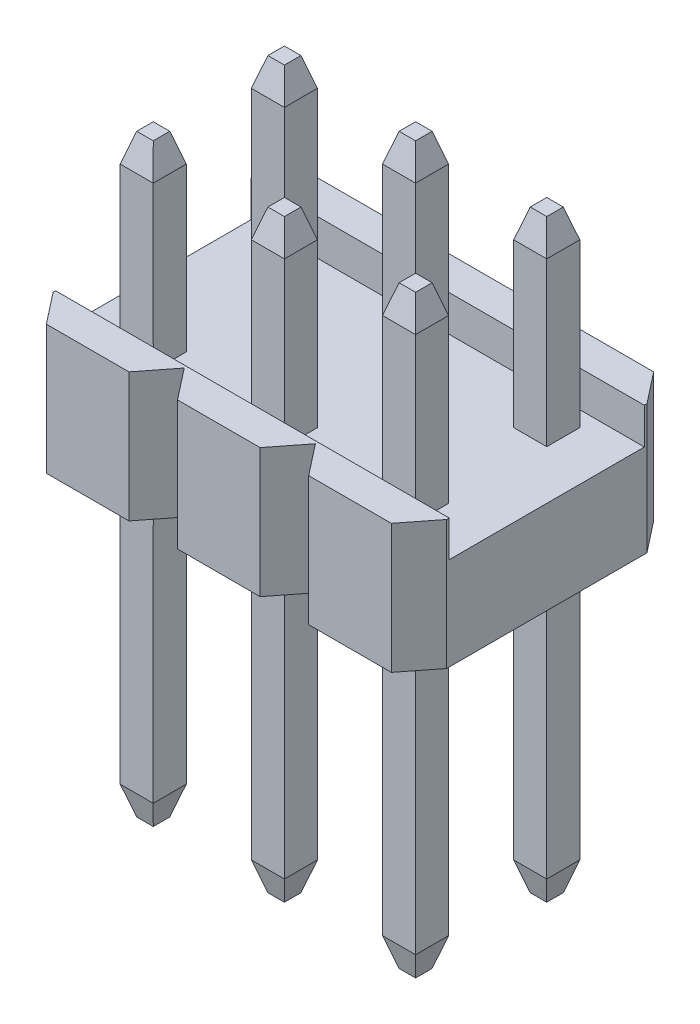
ISO-10303-21;
HEADER;
FILE_DESCRIPTION(('STEP AP214'),'2;1');
FILE_NAME('part.step','',(''),(''),'','','');
FILE_SCHEMA(('AUTOMOTIVE_DESIGN { 1 0 10303 214 1 1 1 1 }'));
ENDSEC;
DATA;
#1=APPLICATION_CONTEXT('core data for automotive mechanical design processes');
#2=APPLICATION_PROTOCOL_DEFINITION('international standard','automotive_design',2000,#1);
#3=PRODUCT_CONTEXT('',#1,'mechanical');
#4=PRODUCT('Part','Part','',(#3));
#5=PRODUCT_RELATED_PRODUCT_CATEGORY('part','',(#4));
#6=PRODUCT_DEFINITION_FORMATION('','',#4);
#7=PRODUCT_DEFINITION_CONTEXT('part definition',#1,'design');
#8=PRODUCT_DEFINITION('design','',#6,#7);
#9=PRODUCT_DEFINITION_SHAPE('','',#8);
#10=(LENGTH_UNIT() NAMED_UNIT(*) SI_UNIT(.MILLI.,.METRE.));
#11=(NAMED_UNIT(*) PLANE_ANGLE_UNIT() SI_UNIT($,.RADIAN.));
#12=(NAMED_UNIT(*) SI_UNIT($,.STERADIAN.) SOLID_ANGLE_UNIT());
#13=UNCERTAINTY_MEASURE_WITH_UNIT(LENGTH_MEASURE(1.E-05),#10,'distance_accuracy_value','');
#14=(GEOMETRIC_REPRESENTATION_CONTEXT(3) GLOBAL_UNCERTAINTY_ASSIGNED_CONTEXT((#13)) GLOBAL_UNIT_ASSIGNED_CONTEXT((#10,
#11,#12)) REPRESENTATION_CONTEXT('',''));
#15=CARTESIAN_POINT('',(0.,0.,0.));
#16=DIRECTION('',(0.,0.,1.));
#17=DIRECTION('',(1.,0.,0.));
#18=AXIS2_PLACEMENT_3D('',#15,#16,#17);
#19=CARTESIAN_POINT('',(2.86,2.45,0.95));
#20=DIRECTION('',(0.,-0.279329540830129,0.960195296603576));
#21=DIRECTION('',(0.,-0.960195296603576,-0.279329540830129));
#22=AXIS2_PLACEMENT_3D('',#19,#20,#21);
#23=PLANE('',#22);
#24=DIRECTION('',(1.,0.,0.));
#25=VECTOR('',#24,1.);
#26=CARTESIAN_POINT('',(2.86,2.45,0.949999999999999));
#27=LINE('',#26,#25);
#28=CARTESIAN_POINT('',(2.85986708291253,2.4499823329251,0.949998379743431));
#29=VERTEX_POINT('',#28);
#30=CARTESIAN_POINT('',(2.22000000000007,2.44999999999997,0.95));
#31=VERTEX_POINT('',#30);
#32=EDGE_CURVE('E576',#29,#31,#27,.F.);
#33=ORIENTED_EDGE('',*,*,#32,.T.);
#34=DIRECTION('',(0.269031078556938,0.924794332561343,0.26903107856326));
#35=VECTOR('',#34,1.);
#36=CARTESIAN_POINT('',(2.22000000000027,2.44999999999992,0.95));
#37=LINE('',#36,#35);
#38=CARTESIAN_POINT('',(2.37999999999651,3.,1.11));
#39=VERTEX_POINT('',#38);
#40=EDGE_CURVE('E578',#31,#39,#37,.T.);
#41=ORIENTED_EDGE('',*,*,#40,.T.);
#42=DIRECTION('',(1.,0.,0.));
#43=VECTOR('',#42,1.);
#44=CARTESIAN_POINT('',(2.86,3.,1.11));
#45=LINE('',#44,#43);
#46=CARTESIAN_POINT('',(2.70000000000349,3.,1.11));
#47=VERTEX_POINT('',#46);
#48=EDGE_CURVE('E1369',#39,#47,#45,.T.);
#49=ORIENTED_EDGE('',*,*,#48,.T.);
#50=CARTESIAN_POINT('',(2.70000000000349,3.,1.11));
#51=DIRECTION('',(0.268600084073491,-0.924909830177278,-0.269064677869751));
#52=VECTOR('',#51,1.);
#53=LINE('',#50,#52);
#54=EDGE_CURVE('E581',#47,#29,#53,.T.);
#55=ORIENTED_EDGE('',*,*,#54,.T.);
#56=EDGE_LOOP('',(#33,#41,#49,#55));
#57=FACE_BOUND('',#56,.T.);
#58=ADVANCED_FACE('F17',(#57),#23,.F.);
#59=CARTESIAN_POINT('',(-2.22,2.45,0.95));
#60=DIRECTION('',(0.,-0.279329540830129,0.960195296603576));
#61=DIRECTION('',(0.,-0.960195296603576,-0.279329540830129));
#62=AXIS2_PLACEMENT_3D('',#59,#60,#61);
#63=PLANE('',#62);
#64=DIRECTION('',(1.,0.,0.));
#65=VECTOR('',#64,1.);
#66=CARTESIAN_POINT('',(-2.22,2.45,0.949999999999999));
#67=LINE('',#66,#65);
#68=CARTESIAN_POINT('',(-2.22013291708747,2.4499823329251,0.949998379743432));
#69=VERTEX_POINT('',#68);
#70=CARTESIAN_POINT('',(-2.85999999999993,2.44999999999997,0.95));
#71=VERTEX_POINT('',#70);
#72=EDGE_CURVE('E1169',#69,#71,#67,.F.);
#73=ORIENTED_EDGE('',*,*,#72,.T.);
#74=DIRECTION('',(0.269031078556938,0.924794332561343,0.26903107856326));
#75=VECTOR('',#74,1.);
#76=CARTESIAN_POINT('',(-2.85999999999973,2.44999999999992,0.95));
#77=LINE('',#76,#75);
#78=CARTESIAN_POINT('',(-2.7000000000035,3.,1.11));
#79=VERTEX_POINT('',#78);
#80=EDGE_CURVE('E1267',#71,#79,#77,.T.);
#81=ORIENTED_EDGE('',*,*,#80,.T.);
#82=DIRECTION('',(1.,0.,0.));
#83=VECTOR('',#82,1.);
#84=CARTESIAN_POINT('',(-2.22,3.,1.11));
#85=LINE('',#84,#83);
#86=CARTESIAN_POINT('',(-2.37999999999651,3.,1.11));
#87=VERTEX_POINT('',#86);
#88=EDGE_CURVE('E1256',#79,#87,#85,.T.);
#89=ORIENTED_EDGE('',*,*,#88,.T.);
#90=CARTESIAN_POINT('',(-2.37999999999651,3.,1.11));
#91=DIRECTION('',(0.268600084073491,-0.924909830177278,-0.269064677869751));
#92=VECTOR('',#91,1.);
#93=LINE('',#90,#92);
#94=EDGE_CURVE('E1255',#87,#69,#93,.T.);
#95=ORIENTED_EDGE('',*,*,#94,.T.);
#96=EDGE_LOOP('',(#73,#81,#89,#95));
#97=FACE_BOUND('',#96,.T.);
#98=ADVANCED_FACE('F1488',(#97),#63,.F.);
#99=CARTESIAN_POINT('',(0.32,2.45,-1.59));
#100=DIRECTION('',(0.,-0.279329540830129,0.960195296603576));
#101=DIRECTION('',(0.,-0.960195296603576,-0.279329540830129));
#102=AXIS2_PLACEMENT_3D('',#99,#100,#101);
#103=PLANE('',#102);
#104=DIRECTION('',(1.,0.,0.));
#105=VECTOR('',#104,1.);
#106=CARTESIAN_POINT('',(0.32,2.45,-1.59));
#107=LINE('',#106,#105);
#108=CARTESIAN_POINT('',(0.319867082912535,2.4499823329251,-1.59000162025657));
#109=VERTEX_POINT('',#108);
#110=CARTESIAN_POINT('',(-0.319999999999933,2.44999999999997,-1.59));
#111=VERTEX_POINT('',#110);
#112=EDGE_CURVE('E1044',#109,#111,#107,.F.);
#113=ORIENTED_EDGE('',*,*,#112,.T.);
#114=DIRECTION('',(0.269031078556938,0.924794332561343,0.26903107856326));
#115=VECTOR('',#114,1.);
#116=CARTESIAN_POINT('',(-0.319999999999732,2.44999999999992,-1.59));
#117=LINE('',#116,#115);
#118=CARTESIAN_POINT('',(-0.160000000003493,3.,-1.43));
#119=VERTEX_POINT('',#118);
#120=EDGE_CURVE('E1144',#111,#119,#117,.T.);
#121=ORIENTED_EDGE('',*,*,#120,.T.);
#122=DIRECTION('',(1.,0.,0.));
#123=VECTOR('',#122,1.);
#124=CARTESIAN_POINT('',(0.32,3.,-1.43));
#125=LINE('',#124,#123);
#126=CARTESIAN_POINT('',(0.160000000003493,3.,-1.43));
#127=VERTEX_POINT('',#126);
#128=EDGE_CURVE('E1133',#119,#127,#125,.T.);
#129=ORIENTED_EDGE('',*,*,#128,.T.);
#130=CARTESIAN_POINT('',(0.160000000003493,3.,-1.43));
#131=DIRECTION('',(0.268600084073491,-0.924909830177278,-0.269064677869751));
#132=VECTOR('',#131,1.);
#133=LINE('',#130,#132);
#134=EDGE_CURVE('E1132',#127,#109,#133,.T.);
#135=ORIENTED_EDGE('',*,*,#134,.T.);
#136=EDGE_LOOP('',(#113,#121,#129,#135));
#137=FACE_BOUND('',#136,.T.);
#138=ADVANCED_FACE('F1480',(#137),#103,.F.);
#139=CARTESIAN_POINT('',(-2.22,2.45,-1.59));
#140=DIRECTION('',(0.,-0.279329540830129,0.960195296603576));
#141=DIRECTION('',(0.,-0.960195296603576,-0.279329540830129));
#142=AXIS2_PLACEMENT_3D('',#139,#140,#141);
#143=PLANE('',#142);
#144=DIRECTION('',(1.,0.,0.));
#145=VECTOR('',#144,1.);
#146=CARTESIAN_POINT('',(-2.22,2.45,-1.59));
#147=LINE('',#146,#145);
#148=CARTESIAN_POINT('',(-2.22013291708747,2.4499823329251,-1.59000162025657));
#149=VERTEX_POINT('',#148);
#150=CARTESIAN_POINT('',(-2.85999999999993,2.44999999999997,-1.59));
#151=VERTEX_POINT('',#150);
#152=EDGE_CURVE('E921',#149,#151,#147,.F.);
#153=ORIENTED_EDGE('',*,*,#152,.T.);
#154=DIRECTION('',(0.269031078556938,0.924794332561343,0.26903107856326));
#155=VECTOR('',#154,1.);
#156=CARTESIAN_POINT('',(-2.85999999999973,2.44999999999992,-1.59));
#157=LINE('',#156,#155);
#158=CARTESIAN_POINT('',(-2.7000000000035,3.,-1.43));
#159=VERTEX_POINT('',#158);
#160=EDGE_CURVE('E1019',#151,#159,#157,.T.);
#161=ORIENTED_EDGE('',*,*,#160,.T.);
#162=DIRECTION('',(1.,0.,0.));
#163=VECTOR('',#162,1.);
#164=CARTESIAN_POINT('',(-2.22,3.,-1.43));
#165=LINE('',#164,#163);
#166=CARTESIAN_POINT('',(-2.37999999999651,3.,-1.43));
#167=VERTEX_POINT('',#166);
#168=EDGE_CURVE('E1008',#159,#167,#165,.T.);
#169=ORIENTED_EDGE('',*,*,#168,.T.);
#170=CARTESIAN_POINT('',(-2.37999999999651,3.,-1.43));
#171=DIRECTION('',(0.268600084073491,-0.924909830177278,-0.269064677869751));
#172=VECTOR('',#171,1.);
#173=LINE('',#170,#172);
#174=EDGE_CURVE('E1007',#167,#149,#173,.T.);
#175=ORIENTED_EDGE('',*,*,#174,.T.);
#176=EDGE_LOOP('',(#153,#161,#169,#175));
#177=FACE_BOUND('',#176,.T.);
#178=ADVANCED_FACE('F1426',(#177),#143,.F.);
#179=CARTESIAN_POINT('',(2.86,2.45,-1.59));
#180=DIRECTION('',(0.,-0.279329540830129,0.960195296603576));
#181=DIRECTION('',(0.,-0.960195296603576,-0.279329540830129));
#182=AXIS2_PLACEMENT_3D('',#179,#180,#181);
#183=PLANE('',#182);
#184=DIRECTION('',(1.,0.,0.));
#185=VECTOR('',#184,1.);
#186=CARTESIAN_POINT('',(2.86,2.45,-1.59));
#187=LINE('',#186,#185);
#188=CARTESIAN_POINT('',(2.85986708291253,2.4499823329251,-1.59000162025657));
#189=VERTEX_POINT('',#188);
#190=CARTESIAN_POINT('',(2.22000000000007,2.44999999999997,-1.59));
#191=VERTEX_POINT('',#190);
#192=EDGE_CURVE('E798',#189,#191,#187,.F.);
#193=ORIENTED_EDGE('',*,*,#192,.T.);
#194=DIRECTION('',(0.269031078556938,0.924794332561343,0.26903107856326));
#195=VECTOR('',#194,1.);
#196=CARTESIAN_POINT('',(2.22000000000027,2.44999999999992,-1.59));
#197=LINE('',#196,#195);
#198=CARTESIAN_POINT('',(2.37999999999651,3.,-1.43));
#199=VERTEX_POINT('',#198);
#200=EDGE_CURVE('E896',#191,#199,#197,.T.);
#201=ORIENTED_EDGE('',*,*,#200,.T.);
#202=DIRECTION('',(1.,0.,0.));
#203=VECTOR('',#202,1.);
#204=CARTESIAN_POINT('',(2.86,3.,-1.43));
#205=LINE('',#204,#203);
#206=CARTESIAN_POINT('',(2.70000000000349,3.,-1.43));
#207=VERTEX_POINT('',#206);
#208=EDGE_CURVE('E885',#199,#207,#205,.T.);
#209=ORIENTED_EDGE('',*,*,#208,.T.);
#210=CARTESIAN_POINT('',(2.70000000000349,3.,-1.43));
#211=DIRECTION('',(0.268600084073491,-0.924909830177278,-0.269064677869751));
#212=VECTOR('',#211,1.);
#213=LINE('',#210,#212);
#214=EDGE_CURVE('E884',#207,#189,#213,.T.);
#215=ORIENTED_EDGE('',*,*,#214,.T.);
#216=EDGE_LOOP('',(#193,#201,#209,#215));
#217=FACE_BOUND('',#216,.T.);
#218=ADVANCED_FACE('F1421',(#217),#183,.F.);
#219=CARTESIAN_POINT('',(0.32,2.45,0.95));
#220=DIRECTION('',(0.,-0.279329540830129,0.960195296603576));
#221=DIRECTION('',(0.,-0.960195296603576,-0.279329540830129));
#222=AXIS2_PLACEMENT_3D('',#219,#220,#221);
#223=PLANE('',#222);
#224=DIRECTION('',(1.,0.,0.));
#225=VECTOR('',#224,1.);
#226=CARTESIAN_POINT('',(0.32,2.45,0.949999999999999));
#227=LINE('',#226,#225);
#228=CARTESIAN_POINT('',(0.319867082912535,2.4499823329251,0.949998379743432));
#229=VERTEX_POINT('',#228);
#230=CARTESIAN_POINT('',(-0.319999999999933,2.44999999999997,0.95));
#231=VERTEX_POINT('',#230);
#232=EDGE_CURVE('E672',#229,#231,#227,.F.);
#233=ORIENTED_EDGE('',*,*,#232,.T.);
#234=DIRECTION('',(0.269031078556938,0.924794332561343,0.26903107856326));
#235=VECTOR('',#234,1.);
#236=CARTESIAN_POINT('',(-0.319999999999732,2.44999999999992,0.95));
#237=LINE('',#236,#235);
#238=CARTESIAN_POINT('',(-0.160000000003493,3.,1.11));
#239=VERTEX_POINT('',#238);
#240=EDGE_CURVE('E773',#231,#239,#237,.T.);
#241=ORIENTED_EDGE('',*,*,#240,.T.);
#242=DIRECTION('',(1.,0.,0.));
#243=VECTOR('',#242,1.);
#244=CARTESIAN_POINT('',(0.32,3.,1.11));
#245=LINE('',#244,#243);
#246=CARTESIAN_POINT('',(0.160000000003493,3.,1.11));
#247=VERTEX_POINT('',#246);
#248=EDGE_CURVE('E762',#239,#247,#245,.T.);
#249=ORIENTED_EDGE('',*,*,#248,.T.);
#250=CARTESIAN_POINT('',(0.160000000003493,3.,1.11));
#251=DIRECTION('',(0.268600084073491,-0.924909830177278,-0.269064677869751));
#252=VECTOR('',#251,1.);
#253=LINE('',#250,#252);
#254=EDGE_CURVE('E761',#247,#229,#253,.T.);
#255=ORIENTED_EDGE('',*,*,#254,.T.);
#256=EDGE_LOOP('',(#233,#241,#249,#255));
#257=FACE_BOUND('',#256,.T.);
#258=ADVANCED_FACE('F1410',(#257),#223,.F.);
#259=CARTESIAN_POINT('',(0.799999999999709,-2.5,2.53999999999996));
#260=DIRECTION('',(0.,0.,-1.));
#261=DIRECTION('',(0.,1.,0.));
#262=AXIS2_PLACEMENT_3D('',#259,#260,#261);
#263=PLANE('',#262);
#264=DIRECTION('',(1.,0.,0.));
#265=VECTOR('',#264,1.);
#266=CARTESIAN_POINT('',(0.799999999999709,-2.5,2.53999999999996));
#267=LINE('',#266,#265);
#268=CARTESIAN_POINT('',(0.799999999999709,-2.5,2.53999999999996));
#269=VERTEX_POINT('',#268);
#270=CARTESIAN_POINT('',(-0.800000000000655,-2.5,2.53999999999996));
#271=VERTEX_POINT('',#270);
#272=EDGE_CURVE('E1400',#269,#271,#267,.F.);
#273=ORIENTED_EDGE('',*,*,#272,.F.);
#274=DIRECTION('',(0.,1.,0.));
#275=VECTOR('',#274,1.);
#276=CARTESIAN_POINT('',(0.799999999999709,-2.5,2.53999999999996));
#277=LINE('',#276,#275);
#278=CARTESIAN_POINT('',(0.799999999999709,0.,2.53999999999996));
#279=VERTEX_POINT('',#278);
#280=EDGE_CURVE('E598',#269,#279,#277,.T.);
#281=ORIENTED_EDGE('',*,*,#280,.T.);
#282=DIRECTION('',(1.,0.,0.));
#283=VECTOR('',#282,1.);
#284=CARTESIAN_POINT('',(0.799999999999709,0.,2.53999999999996));
#285=LINE('',#284,#283);
#286=CARTESIAN_POINT('',(-0.800000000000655,0.,2.53999999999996));
#287=VERTEX_POINT('',#286);
#288=EDGE_CURVE('E1402',#287,#279,#285,.T.);
#289=ORIENTED_EDGE('',*,*,#288,.F.);
#290=DIRECTION('',(0.,1.,0.));
#291=VECTOR('',#290,1.);
#292=CARTESIAN_POINT('',(-0.800000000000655,-2.5,2.53999999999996));
#293=LINE('',#292,#291);
#294=EDGE_CURVE('E657',#287,#271,#293,.F.);
#295=ORIENTED_EDGE('',*,*,#294,.T.);
#296=EDGE_LOOP('',(#273,#281,#289,#295));
#297=FACE_BOUND('',#296,.T.);
#298=ADVANCED_FACE('F1420',(#297),#263,.F.);
#299=CARTESIAN_POINT('',(-0.800000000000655,-2.5,-2.53999999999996));
#300=DIRECTION('',(0.,0.,1.));
#301=DIRECTION('',(0.,-1.,0.));
#302=AXIS2_PLACEMENT_3D('',#299,#300,#301);
#303=PLANE('',#302);
#304=DIRECTION('',(1.,0.,0.));
#305=VECTOR('',#304,1.);
#306=CARTESIAN_POINT('',(-0.800000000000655,-2.5,-2.53999999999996));
#307=LINE('',#306,#305);
#308=CARTESIAN_POINT('',(-0.800000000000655,-2.5,-2.53999999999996));
#309=VERTEX_POINT('',#308);
#310=CARTESIAN_POINT('',(0.799999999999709,-2.5,-2.53999999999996));
#311=VERTEX_POINT('',#310);
#312=EDGE_CURVE('E1396',#309,#311,#307,.T.);
#313=ORIENTED_EDGE('',*,*,#312,.F.);
#314=DIRECTION('',(0.,1.,0.));
#315=VECTOR('',#314,1.);
#316=CARTESIAN_POINT('',(-0.800000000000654,-2.5,-2.53999999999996));
#317=LINE('',#316,#315);
#318=CARTESIAN_POINT('',(-0.800000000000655,0.,-2.53999999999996));
#319=VERTEX_POINT('',#318);
#320=EDGE_CURVE('E632',#309,#319,#317,.T.);
#321=ORIENTED_EDGE('',*,*,#320,.T.);
#322=DIRECTION('',(1.,0.,0.));
#323=VECTOR('',#322,1.);
#324=CARTESIAN_POINT('',(-0.800000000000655,0.,-2.53999999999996));
#325=LINE('',#324,#323);
#326=CARTESIAN_POINT('',(0.79999999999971,0.,-2.53999999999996));
#327=VERTEX_POINT('',#326);
#328=EDGE_CURVE('E1398',#327,#319,#325,.F.);
#329=ORIENTED_EDGE('',*,*,#328,.F.);
#330=DIRECTION('',(0.,1.,0.));
#331=VECTOR('',#330,1.);
#332=CARTESIAN_POINT('',(0.799999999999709,-2.5,-2.53999999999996));
#333=LINE('',#332,#331);
#334=EDGE_CURVE('E1391',#327,#311,#333,.F.);
#335=ORIENTED_EDGE('',*,*,#334,.T.);
#336=EDGE_LOOP('',(#313,#321,#329,#335));
#337=FACE_BOUND('',#336,.T.);
#338=ADVANCED_FACE('F3169',(#337),#303,.F.);
#339=CARTESIAN_POINT('',(0.799999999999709,-2.5,-2.53999999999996));
#340=DIRECTION('',(-0.787228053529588,0.,0.61666197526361));
#341=DIRECTION('',(0.61666197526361,0.,0.787228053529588));
#342=AXIS2_PLACEMENT_3D('',#339,#340,#341);
#343=PLANE('',#342);
#344=DIRECTION('',(0.61666197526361,0.,0.787228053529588));
#345=VECTOR('',#344,1.);
#346=CARTESIAN_POINT('',(0.799999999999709,-2.5,-2.53999999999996));
#347=LINE('',#346,#345);
#348=CARTESIAN_POINT('',(1.26999999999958,-2.5,-1.93999999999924));
#349=VERTEX_POINT('',#348);
#350=EDGE_CURVE('E1389',#311,#349,#347,.T.);
#351=ORIENTED_EDGE('',*,*,#350,.F.);
#352=ORIENTED_EDGE('',*,*,#334,.F.);
#353=DIRECTION('',(0.61666197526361,0.,0.787228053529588));
#354=VECTOR('',#353,1.);
#355=CARTESIAN_POINT('',(0.799999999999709,0.,-2.53999999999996));
#356=LINE('',#355,#354);
#357=CARTESIAN_POINT('',(1.26999999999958,0.,-1.93999999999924));
#358=VERTEX_POINT('',#357);
#359=EDGE_CURVE('E1394',#358,#327,#356,.F.);
#360=ORIENTED_EDGE('',*,*,#359,.F.);
#361=DIRECTION('',(0.,1.,0.));
#362=VECTOR('',#361,1.);
#363=CARTESIAN_POINT('',(1.26999999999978,-2.5,-1.93999999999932));
#364=LINE('',#363,#362);
#365=EDGE_CURVE('E629',#358,#349,#364,.F.);
#366=ORIENTED_EDGE('',*,*,#365,.T.);
#367=EDGE_LOOP('',(#351,#352,#360,#366));
#368=FACE_BOUND('',#367,.T.);
#369=ADVANCED_FACE('F3163',(#368),#343,.F.);
#370=CARTESIAN_POINT('',(1.26999999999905,-2.5,1.9399999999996));
#371=DIRECTION('',(-0.787228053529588,0.,-0.61666197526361));
#372=DIRECTION('',(-0.61666197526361,0.,0.787228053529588));
#373=AXIS2_PLACEMENT_3D('',#370,#371,#372);
#374=PLANE('',#373);
#375=DIRECTION('',(-0.61666197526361,0.,0.787228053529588));
#376=VECTOR('',#375,1.);
#377=CARTESIAN_POINT('',(1.26999999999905,-2.5,1.9399999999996));
#378=LINE('',#377,#376);
#379=CARTESIAN_POINT('',(1.26999999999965,-2.5,1.93999999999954));
#380=VERTEX_POINT('',#379);
#381=EDGE_CURVE('E1385',#380,#269,#378,.T.);
#382=ORIENTED_EDGE('',*,*,#381,.F.);
#383=DIRECTION('',(0.,1.,0.));
#384=VECTOR('',#383,1.);
#385=CARTESIAN_POINT('',(1.26999999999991,-2.5,1.93999999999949));
#386=LINE('',#385,#384);
#387=CARTESIAN_POINT('',(1.26999999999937,0.,1.93999999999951));
#388=VERTEX_POINT('',#387);
#389=EDGE_CURVE('E611',#380,#388,#386,.T.);
#390=ORIENTED_EDGE('',*,*,#389,.T.);
#391=DIRECTION('',(-0.61666197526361,0.,0.787228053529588));
#392=VECTOR('',#391,1.);
#393=CARTESIAN_POINT('',(1.26999999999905,0.,1.9399999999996));
#394=LINE('',#393,#392);
#395=EDGE_CURVE('E1387',#279,#388,#394,.F.);
#396=ORIENTED_EDGE('',*,*,#395,.F.);
#397=ORIENTED_EDGE('',*,*,#280,.F.);
#398=EDGE_LOOP('',(#382,#390,#396,#397));
#399=FACE_BOUND('',#398,.T.);
#400=ADVANCED_FACE('F3161',(#399),#374,.F.);
#401=CARTESIAN_POINT('',(2.37999999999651,3.,2.27));
#402=DIRECTION('',(0.960195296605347,-0.279329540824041,0.));
#403=DIRECTION('',(0.279329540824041,0.960195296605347,0.));
#404=AXIS2_PLACEMENT_3D('',#401,#402,#403);
#405=PLANE('',#404);
#406=DIRECTION('',(0.,0.,1.));
#407=VECTOR('',#406,1.);
#408=CARTESIAN_POINT('',(2.22,2.44999999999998,1.43));
#409=LINE('',#408,#407);
#410=CARTESIAN_POINT('',(2.22000000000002,2.44999999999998,1.59));
#411=VERTEX_POINT('',#410);
#412=EDGE_CURVE('E593',#411,#31,#409,.F.);
#413=ORIENTED_EDGE('',*,*,#412,.F.);
#414=DIRECTION('',(0.269031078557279,0.924794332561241,-0.269031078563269));
#415=VECTOR('',#414,1.);
#416=CARTESIAN_POINT('',(2.22000000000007,2.44999999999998,1.59));
#417=LINE('',#416,#415);
#418=CARTESIAN_POINT('',(2.37999999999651,3.,1.43));
#419=VERTEX_POINT('',#418);
#420=EDGE_CURVE('E623',#411,#419,#417,.T.);
#421=ORIENTED_EDGE('',*,*,#420,.T.);
#422=DIRECTION('',(0.,0.,-1.));
#423=VECTOR('',#422,1.);
#424=CARTESIAN_POINT('',(2.37999999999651,3.,1.11));
#425=LINE('',#424,#423);
#426=EDGE_CURVE('E596',#419,#39,#425,.T.);
#427=ORIENTED_EDGE('',*,*,#426,.T.);
#428=ORIENTED_EDGE('',*,*,#40,.F.);
#429=EDGE_LOOP('',(#413,#421,#427,#428));
#430=FACE_BOUND('',#429,.T.);
#431=ADVANCED_FACE('F591',(#430),#405,.F.);
#432=CARTESIAN_POINT('',(2.86,3.,1.11));
#433=DIRECTION('',(0.,-1.,0.));
#434=DIRECTION('',(0.,0.,-1.));
#435=AXIS2_PLACEMENT_3D('',#432,#433,#434);
#436=PLANE('',#435);
#437=ORIENTED_EDGE('',*,*,#48,.F.);
#438=ORIENTED_EDGE('',*,*,#426,.F.);
#439=DIRECTION('',(1.,0.,0.));
#440=VECTOR('',#439,1.);
#441=CARTESIAN_POINT('',(2.86,3.,1.43));
#442=LINE('',#441,#440);
#443=CARTESIAN_POINT('',(2.70000000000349,3.,1.43));
#444=VERTEX_POINT('',#443);
#445=EDGE_CURVE('E1372',#419,#444,#442,.T.);
#446=ORIENTED_EDGE('',*,*,#445,.T.);
#447=DIRECTION('',(0.,0.,1.));
#448=VECTOR('',#447,1.);
#449=CARTESIAN_POINT('',(2.70000000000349,3.,2.27));
#450=LINE('',#449,#448);
#451=EDGE_CURVE('E1361',#444,#47,#450,.F.);
#452=ORIENTED_EDGE('',*,*,#451,.T.);
#453=EDGE_LOOP('',(#437,#438,#446,#452));
#454=FACE_BOUND('',#453,.T.);
#455=ADVANCED_FACE('F1338',(#454),#436,.F.);
#456=CARTESIAN_POINT('',(2.8597228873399,2.45,2.27));
#457=DIRECTION('',(-0.960324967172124,-0.278883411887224,0.));
#458=DIRECTION('',(0.278883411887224,-0.960324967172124,0.));
#459=AXIS2_PLACEMENT_3D('',#456,#457,#458);
#460=PLANE('',#459);
#461=ORIENTED_EDGE('',*,*,#451,.F.);
#462=CARTESIAN_POINT('',(2.70000000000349,3.,1.43));
#463=DIRECTION('',(0.268600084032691,-0.924914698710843,0.269047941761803));
#464=VECTOR('',#463,1.);
#465=LINE('',#462,#464);
#466=CARTESIAN_POINT('',(2.85986762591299,2.44998267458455,1.59));
#467=VERTEX_POINT('',#466);
#468=EDGE_CURVE('E1357',#444,#467,#465,.T.);
#469=ORIENTED_EDGE('',*,*,#468,.T.);
#470=CARTESIAN_POINT('',(2.85973366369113,2.44996289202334,1.59));
#471=DIRECTION('',(0.,0.,-1.));
#472=VECTOR('',#471,1.);
#473=LINE('',#470,#472);
#474=EDGE_CURVE('E1322',#467,#29,#473,.T.);
#475=ORIENTED_EDGE('',*,*,#474,.T.);
#476=ORIENTED_EDGE('',*,*,#54,.F.);
#477=EDGE_LOOP('',(#461,#469,#475,#476));
#478=FACE_BOUND('',#477,.T.);
#479=ADVANCED_FACE('F1328',(#478),#460,.F.);
#480=CARTESIAN_POINT('',(2.86,-7.95,0.95));
#481=DIRECTION('',(0.,0.,1.));
#482=DIRECTION('',(0.,-1.,0.));
#483=AXIS2_PLACEMENT_3D('',#480,#481,#482);
#484=PLANE('',#483);
#485=DIRECTION('',(0.,-1.,0.));
#486=VECTOR('',#485,1.);
#487=CARTESIAN_POINT('',(2.22,3.,0.95));
#488=LINE('',#487,#486);
#489=CARTESIAN_POINT('',(2.22,-0.7,0.95));
#490=VERTEX_POINT('',#489);
#491=EDGE_CURVE('E601',#31,#490,#488,.T.);
#492=ORIENTED_EDGE('',*,*,#491,.F.);
#493=ORIENTED_EDGE('',*,*,#32,.F.);
#494=CARTESIAN_POINT('',(2.86,2.45,0.949999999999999));
#495=DIRECTION('',(0.,-1.,0.));
#496=VECTOR('',#495,1.);
#497=LINE('',#494,#496);
#498=CARTESIAN_POINT('',(2.86,-0.7,0.95));
#499=VERTEX_POINT('',#498);
#500=EDGE_CURVE('E1284',#29,#499,#497,.T.);
#501=ORIENTED_EDGE('',*,*,#500,.T.);
#502=DIRECTION('',(1.,0.,0.));
#503=VECTOR('',#502,1.);
#504=CARTESIAN_POINT('',(2.86,-0.7,0.95));
#505=LINE('',#504,#503);
#506=EDGE_CURVE('E588',#490,#499,#505,.T.);
#507=ORIENTED_EDGE('',*,*,#506,.F.);
#508=EDGE_LOOP('',(#492,#493,#501,#507));
#509=FACE_BOUND('',#508,.T.);
#510=ADVANCED_FACE('F602',(#509),#484,.F.);
#511=CARTESIAN_POINT('',(-2.7000000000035,3.,2.27));
#512=DIRECTION('',(0.960195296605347,-0.279329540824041,0.));
#513=DIRECTION('',(0.279329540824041,0.960195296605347,0.));
#514=AXIS2_PLACEMENT_3D('',#511,#512,#513);
#515=PLANE('',#514);
#516=DIRECTION('',(0.,0.,1.));
#517=VECTOR('',#516,1.);
#518=CARTESIAN_POINT('',(-2.86,2.44999999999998,1.43));
#519=LINE('',#518,#517);
#520=CARTESIAN_POINT('',(-2.85999999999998,2.44999999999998,1.59));
#521=VERTEX_POINT('',#520);
#522=EDGE_CURVE('E1274',#521,#71,#519,.F.);
#523=ORIENTED_EDGE('',*,*,#522,.F.);
#524=DIRECTION('',(0.269031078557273,0.924794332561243,-0.269031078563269));
#525=VECTOR('',#524,1.);
#526=CARTESIAN_POINT('',(-2.85999999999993,2.44999999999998,1.59));
#527=LINE('',#526,#525);
#528=CARTESIAN_POINT('',(-2.7000000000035,3.,1.43));
#529=VERTEX_POINT('',#528);
#530=EDGE_CURVE('E1261',#521,#529,#527,.T.);
#531=ORIENTED_EDGE('',*,*,#530,.T.);
#532=DIRECTION('',(0.,0.,-1.));
#533=VECTOR('',#532,1.);
#534=CARTESIAN_POINT('',(-2.7000000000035,3.,1.11));
#535=LINE('',#534,#533);
#536=EDGE_CURVE('E1264',#529,#79,#535,.T.);
#537=ORIENTED_EDGE('',*,*,#536,.T.);
#538=ORIENTED_EDGE('',*,*,#80,.F.);
#539=EDGE_LOOP('',(#523,#531,#537,#538));
#540=FACE_BOUND('',#539,.T.);
#541=ADVANCED_FACE('F3686',(#540),#515,.F.);
#542=CARTESIAN_POINT('',(-2.22,3.,1.11));
#543=DIRECTION('',(0.,-1.,0.));
#544=DIRECTION('',(0.,0.,-1.));
#545=AXIS2_PLACEMENT_3D('',#542,#543,#544);
#546=PLANE('',#545);
#547=ORIENTED_EDGE('',*,*,#88,.F.);
#548=ORIENTED_EDGE('',*,*,#536,.F.);
#549=DIRECTION('',(1.,0.,0.));
#550=VECTOR('',#549,1.);
#551=CARTESIAN_POINT('',(-2.22,3.,1.43));
#552=LINE('',#551,#550);
#553=CARTESIAN_POINT('',(-2.37999999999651,3.,1.43));
#554=VERTEX_POINT('',#553);
#555=EDGE_CURVE('E1259',#529,#554,#552,.T.);
#556=ORIENTED_EDGE('',*,*,#555,.T.);
#557=DIRECTION('',(0.,0.,1.));
#558=VECTOR('',#557,1.);
#559=CARTESIAN_POINT('',(-2.37999999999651,3.,2.27));
#560=LINE('',#559,#558);
#561=EDGE_CURVE('E1247',#554,#87,#560,.F.);
#562=ORIENTED_EDGE('',*,*,#561,.T.);
#563=EDGE_LOOP('',(#547,#548,#556,#562));
#564=FACE_BOUND('',#563,.T.);
#565=ADVANCED_FACE('F1224',(#564),#546,.F.);
#566=CARTESIAN_POINT('',(-2.2202771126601,2.45,2.27));
#567=DIRECTION('',(-0.960324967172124,-0.278883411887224,0.));
#568=DIRECTION('',(0.278883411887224,-0.960324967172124,0.));
#569=AXIS2_PLACEMENT_3D('',#566,#567,#568);
#570=PLANE('',#569);
#571=ORIENTED_EDGE('',*,*,#561,.F.);
#572=CARTESIAN_POINT('',(-2.37999999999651,3.,1.43));
#573=DIRECTION('',(0.268600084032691,-0.924914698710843,0.269047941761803));
#574=VECTOR('',#573,1.);
#575=LINE('',#572,#574);
#576=CARTESIAN_POINT('',(-2.22013237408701,2.44998267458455,1.59));
#577=VERTEX_POINT('',#576);
#578=EDGE_CURVE('E1243',#554,#577,#575,.T.);
#579=ORIENTED_EDGE('',*,*,#578,.T.);
#580=CARTESIAN_POINT('',(-2.22026633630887,2.44996289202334,1.59));
#581=DIRECTION('',(0.,0.,-1.));
#582=VECTOR('',#581,1.);
#583=LINE('',#580,#582);
#584=EDGE_CURVE('E1206',#577,#69,#583,.T.);
#585=ORIENTED_EDGE('',*,*,#584,.T.);
#586=ORIENTED_EDGE('',*,*,#94,.F.);
#587=EDGE_LOOP('',(#571,#579,#585,#586));
#588=FACE_BOUND('',#587,.T.);
#589=ADVANCED_FACE('F1213',(#588),#570,.F.);
#590=CARTESIAN_POINT('',(-2.22,-7.95,0.95));
#591=DIRECTION('',(0.,0.,1.));
#592=DIRECTION('',(0.,-1.,0.));
#593=AXIS2_PLACEMENT_3D('',#590,#591,#592);
#594=PLANE('',#593);
#595=DIRECTION('',(0.,-1.,0.));
#596=VECTOR('',#595,1.);
#597=CARTESIAN_POINT('',(-2.86,3.,0.95));
#598=LINE('',#597,#596);
#599=CARTESIAN_POINT('',(-2.86,-0.7,0.95));
#600=VERTEX_POINT('',#599);
#601=EDGE_CURVE('E1270',#71,#600,#598,.T.);
#602=ORIENTED_EDGE('',*,*,#601,.F.);
#603=ORIENTED_EDGE('',*,*,#72,.F.);
#604=CARTESIAN_POINT('',(-2.22,2.45,0.949999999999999));
#605=DIRECTION('',(0.,-1.,0.));
#606=VECTOR('',#605,1.);
#607=LINE('',#604,#606);
#608=CARTESIAN_POINT('',(-2.22,-0.7,0.95));
#609=VERTEX_POINT('',#608);
#610=EDGE_CURVE('E1164',#69,#609,#607,.T.);
#611=ORIENTED_EDGE('',*,*,#610,.T.);
#612=DIRECTION('',(1.,0.,0.));
#613=VECTOR('',#612,1.);
#614=CARTESIAN_POINT('',(-2.22,-0.7,0.95));
#615=LINE('',#614,#613);
#616=EDGE_CURVE('E1155',#600,#609,#615,.T.);
#617=ORIENTED_EDGE('',*,*,#616,.F.);
#618=EDGE_LOOP('',(#602,#603,#611,#617));
#619=FACE_BOUND('',#618,.T.);
#620=ADVANCED_FACE('F1223',(#619),#594,.F.);
#621=CARTESIAN_POINT('',(-0.160000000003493,3.,-0.27));
#622=DIRECTION('',(0.960195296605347,-0.279329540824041,0.));
#623=DIRECTION('',(0.279329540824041,0.960195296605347,0.));
#624=AXIS2_PLACEMENT_3D('',#621,#622,#623);
#625=PLANE('',#624);
#626=DIRECTION('',(0.,0.,1.));
#627=VECTOR('',#626,1.);
#628=CARTESIAN_POINT('',(-0.32,2.44999999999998,-1.11));
#629=LINE('',#628,#627);
#630=CARTESIAN_POINT('',(-0.319999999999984,2.44999999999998,-0.949999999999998));
#631=VERTEX_POINT('',#630);
#632=EDGE_CURVE('E1151',#631,#111,#629,.F.);
#633=ORIENTED_EDGE('',*,*,#632,.F.);
#634=DIRECTION('',(0.269031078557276,0.924794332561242,-0.269031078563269));
#635=VECTOR('',#634,1.);
#636=CARTESIAN_POINT('',(-0.319999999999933,2.44999999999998,-0.949999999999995));
#637=LINE('',#636,#635);
#638=CARTESIAN_POINT('',(-0.160000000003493,3.,-1.11));
#639=VERTEX_POINT('',#638);
#640=EDGE_CURVE('E1138',#631,#639,#637,.T.);
#641=ORIENTED_EDGE('',*,*,#640,.T.);
#642=DIRECTION('',(0.,0.,-1.));
#643=VECTOR('',#642,1.);
#644=CARTESIAN_POINT('',(-0.160000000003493,3.,-1.43));
#645=LINE('',#644,#643);
#646=EDGE_CURVE('E1141',#639,#119,#645,.T.);
#647=ORIENTED_EDGE('',*,*,#646,.T.);
#648=ORIENTED_EDGE('',*,*,#120,.F.);
#649=EDGE_LOOP('',(#633,#641,#647,#648));
#650=FACE_BOUND('',#649,.T.);
#651=ADVANCED_FACE('F3655',(#650),#625,.F.);
#652=CARTESIAN_POINT('',(0.32,3.,-1.43));
#653=DIRECTION('',(0.,-1.,0.));
#654=DIRECTION('',(0.,0.,-1.));
#655=AXIS2_PLACEMENT_3D('',#652,#653,#654);
#656=PLANE('',#655);
#657=ORIENTED_EDGE('',*,*,#128,.F.);
#658=ORIENTED_EDGE('',*,*,#646,.F.);
#659=DIRECTION('',(1.,0.,0.));
#660=VECTOR('',#659,1.);
#661=CARTESIAN_POINT('',(0.32,3.,-1.11));
#662=LINE('',#661,#660);
#663=CARTESIAN_POINT('',(0.160000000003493,3.,-1.11));
#664=VERTEX_POINT('',#663);
#665=EDGE_CURVE('E1136',#639,#664,#662,.T.);
#666=ORIENTED_EDGE('',*,*,#665,.T.);
#667=DIRECTION('',(0.,0.,1.));
#668=VECTOR('',#667,1.);
#669=CARTESIAN_POINT('',(0.160000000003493,3.,-0.27));
#670=LINE('',#669,#668);
#671=EDGE_CURVE('E1124',#664,#127,#670,.F.);
#672=ORIENTED_EDGE('',*,*,#671,.T.);
#673=EDGE_LOOP('',(#657,#658,#666,#672));
#674=FACE_BOUND('',#673,.T.);
#675=ADVANCED_FACE('F1101',(#674),#656,.F.);
#676=CARTESIAN_POINT('',(0.319722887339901,2.45,-0.27));
#677=DIRECTION('',(-0.960324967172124,-0.278883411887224,0.));
#678=DIRECTION('',(0.278883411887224,-0.960324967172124,0.));
#679=AXIS2_PLACEMENT_3D('',#676,#677,#678);
#680=PLANE('',#679);
#681=ORIENTED_EDGE('',*,*,#671,.F.);
#682=CARTESIAN_POINT('',(0.160000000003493,3.,-1.11));
#683=DIRECTION('',(0.268600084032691,-0.924914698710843,0.269047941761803));
#684=VECTOR('',#683,1.);
#685=LINE('',#682,#684);
#686=CARTESIAN_POINT('',(0.319867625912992,2.44998267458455,-0.95));
#687=VERTEX_POINT('',#686);
#688=EDGE_CURVE('E1120',#664,#687,#685,.T.);
#689=ORIENTED_EDGE('',*,*,#688,.T.);
#690=CARTESIAN_POINT('',(0.319733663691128,2.44996289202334,-0.95));
#691=DIRECTION('',(0.,0.,-1.));
#692=VECTOR('',#691,1.);
#693=LINE('',#690,#692);
#694=EDGE_CURVE('E1083',#687,#109,#693,.T.);
#695=ORIENTED_EDGE('',*,*,#694,.T.);
#696=ORIENTED_EDGE('',*,*,#134,.F.);
#697=EDGE_LOOP('',(#681,#689,#695,#696));
#698=FACE_BOUND('',#697,.T.);
#699=ADVANCED_FACE('F1090',(#698),#680,.F.);
#700=CARTESIAN_POINT('',(0.32,-7.95,-1.59));
#701=DIRECTION('',(0.,0.,1.));
#702=DIRECTION('',(0.,-1.,0.));
#703=AXIS2_PLACEMENT_3D('',#700,#701,#702);
#704=PLANE('',#703);
#705=DIRECTION('',(0.,-1.,0.));
#706=VECTOR('',#705,1.);
#707=CARTESIAN_POINT('',(-0.32,3.,-1.59));
#708=LINE('',#707,#706);
#709=CARTESIAN_POINT('',(-0.32,-0.7,-1.59));
#710=VERTEX_POINT('',#709);
#711=EDGE_CURVE('E1147',#111,#710,#708,.T.);
#712=ORIENTED_EDGE('',*,*,#711,.F.);
#713=ORIENTED_EDGE('',*,*,#112,.F.);
#714=CARTESIAN_POINT('',(0.32,2.45,-1.59));
#715=DIRECTION('',(0.,-1.,0.));
#716=VECTOR('',#715,1.);
#717=LINE('',#714,#716);
#718=CARTESIAN_POINT('',(0.32,-0.7,-1.59));
#719=VERTEX_POINT('',#718);
#720=EDGE_CURVE('E1039',#109,#719,#717,.T.);
#721=ORIENTED_EDGE('',*,*,#720,.T.);
#722=DIRECTION('',(1.,0.,0.));
#723=VECTOR('',#722,1.);
#724=CARTESIAN_POINT('',(0.32,-0.7,-1.59));
#725=LINE('',#724,#723);
#726=EDGE_CURVE('E1030',#710,#719,#725,.T.);
#727=ORIENTED_EDGE('',*,*,#726,.F.);
#728=EDGE_LOOP('',(#712,#713,#721,#727));
#729=FACE_BOUND('',#728,.T.);
#730=ADVANCED_FACE('F1100',(#729),#704,.F.);
#731=CARTESIAN_POINT('',(-2.7000000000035,3.,-0.27));
#732=DIRECTION('',(0.960195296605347,-0.279329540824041,0.));
#733=DIRECTION('',(0.279329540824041,0.960195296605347,0.));
#734=AXIS2_PLACEMENT_3D('',#731,#732,#733);
#735=PLANE('',#734);
#736=DIRECTION('',(0.,0.,1.));
#737=VECTOR('',#736,1.);
#738=CARTESIAN_POINT('',(-2.86,2.44999999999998,-1.11));
#739=LINE('',#738,#737);
#740=CARTESIAN_POINT('',(-2.85999999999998,2.44999999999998,-0.949999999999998));
#741=VERTEX_POINT('',#740);
#742=EDGE_CURVE('E1026',#741,#151,#739,.F.);
#743=ORIENTED_EDGE('',*,*,#742,.F.);
#744=DIRECTION('',(0.269031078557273,0.924794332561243,-0.269031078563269));
#745=VECTOR('',#744,1.);
#746=CARTESIAN_POINT('',(-2.85999999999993,2.44999999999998,-0.949999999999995));
#747=LINE('',#746,#745);
#748=CARTESIAN_POINT('',(-2.7000000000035,3.,-1.11));
#749=VERTEX_POINT('',#748);
#750=EDGE_CURVE('E1013',#741,#749,#747,.T.);
#751=ORIENTED_EDGE('',*,*,#750,.T.);
#752=DIRECTION('',(0.,0.,-1.));
#753=VECTOR('',#752,1.);
#754=CARTESIAN_POINT('',(-2.7000000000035,3.,-1.43));
#755=LINE('',#754,#753);
#756=EDGE_CURVE('E1016',#749,#159,#755,.T.);
#757=ORIENTED_EDGE('',*,*,#756,.T.);
#758=ORIENTED_EDGE('',*,*,#160,.F.);
#759=EDGE_LOOP('',(#743,#751,#757,#758));
#760=FACE_BOUND('',#759,.T.);
#761=ADVANCED_FACE('F3624',(#760),#735,.F.);
#762=CARTESIAN_POINT('',(-2.22,3.,-1.43));
#763=DIRECTION('',(0.,-1.,0.));
#764=DIRECTION('',(0.,0.,-1.));
#765=AXIS2_PLACEMENT_3D('',#762,#763,#764);
#766=PLANE('',#765);
#767=ORIENTED_EDGE('',*,*,#168,.F.);
#768=ORIENTED_EDGE('',*,*,#756,.F.);
#769=DIRECTION('',(1.,0.,0.));
#770=VECTOR('',#769,1.);
#771=CARTESIAN_POINT('',(-2.22,3.,-1.11));
#772=LINE('',#771,#770);
#773=CARTESIAN_POINT('',(-2.37999999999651,3.,-1.11));
#774=VERTEX_POINT('',#773);
#775=EDGE_CURVE('E1011',#749,#774,#772,.T.);
#776=ORIENTED_EDGE('',*,*,#775,.T.);
#777=DIRECTION('',(0.,0.,1.));
#778=VECTOR('',#777,1.);
#779=CARTESIAN_POINT('',(-2.37999999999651,3.,-0.27));
#780=LINE('',#779,#778);
#781=EDGE_CURVE('E999',#774,#167,#780,.F.);
#782=ORIENTED_EDGE('',*,*,#781,.T.);
#783=EDGE_LOOP('',(#767,#768,#776,#782));
#784=FACE_BOUND('',#783,.T.);
#785=ADVANCED_FACE('F976',(#784),#766,.F.);
#786=CARTESIAN_POINT('',(-2.2202771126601,2.45,-0.27));
#787=DIRECTION('',(-0.960324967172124,-0.278883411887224,0.));
#788=DIRECTION('',(0.278883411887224,-0.960324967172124,0.));
#789=AXIS2_PLACEMENT_3D('',#786,#787,#788);
#790=PLANE('',#789);
#791=ORIENTED_EDGE('',*,*,#781,.F.);
#792=CARTESIAN_POINT('',(-2.37999999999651,3.,-1.11));
#793=DIRECTION('',(0.268600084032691,-0.924914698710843,0.269047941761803));
#794=VECTOR('',#793,1.);
#795=LINE('',#792,#794);
#796=CARTESIAN_POINT('',(-2.22013237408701,2.44998267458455,-0.95));
#797=VERTEX_POINT('',#796);
#798=EDGE_CURVE('E995',#774,#797,#795,.T.);
#799=ORIENTED_EDGE('',*,*,#798,.T.);
#800=CARTESIAN_POINT('',(-2.22026633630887,2.44996289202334,-0.95));
#801=DIRECTION('',(0.,0.,-1.));
#802=VECTOR('',#801,1.);
#803=LINE('',#800,#802);
#804=EDGE_CURVE('E958',#797,#149,#803,.T.);
#805=ORIENTED_EDGE('',*,*,#804,.T.);
#806=ORIENTED_EDGE('',*,*,#174,.F.);
#807=EDGE_LOOP('',(#791,#799,#805,#806));
#808=FACE_BOUND('',#807,.T.);
#809=ADVANCED_FACE('F965',(#808),#790,.F.);
#810=CARTESIAN_POINT('',(-2.22,-7.95,-1.59));
#811=DIRECTION('',(0.,0.,1.));
#812=DIRECTION('',(0.,-1.,0.));
#813=AXIS2_PLACEMENT_3D('',#810,#811,#812);
#814=PLANE('',#813);
#815=DIRECTION('',(0.,-1.,0.));
#816=VECTOR('',#815,1.);
#817=CARTESIAN_POINT('',(-2.86,3.,-1.59));
#818=LINE('',#817,#816);
#819=CARTESIAN_POINT('',(-2.86,-0.7,-1.59));
#820=VERTEX_POINT('',#819);
#821=EDGE_CURVE('E1022',#151,#820,#818,.T.);
#822=ORIENTED_EDGE('',*,*,#821,.F.);
#823=ORIENTED_EDGE('',*,*,#152,.F.);
#824=CARTESIAN_POINT('',(-2.22,2.45,-1.59));
#825=DIRECTION('',(0.,-1.,0.));
#826=VECTOR('',#825,1.);
#827=LINE('',#824,#826);
#828=CARTESIAN_POINT('',(-2.22,-0.7,-1.59));
#829=VERTEX_POINT('',#828);
#830=EDGE_CURVE('E916',#149,#829,#827,.T.);
#831=ORIENTED_EDGE('',*,*,#830,.T.);
#832=DIRECTION('',(1.,0.,0.));
#833=VECTOR('',#832,1.);
#834=CARTESIAN_POINT('',(-2.22,-0.7,-1.59));
#835=LINE('',#834,#833);
#836=EDGE_CURVE('E907',#820,#829,#835,.T.);
#837=ORIENTED_EDGE('',*,*,#836,.F.);
#838=EDGE_LOOP('',(#822,#823,#831,#837));
#839=FACE_BOUND('',#838,.T.);
#840=ADVANCED_FACE('F975',(#839),#814,.F.);
#841=CARTESIAN_POINT('',(2.37999999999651,3.,-0.27));
#842=DIRECTION('',(0.960195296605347,-0.279329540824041,0.));
#843=DIRECTION('',(0.279329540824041,0.960195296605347,0.));
#844=AXIS2_PLACEMENT_3D('',#841,#842,#843);
#845=PLANE('',#844);
#846=DIRECTION('',(0.,0.,1.));
#847=VECTOR('',#846,1.);
#848=CARTESIAN_POINT('',(2.22,2.44999999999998,-1.11));
#849=LINE('',#848,#847);
#850=CARTESIAN_POINT('',(2.22000000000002,2.44999999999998,-0.949999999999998));
#851=VERTEX_POINT('',#850);
#852=EDGE_CURVE('E903',#851,#191,#849,.F.);
#853=ORIENTED_EDGE('',*,*,#852,.F.);
#854=DIRECTION('',(0.269031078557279,0.924794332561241,-0.269031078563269));
#855=VECTOR('',#854,1.);
#856=CARTESIAN_POINT('',(2.22000000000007,2.44999999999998,-0.949999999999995));
#857=LINE('',#856,#855);
#858=CARTESIAN_POINT('',(2.37999999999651,3.,-1.11));
#859=VERTEX_POINT('',#858);
#860=EDGE_CURVE('E890',#851,#859,#857,.T.);
#861=ORIENTED_EDGE('',*,*,#860,.T.);
#862=DIRECTION('',(0.,0.,-1.));
#863=VECTOR('',#862,1.);
#864=CARTESIAN_POINT('',(2.37999999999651,3.,-1.43));
#865=LINE('',#864,#863);
#866=EDGE_CURVE('E893',#859,#199,#865,.T.);
#867=ORIENTED_EDGE('',*,*,#866,.T.);
#868=ORIENTED_EDGE('',*,*,#200,.F.);
#869=EDGE_LOOP('',(#853,#861,#867,#868));
#870=FACE_BOUND('',#869,.T.);
#871=ADVANCED_FACE('F3593',(#870),#845,.F.);
#872=CARTESIAN_POINT('',(2.86,3.,-1.43));
#873=DIRECTION('',(0.,-1.,0.));
#874=DIRECTION('',(0.,0.,-1.));
#875=AXIS2_PLACEMENT_3D('',#872,#873,#874);
#876=PLANE('',#875);
#877=ORIENTED_EDGE('',*,*,#208,.F.);
#878=ORIENTED_EDGE('',*,*,#866,.F.);
#879=DIRECTION('',(1.,0.,0.));
#880=VECTOR('',#879,1.);
#881=CARTESIAN_POINT('',(2.86,3.,-1.11));
#882=LINE('',#881,#880);
#883=CARTESIAN_POINT('',(2.70000000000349,3.,-1.11));
#884=VERTEX_POINT('',#883);
#885=EDGE_CURVE('E888',#859,#884,#882,.T.);
#886=ORIENTED_EDGE('',*,*,#885,.T.);
#887=DIRECTION('',(0.,0.,1.));
#888=VECTOR('',#887,1.);
#889=CARTESIAN_POINT('',(2.70000000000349,3.,-0.27));
#890=LINE('',#889,#888);
#891=EDGE_CURVE('E876',#884,#207,#890,.F.);
#892=ORIENTED_EDGE('',*,*,#891,.T.);
#893=EDGE_LOOP('',(#877,#878,#886,#892));
#894=FACE_BOUND('',#893,.T.);
#895=ADVANCED_FACE('F853',(#894),#876,.F.);
#896=CARTESIAN_POINT('',(2.8597228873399,2.45,-0.27));
#897=DIRECTION('',(-0.960324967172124,-0.278883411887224,0.));
#898=DIRECTION('',(0.278883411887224,-0.960324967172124,0.));
#899=AXIS2_PLACEMENT_3D('',#896,#897,#898);
#900=PLANE('',#899);
#901=ORIENTED_EDGE('',*,*,#891,.F.);
#902=CARTESIAN_POINT('',(2.70000000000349,3.,-1.11));
#903=DIRECTION('',(0.268600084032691,-0.924914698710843,0.269047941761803));
#904=VECTOR('',#903,1.);
#905=LINE('',#902,#904);
#906=CARTESIAN_POINT('',(2.85986762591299,2.44998267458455,-0.95));
#907=VERTEX_POINT('',#906);
#908=EDGE_CURVE('E872',#884,#907,#905,.T.);
#909=ORIENTED_EDGE('',*,*,#908,.T.);
#910=CARTESIAN_POINT('',(2.85973366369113,2.44996289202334,-0.95));
#911=DIRECTION('',(0.,0.,-1.));
#912=VECTOR('',#911,1.);
#913=LINE('',#910,#912);
#914=EDGE_CURVE('E835',#907,#189,#913,.T.);
#915=ORIENTED_EDGE('',*,*,#914,.T.);
#916=ORIENTED_EDGE('',*,*,#214,.F.);
#917=EDGE_LOOP('',(#901,#909,#915,#916));
#918=FACE_BOUND('',#917,.T.);
#919=ADVANCED_FACE('F842',(#918),#900,.F.);
#920=CARTESIAN_POINT('',(2.86,-7.95,-1.59));
#921=DIRECTION('',(0.,0.,1.));
#922=DIRECTION('',(0.,-1.,0.));
#923=AXIS2_PLACEMENT_3D('',#920,#921,#922);
#924=PLANE('',#923);
#925=DIRECTION('',(0.,-1.,0.));
#926=VECTOR('',#925,1.);
#927=CARTESIAN_POINT('',(2.22,3.,-1.59));
#928=LINE('',#927,#926);
#929=CARTESIAN_POINT('',(2.22,-0.7,-1.59));
#930=VERTEX_POINT('',#929);
#931=EDGE_CURVE('E899',#191,#930,#928,.T.);
#932=ORIENTED_EDGE('',*,*,#931,.F.);
#933=ORIENTED_EDGE('',*,*,#192,.F.);
#934=CARTESIAN_POINT('',(2.86,2.45,-1.59));
#935=DIRECTION('',(0.,-1.,0.));
#936=VECTOR('',#935,1.);
#937=LINE('',#934,#936);
#938=CARTESIAN_POINT('',(2.86,-0.7,-1.59));
#939=VERTEX_POINT('',#938);
#940=EDGE_CURVE('E793',#189,#939,#937,.T.);
#941=ORIENTED_EDGE('',*,*,#940,.T.);
#942=DIRECTION('',(1.,0.,0.));
#943=VECTOR('',#942,1.);
#944=CARTESIAN_POINT('',(2.86,-0.7,-1.59));
#945=LINE('',#944,#943);
#946=EDGE_CURVE('E784',#930,#939,#945,.T.);
#947=ORIENTED_EDGE('',*,*,#946,.F.);
#948=EDGE_LOOP('',(#932,#933,#941,#947));
#949=FACE_BOUND('',#948,.T.);
#950=ADVANCED_FACE('F852',(#949),#924,.F.);
#951=CARTESIAN_POINT('',(-0.160000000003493,3.,2.27));
#952=DIRECTION('',(0.960195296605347,-0.279329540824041,0.));
#953=DIRECTION('',(0.279329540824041,0.960195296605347,0.));
#954=AXIS2_PLACEMENT_3D('',#951,#952,#953);
#955=PLANE('',#954);
#956=DIRECTION('',(0.,0.,1.));
#957=VECTOR('',#956,1.);
#958=CARTESIAN_POINT('',(-0.32,2.44999999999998,1.43));
#959=LINE('',#958,#957);
#960=CARTESIAN_POINT('',(-0.319999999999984,2.44999999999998,1.59));
#961=VERTEX_POINT('',#960);
#962=EDGE_CURVE('E780',#961,#231,#959,.F.);
#963=ORIENTED_EDGE('',*,*,#962,.F.);
#964=DIRECTION('',(0.269031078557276,0.924794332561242,-0.269031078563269));
#965=VECTOR('',#964,1.);
#966=CARTESIAN_POINT('',(-0.319999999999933,2.44999999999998,1.59));
#967=LINE('',#966,#965);
#968=CARTESIAN_POINT('',(-0.160000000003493,3.,1.43));
#969=VERTEX_POINT('',#968);
#970=EDGE_CURVE('E767',#961,#969,#967,.T.);
#971=ORIENTED_EDGE('',*,*,#970,.T.);
#972=DIRECTION('',(0.,0.,-1.));
#973=VECTOR('',#972,1.);
#974=CARTESIAN_POINT('',(-0.160000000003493,3.,1.11));
#975=LINE('',#974,#973);
#976=EDGE_CURVE('E770',#969,#239,#975,.T.);
#977=ORIENTED_EDGE('',*,*,#976,.T.);
#978=ORIENTED_EDGE('',*,*,#240,.F.);
#979=EDGE_LOOP('',(#963,#971,#977,#978));
#980=FACE_BOUND('',#979,.T.);
#981=ADVANCED_FACE('F3562',(#980),#955,.F.);
#982=CARTESIAN_POINT('',(0.32,3.,1.11));
#983=DIRECTION('',(0.,-1.,0.));
#984=DIRECTION('',(0.,0.,-1.));
#985=AXIS2_PLACEMENT_3D('',#982,#983,#984);
#986=PLANE('',#985);
#987=ORIENTED_EDGE('',*,*,#248,.F.);
#988=ORIENTED_EDGE('',*,*,#976,.F.);
#989=DIRECTION('',(1.,0.,0.));
#990=VECTOR('',#989,1.);
#991=CARTESIAN_POINT('',(0.32,3.,1.43));
#992=LINE('',#991,#990);
#993=CARTESIAN_POINT('',(0.160000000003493,3.,1.43));
#994=VERTEX_POINT('',#993);
#995=EDGE_CURVE('E765',#969,#994,#992,.T.);
#996=ORIENTED_EDGE('',*,*,#995,.T.);
#997=DIRECTION('',(0.,0.,1.));
#998=VECTOR('',#997,1.);
#999=CARTESIAN_POINT('',(0.160000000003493,3.,2.27));
#1000=LINE('',#999,#998);
#1001=EDGE_CURVE('E753',#994,#247,#1000,.F.);
#1002=ORIENTED_EDGE('',*,*,#1001,.T.);
#1003=EDGE_LOOP('',(#987,#988,#996,#1002));
#1004=FACE_BOUND('',#1003,.T.);
#1005=ADVANCED_FACE('F729',(#1004),#986,.F.);
#1006=CARTESIAN_POINT('',(0.319722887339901,2.45,2.27));
#1007=DIRECTION('',(-0.960324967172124,-0.278883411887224,0.));
#1008=DIRECTION('',(0.278883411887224,-0.960324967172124,0.));
#1009=AXIS2_PLACEMENT_3D('',#1006,#1007,#1008);
#1010=PLANE('',#1009);
#1011=ORIENTED_EDGE('',*,*,#1001,.F.);
#1012=CARTESIAN_POINT('',(0.160000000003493,3.,1.43));
#1013=DIRECTION('',(0.268600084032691,-0.924914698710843,0.269047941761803));
#1014=VECTOR('',#1013,1.);
#1015=LINE('',#1012,#1014);
#1016=CARTESIAN_POINT('',(0.319867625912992,2.44998267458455,1.59));
#1017=VERTEX_POINT('',#1016);
#1018=EDGE_CURVE('E749',#994,#1017,#1015,.T.);
#1019=ORIENTED_EDGE('',*,*,#1018,.T.);
#1020=CARTESIAN_POINT('',(0.319733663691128,2.44996289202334,1.59));
#1021=DIRECTION('',(0.,0.,-1.));
#1022=VECTOR('',#1021,1.);
#1023=LINE('',#1020,#1022);
#1024=EDGE_CURVE('E711',#1017,#229,#1023,.T.);
#1025=ORIENTED_EDGE('',*,*,#1024,.T.);
#1026=ORIENTED_EDGE('',*,*,#254,.F.);
#1027=EDGE_LOOP('',(#1011,#1019,#1025,#1026));
#1028=FACE_BOUND('',#1027,.T.);
#1029=ADVANCED_FACE('F718',(#1028),#1010,.F.);
#1030=CARTESIAN_POINT('',(0.32,-7.95,0.95));
#1031=DIRECTION('',(0.,0.,1.));
#1032=DIRECTION('',(0.,-1.,0.));
#1033=AXIS2_PLACEMENT_3D('',#1030,#1031,#1032);
#1034=PLANE('',#1033);
#1035=DIRECTION('',(0.,-1.,0.));
#1036=VECTOR('',#1035,1.);
#1037=CARTESIAN_POINT('',(-0.32,3.,0.95));
#1038=LINE('',#1037,#1036);
#1039=CARTESIAN_POINT('',(-0.32,-0.7,0.95));
#1040=VERTEX_POINT('',#1039);
#1041=EDGE_CURVE('E776',#231,#1040,#1038,.T.);
#1042=ORIENTED_EDGE('',*,*,#1041,.F.);
#1043=ORIENTED_EDGE('',*,*,#232,.F.);
#1044=CARTESIAN_POINT('',(0.32,2.45,0.949999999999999));
#1045=DIRECTION('',(0.,-1.,0.));
#1046=VECTOR('',#1045,1.);
#1047=LINE('',#1044,#1046);
#1048=CARTESIAN_POINT('',(0.32,-0.7,0.95));
#1049=VERTEX_POINT('',#1048);
#1050=EDGE_CURVE('E667',#229,#1049,#1047,.T.);
#1051=ORIENTED_EDGE('',*,*,#1050,.T.);
#1052=DIRECTION('',(1.,0.,0.));
#1053=VECTOR('',#1052,1.);
#1054=CARTESIAN_POINT('',(0.32,-0.7,0.95));
#1055=LINE('',#1054,#1053);
#1056=EDGE_CURVE('E660',#1040,#1049,#1055,.T.);
#1057=ORIENTED_EDGE('',*,*,#1056,.F.);
#1058=EDGE_LOOP('',(#1042,#1043,#1051,#1057));
#1059=FACE_BOUND('',#1058,.T.);
#1060=ADVANCED_FACE('F728',(#1059),#1034,.F.);
#1061=CARTESIAN_POINT('',(-0.800000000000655,-2.5,2.53999999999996));
#1062=DIRECTION('',(0.787228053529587,0.,-0.61666197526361));
#1063=DIRECTION('',(-0.61666197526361,0.,-0.787228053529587));
#1064=AXIS2_PLACEMENT_3D('',#1061,#1062,#1063);
#1065=PLANE('',#1064);
#1066=DIRECTION('',(-0.61666197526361,0.,-0.787228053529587));
#1067=VECTOR('',#1066,1.);
#1068=CARTESIAN_POINT('',(-0.800000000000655,-2.5,2.53999999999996));
#1069=LINE('',#1068,#1067);
#1070=CARTESIAN_POINT('',(-1.27,-2.5,1.9399999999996));
#1071=VERTEX_POINT('',#1070);
#1072=EDGE_CURVE('E655',#271,#1071,#1069,.T.);
#1073=ORIENTED_EDGE('',*,*,#1072,.F.);
#1074=ORIENTED_EDGE('',*,*,#294,.F.);
#1075=DIRECTION('',(-0.616661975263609,0.,-0.787228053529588));
#1076=VECTOR('',#1075,1.);
#1077=CARTESIAN_POINT('',(-0.800000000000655,0.,2.53999999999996));
#1078=LINE('',#1077,#1076);
#1079=CARTESIAN_POINT('',(-1.27,0.,1.9399999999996));
#1080=VERTEX_POINT('',#1079);
#1081=EDGE_CURVE('E2943',#287,#1080,#1078,.T.);
#1082=ORIENTED_EDGE('',*,*,#1081,.T.);
#1083=DIRECTION('',(0.,1.,0.));
#1084=VECTOR('',#1083,1.);
#1085=CARTESIAN_POINT('',(-1.27,-2.5,1.9399999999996));
#1086=LINE('',#1085,#1084);
#1087=EDGE_CURVE('E2792',#1080,#1071,#1086,.F.);
#1088=ORIENTED_EDGE('',*,*,#1087,.T.);
#1089=EDGE_LOOP('',(#1073,#1074,#1082,#1088));
#1090=FACE_BOUND('',#1089,.T.);
#1091=ADVANCED_FACE('F3091',(#1090),#1065,.F.);
#1092=CARTESIAN_POINT('',(-1.27,-2.5,-1.9399999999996));
#1093=DIRECTION('',(0.787228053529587,0.,0.61666197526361));
#1094=DIRECTION('',(0.61666197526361,0.,-0.787228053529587));
#1095=AXIS2_PLACEMENT_3D('',#1092,#1093,#1094);
#1096=PLANE('',#1095);
#1097=DIRECTION('',(0.61666197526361,0.,-0.787228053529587));
#1098=VECTOR('',#1097,1.);
#1099=CARTESIAN_POINT('',(-1.27,-2.5,-1.9399999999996));
#1100=LINE('',#1099,#1098);
#1101=CARTESIAN_POINT('',(-1.27,-2.5,-1.9399999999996));
#1102=VERTEX_POINT('',#1101);
#1103=EDGE_CURVE('E653',#1102,#309,#1100,.T.);
#1104=ORIENTED_EDGE('',*,*,#1103,.F.);
#1105=DIRECTION('',(0.,1.,0.));
#1106=VECTOR('',#1105,1.);
#1107=CARTESIAN_POINT('',(-1.27,-2.5,-1.9399999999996));
#1108=LINE('',#1107,#1106);
#1109=CARTESIAN_POINT('',(-1.27,0.,-1.9399999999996));
#1110=VERTEX_POINT('',#1109);
#1111=EDGE_CURVE('E648',#1102,#1110,#1108,.T.);
#1112=ORIENTED_EDGE('',*,*,#1111,.T.);
#1113=DIRECTION('',(0.616661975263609,0.,-0.787228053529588));
#1114=VECTOR('',#1113,1.);
#1115=CARTESIAN_POINT('',(-1.27,0.,-1.9399999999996));
#1116=LINE('',#1115,#1114);
#1117=EDGE_CURVE('E2929',#1110,#319,#1116,.T.);
#1118=ORIENTED_EDGE('',*,*,#1117,.T.);
#1119=ORIENTED_EDGE('',*,*,#320,.F.);
#1120=EDGE_LOOP('',(#1104,#1112,#1118,#1119));
#1121=FACE_BOUND('',#1120,.T.);
#1122=ADVANCED_FACE('F3089',(#1121),#1096,.F.);
#1123=CARTESIAN_POINT('',(2.37999999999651,-8.5,0.27));
#1124=DIRECTION('',(0.960195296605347,0.279329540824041,0.));
#1125=DIRECTION('',(-0.279329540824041,0.960195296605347,0.));
#1126=AXIS2_PLACEMENT_3D('',#1123,#1124,#1125);
#1127=PLANE('',#1126);
#1128=DIRECTION('',(0.,0.,1.));
#1129=VECTOR('',#1128,1.);
#1130=CARTESIAN_POINT('',(2.37999999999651,-8.5,1.43));
#1131=LINE('',#1130,#1129);
#1132=CARTESIAN_POINT('',(2.37999999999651,-8.5,1.11));
#1133=VERTEX_POINT('',#1132);
#1134=CARTESIAN_POINT('',(2.37999999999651,-8.5,1.43));
#1135=VERTEX_POINT('',#1134);
#1136=EDGE_CURVE('E645',#1133,#1135,#1131,.T.);
#1137=ORIENTED_EDGE('',*,*,#1136,.T.);
#1138=DIRECTION('',(-0.269031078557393,0.92479433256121,0.26903107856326));
#1139=VECTOR('',#1138,1.);
#1140=CARTESIAN_POINT('',(2.37999999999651,-8.5,1.43));
#1141=LINE('',#1140,#1139);
#1142=CARTESIAN_POINT('',(2.22,-7.95,1.59));
#1143=VERTEX_POINT('',#1142);
#1144=EDGE_CURVE('E2413',#1135,#1143,#1141,.T.);
#1145=ORIENTED_EDGE('',*,*,#1144,.T.);
#1146=DIRECTION('',(0.,0.,1.));
#1147=VECTOR('',#1146,1.);
#1148=CARTESIAN_POINT('',(2.22,-7.95,1.43));
#1149=LINE('',#1148,#1147);
#1150=CARTESIAN_POINT('',(2.22,-7.95,0.95));
#1151=VERTEX_POINT('',#1150);
#1152=EDGE_CURVE('E2415',#1151,#1143,#1149,.T.);
#1153=ORIENTED_EDGE('',*,*,#1152,.F.);
#1154=DIRECTION('',(0.269031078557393,-0.92479433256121,0.269031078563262));
#1155=VECTOR('',#1154,1.);
#1156=CARTESIAN_POINT('',(2.22,-7.95,0.95));
#1157=LINE('',#1156,#1155);
#1158=EDGE_CURVE('E647',#1151,#1133,#1157,.T.);
#1159=ORIENTED_EDGE('',*,*,#1158,.T.);
#1160=EDGE_LOOP('',(#1137,#1145,#1153,#1159));
#1161=FACE_BOUND('',#1160,.T.);
#1162=ADVANCED_FACE('F2730',(#1161),#1127,.F.);
#1163=CARTESIAN_POINT('',(-2.7000000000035,-8.5,0.27));
#1164=DIRECTION('',(0.960195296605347,0.279329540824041,0.));
#1165=DIRECTION('',(-0.279329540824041,0.960195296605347,0.));
#1166=AXIS2_PLACEMENT_3D('',#1163,#1164,#1165);
#1167=PLANE('',#1166);
#1168=DIRECTION('',(0.,0.,1.));
#1169=VECTOR('',#1168,1.);
#1170=CARTESIAN_POINT('',(-2.7000000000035,-8.5,1.43));
#1171=LINE('',#1170,#1169);
#1172=CARTESIAN_POINT('',(-2.7000000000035,-8.5,1.11));
#1173=VERTEX_POINT('',#1172);
#1174=CARTESIAN_POINT('',(-2.7000000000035,-8.5,1.43));
#1175=VERTEX_POINT('',#1174);
#1176=EDGE_CURVE('E639',#1173,#1175,#1171,.T.);
#1177=ORIENTED_EDGE('',*,*,#1176,.T.);
#1178=DIRECTION('',(-0.269031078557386,0.924794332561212,0.269031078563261));
#1179=VECTOR('',#1178,1.);
#1180=CARTESIAN_POINT('',(-2.7000000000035,-8.5,1.43));
#1181=LINE('',#1180,#1179);
#1182=CARTESIAN_POINT('',(-2.86,-7.95,1.59));
#1183=VERTEX_POINT('',#1182);
#1184=EDGE_CURVE('E2402',#1175,#1183,#1181,.T.);
#1185=ORIENTED_EDGE('',*,*,#1184,.T.);
#1186=DIRECTION('',(0.,0.,1.));
#1187=VECTOR('',#1186,1.);
#1188=CARTESIAN_POINT('',(-2.86,-7.95,1.43));
#1189=LINE('',#1188,#1187);
#1190=CARTESIAN_POINT('',(-2.86,-7.95,0.95));
#1191=VERTEX_POINT('',#1190);
#1192=EDGE_CURVE('E2647',#1191,#1183,#1189,.T.);
#1193=ORIENTED_EDGE('',*,*,#1192,.F.);
#1194=DIRECTION('',(0.269031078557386,-0.924794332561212,0.269031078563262));
#1195=VECTOR('',#1194,1.);
#1196=CARTESIAN_POINT('',(-2.86,-7.95,0.95));
#1197=LINE('',#1196,#1195);
#1198=EDGE_CURVE('E641',#1191,#1173,#1197,.T.);
#1199=ORIENTED_EDGE('',*,*,#1198,.T.);
#1200=EDGE_LOOP('',(#1177,#1185,#1193,#1199));
#1201=FACE_BOUND('',#1200,.T.);
#1202=ADVANCED_FACE('F2713',(#1201),#1167,.F.);
#1203=CARTESIAN_POINT('',(-0.160000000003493,-8.5,-2.27));
#1204=DIRECTION('',(0.960195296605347,0.279329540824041,0.));
#1205=DIRECTION('',(-0.279329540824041,0.960195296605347,0.));
#1206=AXIS2_PLACEMENT_3D('',#1203,#1204,#1205);
#1207=PLANE('',#1206);
#1208=DIRECTION('',(0.,0.,1.));
#1209=VECTOR('',#1208,1.);
#1210=CARTESIAN_POINT('',(-0.160000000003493,-8.5,-1.11));
#1211=LINE('',#1210,#1209);
#1212=CARTESIAN_POINT('',(-0.160000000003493,-8.5,-1.43));
#1213=VERTEX_POINT('',#1212);
#1214=CARTESIAN_POINT('',(-0.160000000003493,-8.5,-1.11));
#1215=VERTEX_POINT('',#1214);
#1216=EDGE_CURVE('E633',#1213,#1215,#1211,.T.);
#1217=ORIENTED_EDGE('',*,*,#1216,.T.);
#1218=DIRECTION('',(-0.26903107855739,0.924794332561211,0.26903107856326));
#1219=VECTOR('',#1218,1.);
#1220=CARTESIAN_POINT('',(-0.160000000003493,-8.5,-1.11));
#1221=LINE('',#1220,#1219);
#1222=CARTESIAN_POINT('',(-0.320000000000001,-7.95,-0.949999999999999));
#1223=VERTEX_POINT('',#1222);
#1224=EDGE_CURVE('E2316',#1215,#1223,#1221,.T.);
#1225=ORIENTED_EDGE('',*,*,#1224,.T.);
#1226=DIRECTION('',(0.,0.,1.));
#1227=VECTOR('',#1226,1.);
#1228=CARTESIAN_POINT('',(-0.320000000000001,-7.95,-1.11));
#1229=LINE('',#1228,#1227);
#1230=CARTESIAN_POINT('',(-0.32,-7.95,-1.59));
#1231=VERTEX_POINT('',#1230);
#1232=EDGE_CURVE('E2318',#1231,#1223,#1229,.T.);
#1233=ORIENTED_EDGE('',*,*,#1232,.F.);
#1234=DIRECTION('',(0.269031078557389,-0.924794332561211,0.269031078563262));
#1235=VECTOR('',#1234,1.);
#1236=CARTESIAN_POINT('',(-0.32,-7.95,-1.59));
#1237=LINE('',#1236,#1235);
#1238=EDGE_CURVE('E635',#1231,#1213,#1237,.T.);
#1239=ORIENTED_EDGE('',*,*,#1238,.T.);
#1240=EDGE_LOOP('',(#1217,#1225,#1233,#1239));
#1241=FACE_BOUND('',#1240,.T.);
#1242=ADVANCED_FACE('F3080',(#1241),#1207,.F.);
#1243=CARTESIAN_POINT('',(1.27,-2.5,-1.9399999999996));
#1244=DIRECTION('',(0.787228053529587,0.,0.61666197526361));
#1245=DIRECTION('',(0.61666197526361,0.,-0.787228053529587));
#1246=AXIS2_PLACEMENT_3D('',#1243,#1244,#1245);
#1247=PLANE('',#1246);
#1248=DIRECTION('',(0.61666197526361,0.,-0.787228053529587));
#1249=VECTOR('',#1248,1.);
#1250=CARTESIAN_POINT('',(1.27,-2.5,-1.9399999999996));
#1251=LINE('',#1250,#1249);
#1252=CARTESIAN_POINT('',(1.73999999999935,-2.5,-2.53999999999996));
#1253=VERTEX_POINT('',#1252);
#1254=EDGE_CURVE('E627',#349,#1253,#1251,.T.);
#1255=ORIENTED_EDGE('',*,*,#1254,.F.);
#1256=ORIENTED_EDGE('',*,*,#365,.F.);
#1257=DIRECTION('',(0.616661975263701,0.,-0.787228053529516));
#1258=VECTOR('',#1257,1.);
#1259=CARTESIAN_POINT('',(1.26999999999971,0.,-1.93999999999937));
#1260=LINE('',#1259,#1258);
#1261=CARTESIAN_POINT('',(1.73999999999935,0.,-2.53999999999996));
#1262=VERTEX_POINT('',#1261);
#1263=EDGE_CURVE('E2927',#358,#1262,#1260,.T.);
#1264=ORIENTED_EDGE('',*,*,#1263,.T.);
#1265=DIRECTION('',(0.,-1.,0.));
#1266=VECTOR('',#1265,1.);
#1267=CARTESIAN_POINT('',(1.73999999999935,-2.5,-2.53999999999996));
#1268=LINE('',#1267,#1266);
#1269=EDGE_CURVE('E2309',#1262,#1253,#1268,.T.);
#1270=ORIENTED_EDGE('',*,*,#1269,.T.);
#1271=EDGE_LOOP('',(#1255,#1256,#1264,#1270));
#1272=FACE_BOUND('',#1271,.T.);
#1273=ADVANCED_FACE('F3074',(#1272),#1247,.F.);
#1274=CARTESIAN_POINT('',(1.73999999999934,-2.5,2.53999999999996));
#1275=DIRECTION('',(0.787228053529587,0.,-0.61666197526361));
#1276=DIRECTION('',(-0.61666197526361,0.,-0.787228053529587));
#1277=AXIS2_PLACEMENT_3D('',#1274,#1275,#1276);
#1278=PLANE('',#1277);
#1279=DIRECTION('',(-0.61666197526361,0.,-0.787228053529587));
#1280=VECTOR('',#1279,1.);
#1281=CARTESIAN_POINT('',(1.73999999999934,-2.5,2.53999999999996));
#1282=LINE('',#1281,#1280);
#1283=CARTESIAN_POINT('',(1.73999999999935,-2.5,2.53999999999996));
#1284=VERTEX_POINT('',#1283);
#1285=EDGE_CURVE('E614',#1284,#380,#1282,.T.);
#1286=ORIENTED_EDGE('',*,*,#1285,.F.);
#1287=DIRECTION('',(0.,1.,0.));
#1288=VECTOR('',#1287,1.);
#1289=CARTESIAN_POINT('',(1.73999999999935,-2.5,2.53999999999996));
#1290=LINE('',#1289,#1288);
#1291=CARTESIAN_POINT('',(1.73999999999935,0.,2.53999999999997));
#1292=VERTEX_POINT('',#1291);
#1293=EDGE_CURVE('E2298',#1284,#1292,#1290,.T.);
#1294=ORIENTED_EDGE('',*,*,#1293,.T.);
#1295=DIRECTION('',(-0.616661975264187,0.,-0.787228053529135));
#1296=VECTOR('',#1295,1.);
#1297=CARTESIAN_POINT('',(1.73999999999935,0.,2.53999999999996));
#1298=LINE('',#1297,#1296);
#1299=EDGE_CURVE('E2945',#1292,#388,#1298,.T.);
#1300=ORIENTED_EDGE('',*,*,#1299,.T.);
#1301=ORIENTED_EDGE('',*,*,#389,.F.);
#1302=EDGE_LOOP('',(#1286,#1294,#1300,#1301));
#1303=FACE_BOUND('',#1302,.T.);
#1304=ADVANCED_FACE('F3070',(#1303),#1278,.F.);
#1305=CARTESIAN_POINT('',(2.22,3.,1.43));
#1306=DIRECTION('',(-1.,0.,0.));
#1307=DIRECTION('',(0.,-1.,0.));
#1308=AXIS2_PLACEMENT_3D('',#1305,#1306,#1307);
#1309=PLANE('',#1308);
#1310=DIRECTION('',(0.,0.,1.));
#1311=VECTOR('',#1310,1.);
#1312=CARTESIAN_POINT('',(2.22,-0.7,1.43));
#1313=LINE('',#1312,#1311);
#1314=CARTESIAN_POINT('',(2.22,-0.7,1.59));
#1315=VERTEX_POINT('',#1314);
#1316=EDGE_CURVE('E605',#490,#1315,#1313,.T.);
#1317=ORIENTED_EDGE('',*,*,#1316,.T.);
#1318=DIRECTION('',(0.,1.,0.));
#1319=VECTOR('',#1318,1.);
#1320=CARTESIAN_POINT('',(2.22,2.45,1.59));
#1321=LINE('',#1320,#1319);
#1322=EDGE_CURVE('E609',#1315,#411,#1321,.T.);
#1323=ORIENTED_EDGE('',*,*,#1322,.T.);
#1324=ORIENTED_EDGE('',*,*,#412,.T.);
#1325=ORIENTED_EDGE('',*,*,#491,.T.);
#1326=EDGE_LOOP('',(#1317,#1323,#1324,#1325));
#1327=FACE_BOUND('',#1326,.T.);
#1328=ADVANCED_FACE('F607',(#1327),#1309,.T.);
#1329=CARTESIAN_POINT('',(2.86,3.,1.43));
#1330=DIRECTION('',(0.,-0.27932954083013,-0.960195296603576));
#1331=DIRECTION('',(0.,0.960195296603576,-0.27932954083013));
#1332=AXIS2_PLACEMENT_3D('',#1329,#1330,#1331);
#1333=PLANE('',#1332);
#1334=ORIENTED_EDGE('',*,*,#445,.F.);
#1335=ORIENTED_EDGE('',*,*,#420,.F.);
#1336=DIRECTION('',(1.,0.,0.));
#1337=VECTOR('',#1336,1.);
#1338=CARTESIAN_POINT('',(2.86,2.44999999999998,1.59));
#1339=LINE('',#1338,#1337);
#1340=EDGE_CURVE('E3038',#411,#467,#1339,.T.);
#1341=ORIENTED_EDGE('',*,*,#1340,.T.);
#1342=ORIENTED_EDGE('',*,*,#468,.F.);
#1343=EDGE_LOOP('',(#1334,#1335,#1341,#1342));
#1344=FACE_BOUND('',#1343,.T.);
#1345=ADVANCED_FACE('F1299',(#1344),#1333,.F.);
#1346=CARTESIAN_POINT('',(2.86,3.,1.43));
#1347=DIRECTION('',(-1.,0.,0.));
#1348=DIRECTION('',(0.,-1.,0.));
#1349=AXIS2_PLACEMENT_3D('',#1346,#1347,#1348);
#1350=PLANE('',#1349);
#1351=ORIENTED_EDGE('',*,*,#500,.F.);
#1352=ORIENTED_EDGE('',*,*,#474,.F.);
#1353=CARTESIAN_POINT('',(2.86,2.45,1.59));
#1354=DIRECTION('',(0.,-1.,0.));
#1355=VECTOR('',#1354,1.);
#1356=LINE('',#1353,#1355);
#1357=CARTESIAN_POINT('',(2.86,-0.7,1.59));
#1358=VERTEX_POINT('',#1357);
#1359=EDGE_CURVE('E3022',#467,#1358,#1356,.T.);
#1360=ORIENTED_EDGE('',*,*,#1359,.T.);
#1361=DIRECTION('',(0.,0.,1.));
#1362=VECTOR('',#1361,1.);
#1363=CARTESIAN_POINT('',(2.86,-0.7,1.43));
#1364=LINE('',#1363,#1362);
#1365=EDGE_CURVE('E3027',#499,#1358,#1364,.T.);
#1366=ORIENTED_EDGE('',*,*,#1365,.F.);
#1367=EDGE_LOOP('',(#1351,#1352,#1360,#1366));
#1368=FACE_BOUND('',#1367,.T.);
#1369=ADVANCED_FACE('F1289',(#1368),#1350,.F.);
#1370=CARTESIAN_POINT('',(-2.86,3.,1.43));
#1371=DIRECTION('',(-1.,0.,0.));
#1372=DIRECTION('',(0.,-1.,0.));
#1373=AXIS2_PLACEMENT_3D('',#1370,#1371,#1372);
#1374=PLANE('',#1373);
#1375=DIRECTION('',(0.,0.,1.));
#1376=VECTOR('',#1375,1.);
#1377=CARTESIAN_POINT('',(-2.86,-0.7,1.43));
#1378=LINE('',#1377,#1376);
#1379=CARTESIAN_POINT('',(-2.86,-0.7,1.59));
#1380=VERTEX_POINT('',#1379);
#1381=EDGE_CURVE('E1273',#600,#1380,#1378,.T.);
#1382=ORIENTED_EDGE('',*,*,#1381,.T.);
#1383=DIRECTION('',(0.,1.,0.));
#1384=VECTOR('',#1383,1.);
#1385=CARTESIAN_POINT('',(-2.86,2.45,1.59));
#1386=LINE('',#1385,#1384);
#1387=EDGE_CURVE('E3018',#1380,#521,#1386,.T.);
#1388=ORIENTED_EDGE('',*,*,#1387,.T.);
#1389=ORIENTED_EDGE('',*,*,#522,.T.);
#1390=ORIENTED_EDGE('',*,*,#601,.T.);
#1391=EDGE_LOOP('',(#1382,#1388,#1389,#1390));
#1392=FACE_BOUND('',#1391,.T.);
#1393=ADVANCED_FACE('F1298',(#1392),#1374,.T.);
#1394=CARTESIAN_POINT('',(-2.22,3.,1.43));
#1395=DIRECTION('',(0.,-0.27932954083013,-0.960195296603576));
#1396=DIRECTION('',(0.,0.960195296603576,-0.27932954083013));
#1397=AXIS2_PLACEMENT_3D('',#1394,#1395,#1396);
#1398=PLANE('',#1397);
#1399=ORIENTED_EDGE('',*,*,#555,.F.);
#1400=ORIENTED_EDGE('',*,*,#530,.F.);
#1401=DIRECTION('',(1.,0.,0.));
#1402=VECTOR('',#1401,1.);
#1403=CARTESIAN_POINT('',(-2.22,2.44999999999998,1.59));
#1404=LINE('',#1403,#1402);
#1405=EDGE_CURVE('E3021',#521,#577,#1404,.T.);
#1406=ORIENTED_EDGE('',*,*,#1405,.T.);
#1407=ORIENTED_EDGE('',*,*,#578,.F.);
#1408=EDGE_LOOP('',(#1399,#1400,#1406,#1407));
#1409=FACE_BOUND('',#1408,.T.);
#1410=ADVANCED_FACE('F1181',(#1409),#1398,.F.);
#1411=CARTESIAN_POINT('',(-2.22,3.,1.43));
#1412=DIRECTION('',(-1.,0.,0.));
#1413=DIRECTION('',(0.,-1.,0.));
#1414=AXIS2_PLACEMENT_3D('',#1411,#1412,#1413);
#1415=PLANE('',#1414);
#1416=ORIENTED_EDGE('',*,*,#610,.F.);
#1417=ORIENTED_EDGE('',*,*,#584,.F.);
#1418=CARTESIAN_POINT('',(-2.22,2.45,1.59));
#1419=DIRECTION('',(0.,-1.,0.));
#1420=VECTOR('',#1419,1.);
#1421=LINE('',#1418,#1420);
#1422=CARTESIAN_POINT('',(-2.22,-0.700000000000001,1.59));
#1423=VERTEX_POINT('',#1422);
#1424=EDGE_CURVE('E3812',#577,#1423,#1421,.T.);
#1425=ORIENTED_EDGE('',*,*,#1424,.T.);
#1426=DIRECTION('',(0.,0.,1.));
#1427=VECTOR('',#1426,1.);
#1428=CARTESIAN_POINT('',(-2.22,-0.7,1.43));
#1429=LINE('',#1428,#1427);
#1430=EDGE_CURVE('E3819',#609,#1423,#1429,.T.);
#1431=ORIENTED_EDGE('',*,*,#1430,.F.);
#1432=EDGE_LOOP('',(#1416,#1417,#1425,#1431));
#1433=FACE_BOUND('',#1432,.T.);
#1434=ADVANCED_FACE('F1171',(#1433),#1415,.F.);
#1435=CARTESIAN_POINT('',(-0.32,3.,-1.11));
#1436=DIRECTION('',(-1.,0.,0.));
#1437=DIRECTION('',(0.,-1.,0.));
#1438=AXIS2_PLACEMENT_3D('',#1435,#1436,#1437);
#1439=PLANE('',#1438);
#1440=DIRECTION('',(0.,0.,1.));
#1441=VECTOR('',#1440,1.);
#1442=CARTESIAN_POINT('',(-0.32,-0.7,-1.11));
#1443=LINE('',#1442,#1441);
#1444=CARTESIAN_POINT('',(-0.32,-0.7,-0.95));
#1445=VERTEX_POINT('',#1444);
#1446=EDGE_CURVE('E1150',#710,#1445,#1443,.T.);
#1447=ORIENTED_EDGE('',*,*,#1446,.T.);
#1448=DIRECTION('',(0.,1.,0.));
#1449=VECTOR('',#1448,1.);
#1450=CARTESIAN_POINT('',(-0.32,2.45,-0.95));
#1451=LINE('',#1450,#1449);
#1452=EDGE_CURVE('E2964',#1445,#631,#1451,.T.);
#1453=ORIENTED_EDGE('',*,*,#1452,.T.);
#1454=ORIENTED_EDGE('',*,*,#632,.T.);
#1455=ORIENTED_EDGE('',*,*,#711,.T.);
#1456=EDGE_LOOP('',(#1447,#1453,#1454,#1455));
#1457=FACE_BOUND('',#1456,.T.);
#1458=ADVANCED_FACE('F1180',(#1457),#1439,.T.);
#1459=CARTESIAN_POINT('',(0.32,3.,-1.11));
#1460=DIRECTION('',(0.,-0.27932954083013,-0.960195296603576));
#1461=DIRECTION('',(0.,0.960195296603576,-0.27932954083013));
#1462=AXIS2_PLACEMENT_3D('',#1459,#1460,#1461);
#1463=PLANE('',#1462);
#1464=ORIENTED_EDGE('',*,*,#665,.F.);
#1465=ORIENTED_EDGE('',*,*,#640,.F.);
#1466=DIRECTION('',(1.,0.,0.));
#1467=VECTOR('',#1466,1.);
#1468=CARTESIAN_POINT('',(0.32,2.44999999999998,-0.95));
#1469=LINE('',#1468,#1467);
#1470=EDGE_CURVE('E2958',#631,#687,#1469,.T.);
#1471=ORIENTED_EDGE('',*,*,#1470,.T.);
#1472=ORIENTED_EDGE('',*,*,#688,.F.);
#1473=EDGE_LOOP('',(#1464,#1465,#1471,#1472));
#1474=FACE_BOUND('',#1473,.T.);
#1475=ADVANCED_FACE('F1057',(#1474),#1463,.F.);
#1476=CARTESIAN_POINT('',(0.32,3.,-1.11));
#1477=DIRECTION('',(-1.,0.,0.));
#1478=DIRECTION('',(0.,-1.,0.));
#1479=AXIS2_PLACEMENT_3D('',#1476,#1477,#1478);
#1480=PLANE('',#1479);
#1481=ORIENTED_EDGE('',*,*,#720,.F.);
#1482=ORIENTED_EDGE('',*,*,#694,.F.);
#1483=CARTESIAN_POINT('',(0.32,2.45,-0.95));
#1484=DIRECTION('',(0.,-1.,0.));
#1485=VECTOR('',#1484,1.);
#1486=LINE('',#1483,#1485);
#1487=CARTESIAN_POINT('',(0.32,-0.7,-0.95));
#1488=VERTEX_POINT('',#1487);
#1489=EDGE_CURVE('E2297',#687,#1488,#1486,.T.);
#1490=ORIENTED_EDGE('',*,*,#1489,.T.);
#1491=DIRECTION('',(0.,0.,1.));
#1492=VECTOR('',#1491,1.);
#1493=CARTESIAN_POINT('',(0.32,-0.7,-1.11));
#1494=LINE('',#1493,#1492);
#1495=EDGE_CURVE('E2951',#719,#1488,#1494,.T.);
#1496=ORIENTED_EDGE('',*,*,#1495,.F.);
#1497=EDGE_LOOP('',(#1481,#1482,#1490,#1496));
#1498=FACE_BOUND('',#1497,.T.);
#1499=ADVANCED_FACE('F1046',(#1498),#1480,.F.);
#1500=CARTESIAN_POINT('',(-5.32966666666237,0.,0.));
#1501=DIRECTION('',(0.,-1.,0.));
#1502=DIRECTION('',(0.,0.,-1.));
#1503=AXIS2_PLACEMENT_3D('',#1500,#1501,#1502);
#1504=PLANE('',#1503);
#1505=DIRECTION('',(0.,0.,-1.));
#1506=VECTOR('',#1505,1.);
#1507=CARTESIAN_POINT('',(-3.80999999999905,0.,0.));
#1508=LINE('',#1507,#1506);
#1509=CARTESIAN_POINT('',(-3.80999999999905,0.,1.9399999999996));
#1510=VERTEX_POINT('',#1509);
#1511=CARTESIAN_POINT('',(-3.80999999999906,0.,1.89));
#1512=VERTEX_POINT('',#1511);
#1513=EDGE_CURVE('E2937',#1510,#1512,#1508,.T.);
#1514=ORIENTED_EDGE('',*,*,#1513,.F.);
#1515=DIRECTION('',(-0.616661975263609,0.,-0.787228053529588));
#1516=VECTOR('',#1515,1.);
#1517=CARTESIAN_POINT('',(-3.33999999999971,0.,2.53999999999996));
#1518=LINE('',#1517,#1516);
#1519=CARTESIAN_POINT('',(-3.33999999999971,0.,2.53999999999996));
#1520=VERTEX_POINT('',#1519);
#1521=EDGE_CURVE('E2939',#1520,#1510,#1518,.T.);
#1522=ORIENTED_EDGE('',*,*,#1521,.F.);
#1523=DIRECTION('',(1.,0.,0.));
#1524=VECTOR('',#1523,1.);
#1525=CARTESIAN_POINT('',(-5.32966666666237,0.,2.53999999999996));
#1526=LINE('',#1525,#1524);
#1527=CARTESIAN_POINT('',(-1.73999999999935,0.,2.53999999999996));
#1528=VERTEX_POINT('',#1527);
#1529=EDGE_CURVE('E2941',#1528,#1520,#1526,.F.);
#1530=ORIENTED_EDGE('',*,*,#1529,.F.);
#1531=DIRECTION('',(-0.61666197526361,0.,0.787228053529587));
#1532=VECTOR('',#1531,1.);
#1533=CARTESIAN_POINT('',(-1.27,0.,1.9399999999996));
#1534=LINE('',#1533,#1532);
#1535=EDGE_CURVE('E2795',#1528,#1080,#1534,.F.);
#1536=ORIENTED_EDGE('',*,*,#1535,.T.);
#1537=ORIENTED_EDGE('',*,*,#1081,.F.);
#1538=ORIENTED_EDGE('',*,*,#288,.T.);
#1539=ORIENTED_EDGE('',*,*,#395,.T.);
#1540=ORIENTED_EDGE('',*,*,#1299,.F.);
#1541=DIRECTION('',(1.,0.,0.));
#1542=VECTOR('',#1541,1.);
#1543=CARTESIAN_POINT('',(3.33999999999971,0.,2.53999999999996));
#1544=LINE('',#1543,#1542);
#1545=CARTESIAN_POINT('',(3.33999999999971,0.,2.53999999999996));
#1546=VERTEX_POINT('',#1545);
#1547=EDGE_CURVE('E2303',#1292,#1546,#1544,.T.);
#1548=ORIENTED_EDGE('',*,*,#1547,.T.);
#1549=DIRECTION('',(-0.616661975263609,0.,0.787228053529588));
#1550=VECTOR('',#1549,1.);
#1551=CARTESIAN_POINT('',(3.80999999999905,0.,1.9399999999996));
#1552=LINE('',#1551,#1550);
#1553=CARTESIAN_POINT('',(3.80999999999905,0.,1.9399999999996));
#1554=VERTEX_POINT('',#1553);
#1555=EDGE_CURVE('E2948',#1554,#1546,#1552,.T.);
#1556=ORIENTED_EDGE('',*,*,#1555,.F.);
#1557=DIRECTION('',(0.,0.,-1.));
#1558=VECTOR('',#1557,1.);
#1559=CARTESIAN_POINT('',(3.80999999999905,0.,0.));
#1560=LINE('',#1559,#1558);
#1561=CARTESIAN_POINT('',(3.80999999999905,0.,1.89));
#1562=VERTEX_POINT('',#1561);
#1563=EDGE_CURVE('E2950',#1562,#1554,#1560,.F.);
#1564=ORIENTED_EDGE('',*,*,#1563,.F.);
#1565=DIRECTION('',(1.,0.,0.));
#1566=VECTOR('',#1565,1.);
#1567=CARTESIAN_POINT('',(-1.27,0.,1.89));
#1568=LINE('',#1567,#1566);
#1569=EDGE_CURVE('E2294',#1562,#1512,#1568,.F.);
#1570=ORIENTED_EDGE('',*,*,#1569,.T.);
#1571=EDGE_LOOP('',(#1514,#1522,#1530,#1536,#1537,#1538,#1539,#1540,#1548,#1556,#1564,#1570));
#1572=FACE_BOUND('',#1571,.T.);
#1573=ADVANCED_FACE('F1056',(#1572),#1504,.F.);
#1574=CARTESIAN_POINT('',(-5.32966666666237,0.,0.));
#1575=DIRECTION('',(0.,-1.,0.));
#1576=DIRECTION('',(0.,0.,-1.));
#1577=AXIS2_PLACEMENT_3D('',#1574,#1575,#1576);
#1578=PLANE('',#1577);
#1579=DIRECTION('',(0.,0.,-1.));
#1580=VECTOR('',#1579,1.);
#1581=CARTESIAN_POINT('',(3.80999999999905,0.,0.));
#1582=LINE('',#1581,#1580);
#1583=CARTESIAN_POINT('',(3.80999999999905,0.,-1.9399999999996));
#1584=VERTEX_POINT('',#1583);
#1585=CARTESIAN_POINT('',(3.80999999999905,0.,-1.89));
#1586=VERTEX_POINT('',#1585);
#1587=EDGE_CURVE('E2918',#1584,#1586,#1582,.F.);
#1588=ORIENTED_EDGE('',*,*,#1587,.F.);
#1589=DIRECTION('',(0.616661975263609,0.,0.787228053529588));
#1590=VECTOR('',#1589,1.);
#1591=CARTESIAN_POINT('',(3.33999999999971,0.,-2.53999999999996));
#1592=LINE('',#1591,#1590);
#1593=CARTESIAN_POINT('',(3.33999999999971,0.,-2.53999999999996));
#1594=VERTEX_POINT('',#1593);
#1595=EDGE_CURVE('E2925',#1594,#1584,#1592,.T.);
#1596=ORIENTED_EDGE('',*,*,#1595,.F.);
#1597=DIRECTION('',(1.,0.,0.));
#1598=VECTOR('',#1597,1.);
#1599=CARTESIAN_POINT('',(1.73999999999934,0.,-2.53999999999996));
#1600=LINE('',#1599,#1598);
#1601=EDGE_CURVE('E2312',#1594,#1262,#1600,.F.);
#1602=ORIENTED_EDGE('',*,*,#1601,.T.);
#1603=ORIENTED_EDGE('',*,*,#1263,.F.);
#1604=ORIENTED_EDGE('',*,*,#359,.T.);
#1605=ORIENTED_EDGE('',*,*,#328,.T.);
#1606=ORIENTED_EDGE('',*,*,#1117,.F.);
#1607=DIRECTION('',(0.61666197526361,0.,0.787228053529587));
#1608=VECTOR('',#1607,1.);
#1609=CARTESIAN_POINT('',(-1.73999999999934,0.,-2.53999999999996));
#1610=LINE('',#1609,#1608);
#1611=CARTESIAN_POINT('',(-1.73999999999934,0.,-2.53999999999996));
#1612=VERTEX_POINT('',#1611);
#1613=EDGE_CURVE('E2787',#1110,#1612,#1610,.F.);
#1614=ORIENTED_EDGE('',*,*,#1613,.T.);
#1615=DIRECTION('',(1.,0.,0.));
#1616=VECTOR('',#1615,1.);
#1617=CARTESIAN_POINT('',(-5.32966666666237,0.,-2.53999999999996));
#1618=LINE('',#1617,#1616);
#1619=CARTESIAN_POINT('',(-3.33999999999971,0.,-2.53999999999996));
#1620=VERTEX_POINT('',#1619);
#1621=EDGE_CURVE('E2932',#1620,#1612,#1618,.T.);
#1622=ORIENTED_EDGE('',*,*,#1621,.F.);
#1623=DIRECTION('',(0.61666197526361,0.,-0.787228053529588));
#1624=VECTOR('',#1623,1.);
#1625=CARTESIAN_POINT('',(-3.80999999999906,0.,-1.9399999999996));
#1626=LINE('',#1625,#1624);
#1627=CARTESIAN_POINT('',(-3.80999999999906,0.,-1.9399999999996));
#1628=VERTEX_POINT('',#1627);
#1629=EDGE_CURVE('E2934',#1628,#1620,#1626,.T.);
#1630=ORIENTED_EDGE('',*,*,#1629,.F.);
#1631=DIRECTION('',(0.,0.,-1.));
#1632=VECTOR('',#1631,1.);
#1633=CARTESIAN_POINT('',(-3.80999999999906,0.,0.));
#1634=LINE('',#1633,#1632);
#1635=CARTESIAN_POINT('',(-3.80999999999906,0.,-1.89));
#1636=VERTEX_POINT('',#1635);
#1637=EDGE_CURVE('E2588',#1636,#1628,#1634,.T.);
#1638=ORIENTED_EDGE('',*,*,#1637,.F.);
#1639=DIRECTION('',(1.,0.,0.));
#1640=VECTOR('',#1639,1.);
#1641=CARTESIAN_POINT('',(-1.27,0.,-1.89));
#1642=LINE('',#1641,#1640);
#1643=EDGE_CURVE('E2283',#1636,#1586,#1642,.T.);
#1644=ORIENTED_EDGE('',*,*,#1643,.T.);
#1645=EDGE_LOOP('',(#1588,#1596,#1602,#1603,#1604,#1605,#1606,#1614,#1622,#1630,#1638,#1644));
#1646=FACE_BOUND('',#1645,.T.);
#1647=ADVANCED_FACE('F3187',(#1646),#1578,.F.);
#1648=CARTESIAN_POINT('',(-2.86,3.,-1.11));
#1649=DIRECTION('',(-1.,0.,0.));
#1650=DIRECTION('',(0.,-1.,0.));
#1651=AXIS2_PLACEMENT_3D('',#1648,#1649,#1650);
#1652=PLANE('',#1651);
#1653=DIRECTION('',(0.,0.,1.));
#1654=VECTOR('',#1653,1.);
#1655=CARTESIAN_POINT('',(-2.86,-0.7,-1.11));
#1656=LINE('',#1655,#1654);
#1657=CARTESIAN_POINT('',(-2.86,-0.7,-0.95));
#1658=VERTEX_POINT('',#1657);
#1659=EDGE_CURVE('E1025',#820,#1658,#1656,.T.);
#1660=ORIENTED_EDGE('',*,*,#1659,.T.);
#1661=DIRECTION('',(0.,1.,0.));
#1662=VECTOR('',#1661,1.);
#1663=CARTESIAN_POINT('',(-2.86,2.45,-0.95));
#1664=LINE('',#1663,#1662);
#1665=EDGE_CURVE('E2282',#1658,#741,#1664,.T.);
#1666=ORIENTED_EDGE('',*,*,#1665,.T.);
#1667=ORIENTED_EDGE('',*,*,#742,.T.);
#1668=ORIENTED_EDGE('',*,*,#821,.T.);
#1669=EDGE_LOOP('',(#1660,#1666,#1667,#1668));
#1670=FACE_BOUND('',#1669,.T.);
#1671=ADVANCED_FACE('F3424',(#1670),#1652,.T.);
#1672=CARTESIAN_POINT('',(-2.22,3.,-1.11));
#1673=DIRECTION('',(0.,-0.27932954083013,-0.960195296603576));
#1674=DIRECTION('',(0.,0.960195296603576,-0.27932954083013));
#1675=AXIS2_PLACEMENT_3D('',#1672,#1673,#1674);
#1676=PLANE('',#1675);
#1677=ORIENTED_EDGE('',*,*,#775,.F.);
#1678=ORIENTED_EDGE('',*,*,#750,.F.);
#1679=DIRECTION('',(1.,0.,0.));
#1680=VECTOR('',#1679,1.);
#1681=CARTESIAN_POINT('',(-2.22,2.44999999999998,-0.95));
#1682=LINE('',#1681,#1680);
#1683=EDGE_CURVE('E2885',#741,#797,#1682,.T.);
#1684=ORIENTED_EDGE('',*,*,#1683,.T.);
#1685=ORIENTED_EDGE('',*,*,#798,.F.);
#1686=EDGE_LOOP('',(#1677,#1678,#1684,#1685));
#1687=FACE_BOUND('',#1686,.T.);
#1688=ADVANCED_FACE('F933',(#1687),#1676,.F.);
#1689=CARTESIAN_POINT('',(-2.22,3.,-1.11));
#1690=DIRECTION('',(-1.,0.,0.));
#1691=DIRECTION('',(0.,-1.,0.));
#1692=AXIS2_PLACEMENT_3D('',#1689,#1690,#1691);
#1693=PLANE('',#1692);
#1694=ORIENTED_EDGE('',*,*,#830,.F.);
#1695=ORIENTED_EDGE('',*,*,#804,.F.);
#1696=CARTESIAN_POINT('',(-2.22,2.45,-0.95));
#1697=DIRECTION('',(0.,-1.,0.));
#1698=VECTOR('',#1697,1.);
#1699=LINE('',#1696,#1698);
#1700=CARTESIAN_POINT('',(-2.22,-0.700000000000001,-0.95));
#1701=VERTEX_POINT('',#1700);
#1702=EDGE_CURVE('E2869',#797,#1701,#1699,.T.);
#1703=ORIENTED_EDGE('',*,*,#1702,.T.);
#1704=DIRECTION('',(0.,0.,1.));
#1705=VECTOR('',#1704,1.);
#1706=CARTESIAN_POINT('',(-2.22,-0.7,-1.11));
#1707=LINE('',#1706,#1705);
#1708=EDGE_CURVE('E2874',#829,#1701,#1707,.T.);
#1709=ORIENTED_EDGE('',*,*,#1708,.F.);
#1710=EDGE_LOOP('',(#1694,#1695,#1703,#1709));
#1711=FACE_BOUND('',#1710,.T.);
#1712=ADVANCED_FACE('F923',(#1711),#1693,.F.);
#1713=CARTESIAN_POINT('',(2.22,3.,-1.11));
#1714=DIRECTION('',(-1.,0.,0.));
#1715=DIRECTION('',(0.,-1.,0.));
#1716=AXIS2_PLACEMENT_3D('',#1713,#1714,#1715);
#1717=PLANE('',#1716);
#1718=DIRECTION('',(0.,0.,1.));
#1719=VECTOR('',#1718,1.);
#1720=CARTESIAN_POINT('',(2.22,-0.7,-1.11));
#1721=LINE('',#1720,#1719);
#1722=CARTESIAN_POINT('',(2.22,-0.7,-0.95));
#1723=VERTEX_POINT('',#1722);
#1724=EDGE_CURVE('E902',#930,#1723,#1721,.T.);
#1725=ORIENTED_EDGE('',*,*,#1724,.T.);
#1726=DIRECTION('',(0.,1.,0.));
#1727=VECTOR('',#1726,1.);
#1728=CARTESIAN_POINT('',(2.22,2.45,-0.95));
#1729=LINE('',#1728,#1727);
#1730=EDGE_CURVE('E2865',#1723,#851,#1729,.T.);
#1731=ORIENTED_EDGE('',*,*,#1730,.T.);
#1732=ORIENTED_EDGE('',*,*,#852,.T.);
#1733=ORIENTED_EDGE('',*,*,#931,.T.);
#1734=EDGE_LOOP('',(#1725,#1731,#1732,#1733));
#1735=FACE_BOUND('',#1734,.T.);
#1736=ADVANCED_FACE('F932',(#1735),#1717,.T.);
#1737=CARTESIAN_POINT('',(2.86,3.,-1.11));
#1738=DIRECTION('',(0.,-0.27932954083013,-0.960195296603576));
#1739=DIRECTION('',(0.,0.960195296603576,-0.27932954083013));
#1740=AXIS2_PLACEMENT_3D('',#1737,#1738,#1739);
#1741=PLANE('',#1740);
#1742=ORIENTED_EDGE('',*,*,#885,.F.);
#1743=ORIENTED_EDGE('',*,*,#860,.F.);
#1744=DIRECTION('',(1.,0.,0.));
#1745=VECTOR('',#1744,1.);
#1746=CARTESIAN_POINT('',(2.86,2.44999999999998,-0.95));
#1747=LINE('',#1746,#1745);
#1748=EDGE_CURVE('E2868',#851,#907,#1747,.T.);
#1749=ORIENTED_EDGE('',*,*,#1748,.T.);
#1750=ORIENTED_EDGE('',*,*,#908,.F.);
#1751=EDGE_LOOP('',(#1742,#1743,#1749,#1750));
#1752=FACE_BOUND('',#1751,.T.);
#1753=ADVANCED_FACE('F810',(#1752),#1741,.F.);
#1754=CARTESIAN_POINT('',(2.86,3.,-1.11));
#1755=DIRECTION('',(-1.,0.,0.));
#1756=DIRECTION('',(0.,-1.,0.));
#1757=AXIS2_PLACEMENT_3D('',#1754,#1755,#1756);
#1758=PLANE('',#1757);
#1759=ORIENTED_EDGE('',*,*,#940,.F.);
#1760=ORIENTED_EDGE('',*,*,#914,.F.);
#1761=CARTESIAN_POINT('',(2.86,2.45,-0.95));
#1762=DIRECTION('',(0.,-1.,0.));
#1763=VECTOR('',#1762,1.);
#1764=LINE('',#1761,#1763);
#1765=CARTESIAN_POINT('',(2.86,-0.7,-0.95));
#1766=VERTEX_POINT('',#1765);
#1767=EDGE_CURVE('E3894',#907,#1766,#1764,.T.);
#1768=ORIENTED_EDGE('',*,*,#1767,.T.);
#1769=DIRECTION('',(0.,0.,1.));
#1770=VECTOR('',#1769,1.);
#1771=CARTESIAN_POINT('',(2.86,-0.7,-1.11));
#1772=LINE('',#1771,#1770);
#1773=EDGE_CURVE('E3901',#939,#1766,#1772,.T.);
#1774=ORIENTED_EDGE('',*,*,#1773,.F.);
#1775=EDGE_LOOP('',(#1759,#1760,#1768,#1774));
#1776=FACE_BOUND('',#1775,.T.);
#1777=ADVANCED_FACE('F800',(#1776),#1758,.F.);
#1778=CARTESIAN_POINT('',(-0.32,3.,1.43));
#1779=DIRECTION('',(-1.,0.,0.));
#1780=DIRECTION('',(0.,-1.,0.));
#1781=AXIS2_PLACEMENT_3D('',#1778,#1779,#1780);
#1782=PLANE('',#1781);
#1783=DIRECTION('',(0.,0.,1.));
#1784=VECTOR('',#1783,1.);
#1785=CARTESIAN_POINT('',(-0.32,-0.7,1.43));
#1786=LINE('',#1785,#1784);
#1787=CARTESIAN_POINT('',(-0.32,-0.7,1.59));
#1788=VERTEX_POINT('',#1787);
#1789=EDGE_CURVE('E779',#1040,#1788,#1786,.T.);
#1790=ORIENTED_EDGE('',*,*,#1789,.T.);
#1791=DIRECTION('',(0.,1.,0.));
#1792=VECTOR('',#1791,1.);
#1793=CARTESIAN_POINT('',(-0.32,2.45,1.59));
#1794=LINE('',#1793,#1792);
#1795=EDGE_CURVE('E2810',#1788,#961,#1794,.T.);
#1796=ORIENTED_EDGE('',*,*,#1795,.T.);
#1797=ORIENTED_EDGE('',*,*,#962,.T.);
#1798=ORIENTED_EDGE('',*,*,#1041,.T.);
#1799=EDGE_LOOP('',(#1790,#1796,#1797,#1798));
#1800=FACE_BOUND('',#1799,.T.);
#1801=ADVANCED_FACE('F809',(#1800),#1782,.T.);
#1802=CARTESIAN_POINT('',(0.32,3.,1.43));
#1803=DIRECTION('',(0.,-0.27932954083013,-0.960195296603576));
#1804=DIRECTION('',(0.,0.960195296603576,-0.27932954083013));
#1805=AXIS2_PLACEMENT_3D('',#1802,#1803,#1804);
#1806=PLANE('',#1805);
#1807=ORIENTED_EDGE('',*,*,#995,.F.);
#1808=ORIENTED_EDGE('',*,*,#970,.F.);
#1809=DIRECTION('',(1.,0.,0.));
#1810=VECTOR('',#1809,1.);
#1811=CARTESIAN_POINT('',(0.32,2.44999999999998,1.59));
#1812=LINE('',#1811,#1810);
#1813=EDGE_CURVE('E2804',#961,#1017,#1812,.T.);
#1814=ORIENTED_EDGE('',*,*,#1813,.T.);
#1815=ORIENTED_EDGE('',*,*,#1018,.F.);
#1816=EDGE_LOOP('',(#1807,#1808,#1814,#1815));
#1817=FACE_BOUND('',#1816,.T.);
#1818=ADVANCED_FACE('F685',(#1817),#1806,.F.);
#1819=CARTESIAN_POINT('',(0.32,3.,1.43));
#1820=DIRECTION('',(-1.,0.,0.));
#1821=DIRECTION('',(0.,-1.,0.));
#1822=AXIS2_PLACEMENT_3D('',#1819,#1820,#1821);
#1823=PLANE('',#1822);
#1824=ORIENTED_EDGE('',*,*,#1050,.F.);
#1825=ORIENTED_EDGE('',*,*,#1024,.F.);
#1826=CARTESIAN_POINT('',(0.32,2.45,1.59));
#1827=DIRECTION('',(0.,-1.,0.));
#1828=VECTOR('',#1827,1.);
#1829=LINE('',#1826,#1828);
#1830=CARTESIAN_POINT('',(0.32,-0.7,1.59));
#1831=VERTEX_POINT('',#1830);
#1832=EDGE_CURVE('E2278',#1017,#1831,#1829,.T.);
#1833=ORIENTED_EDGE('',*,*,#1832,.T.);
#1834=DIRECTION('',(0.,0.,1.));
#1835=VECTOR('',#1834,1.);
#1836=CARTESIAN_POINT('',(0.32,-0.7,1.43));
#1837=LINE('',#1836,#1835);
#1838=EDGE_CURVE('E2797',#1049,#1831,#1837,.T.);
#1839=ORIENTED_EDGE('',*,*,#1838,.F.);
#1840=EDGE_LOOP('',(#1824,#1825,#1833,#1839));
#1841=FACE_BOUND('',#1840,.T.);
#1842=ADVANCED_FACE('F674',(#1841),#1823,.F.);
#1843=CARTESIAN_POINT('',(-1.27,-2.5,1.9399999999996));
#1844=DIRECTION('',(-0.787228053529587,0.,-0.61666197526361));
#1845=DIRECTION('',(-0.61666197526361,0.,0.787228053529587));
#1846=AXIS2_PLACEMENT_3D('',#1843,#1844,#1845);
#1847=PLANE('',#1846);
#1848=DIRECTION('',(-0.61666197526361,0.,0.787228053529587));
#1849=VECTOR('',#1848,1.);
#1850=CARTESIAN_POINT('',(-1.27,-2.5,1.9399999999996));
#1851=LINE('',#1850,#1849);
#1852=CARTESIAN_POINT('',(-1.73999999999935,-2.5,2.53999999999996));
#1853=VERTEX_POINT('',#1852);
#1854=EDGE_CURVE('E2790',#1071,#1853,#1851,.T.);
#1855=ORIENTED_EDGE('',*,*,#1854,.F.);
#1856=ORIENTED_EDGE('',*,*,#1087,.F.);
#1857=ORIENTED_EDGE('',*,*,#1535,.F.);
#1858=DIRECTION('',(0.,1.,0.));
#1859=VECTOR('',#1858,1.);
#1860=CARTESIAN_POINT('',(-1.73999999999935,-2.5,2.53999999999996));
#1861=LINE('',#1860,#1859);
#1862=EDGE_CURVE('E2275',#1528,#1853,#1861,.F.);
#1863=ORIENTED_EDGE('',*,*,#1862,.T.);
#1864=EDGE_LOOP('',(#1855,#1856,#1857,#1863));
#1865=FACE_BOUND('',#1864,.T.);
#1866=ADVANCED_FACE('F684',(#1865),#1847,.F.);
#1867=CARTESIAN_POINT('',(-1.73999999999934,-2.5,-2.53999999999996));
#1868=DIRECTION('',(-0.787228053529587,0.,0.61666197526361));
#1869=DIRECTION('',(0.61666197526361,0.,0.787228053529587));
#1870=AXIS2_PLACEMENT_3D('',#1867,#1868,#1869);
#1871=PLANE('',#1870);
#1872=DIRECTION('',(0.61666197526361,0.,0.787228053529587));
#1873=VECTOR('',#1872,1.);
#1874=CARTESIAN_POINT('',(-1.73999999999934,-2.5,-2.53999999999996));
#1875=LINE('',#1874,#1873);
#1876=CARTESIAN_POINT('',(-1.73999999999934,-2.5,-2.53999999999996));
#1877=VERTEX_POINT('',#1876);
#1878=EDGE_CURVE('E2785',#1877,#1102,#1875,.T.);
#1879=ORIENTED_EDGE('',*,*,#1878,.F.);
#1880=DIRECTION('',(0.,-1.,0.));
#1881=VECTOR('',#1880,1.);
#1882=CARTESIAN_POINT('',(-1.73999999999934,-2.5,-2.53999999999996));
#1883=LINE('',#1882,#1881);
#1884=EDGE_CURVE('E2267',#1877,#1612,#1883,.F.);
#1885=ORIENTED_EDGE('',*,*,#1884,.T.);
#1886=ORIENTED_EDGE('',*,*,#1613,.F.);
#1887=ORIENTED_EDGE('',*,*,#1111,.F.);
#1888=EDGE_LOOP('',(#1879,#1885,#1886,#1887));
#1889=FACE_BOUND('',#1888,.T.);
#1890=ADVANCED_FACE('F2470',(#1889),#1871,.F.);
#1891=CARTESIAN_POINT('',(-2.7000000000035,-8.5,-2.27));
#1892=DIRECTION('',(0.960195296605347,0.279329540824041,0.));
#1893=DIRECTION('',(-0.279329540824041,0.960195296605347,0.));
#1894=AXIS2_PLACEMENT_3D('',#1891,#1892,#1893);
#1895=PLANE('',#1894);
#1896=DIRECTION('',(0.,0.,1.));
#1897=VECTOR('',#1896,1.);
#1898=CARTESIAN_POINT('',(-2.7000000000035,-8.5,-1.11));
#1899=LINE('',#1898,#1897);
#1900=CARTESIAN_POINT('',(-2.7000000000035,-8.5,-1.43));
#1901=VERTEX_POINT('',#1900);
#1902=CARTESIAN_POINT('',(-2.7000000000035,-8.5,-1.11));
#1903=VERTEX_POINT('',#1902);
#1904=EDGE_CURVE('E2260',#1901,#1903,#1899,.T.);
#1905=ORIENTED_EDGE('',*,*,#1904,.T.);
#1906=DIRECTION('',(-0.269031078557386,0.924794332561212,0.269031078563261));
#1907=VECTOR('',#1906,1.);
#1908=CARTESIAN_POINT('',(-2.7000000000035,-8.5,-1.11));
#1909=LINE('',#1908,#1907);
#1910=CARTESIAN_POINT('',(-2.86,-7.95,-0.949999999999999));
#1911=VERTEX_POINT('',#1910);
#1912=EDGE_CURVE('E2254',#1903,#1911,#1909,.T.);
#1913=ORIENTED_EDGE('',*,*,#1912,.T.);
#1914=DIRECTION('',(0.,0.,1.));
#1915=VECTOR('',#1914,1.);
#1916=CARTESIAN_POINT('',(-2.86,-7.95,-1.11));
#1917=LINE('',#1916,#1915);
#1918=CARTESIAN_POINT('',(-2.86,-7.95,-1.59));
#1919=VERTEX_POINT('',#1918);
#1920=EDGE_CURVE('E4291',#1919,#1911,#1917,.T.);
#1921=ORIENTED_EDGE('',*,*,#1920,.F.);
#1922=DIRECTION('',(0.269031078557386,-0.924794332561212,0.269031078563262));
#1923=VECTOR('',#1922,1.);
#1924=CARTESIAN_POINT('',(-2.86,-7.95,-1.59));
#1925=LINE('',#1924,#1923);
#1926=EDGE_CURVE('E2258',#1919,#1901,#1925,.T.);
#1927=ORIENTED_EDGE('',*,*,#1926,.T.);
#1928=EDGE_LOOP('',(#1905,#1913,#1921,#1927));
#1929=FACE_BOUND('',#1928,.T.);
#1930=ADVANCED_FACE('F2467',(#1929),#1895,.F.);
#1931=CARTESIAN_POINT('',(2.37999999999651,-8.5,-2.27));
#1932=DIRECTION('',(0.960195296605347,0.279329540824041,0.));
#1933=DIRECTION('',(-0.279329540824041,0.960195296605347,0.));
#1934=AXIS2_PLACEMENT_3D('',#1931,#1932,#1933);
#1935=PLANE('',#1934);
#1936=DIRECTION('',(0.,0.,1.));
#1937=VECTOR('',#1936,1.);
#1938=CARTESIAN_POINT('',(2.37999999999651,-8.5,-1.11));
#1939=LINE('',#1938,#1937);
#1940=CARTESIAN_POINT('',(2.37999999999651,-8.5,-1.43));
#1941=VERTEX_POINT('',#1940);
#1942=CARTESIAN_POINT('',(2.37999999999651,-8.5,-1.11));
#1943=VERTEX_POINT('',#1942);
#1944=EDGE_CURVE('E2774',#1941,#1943,#1939,.T.);
#1945=ORIENTED_EDGE('',*,*,#1944,.T.);
#1946=DIRECTION('',(-0.269031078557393,0.92479433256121,0.26903107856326));
#1947=VECTOR('',#1946,1.);
#1948=CARTESIAN_POINT('',(2.37999999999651,-8.5,-1.11));
#1949=LINE('',#1948,#1947);
#1950=CARTESIAN_POINT('',(2.22,-7.95,-0.949999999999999));
#1951=VERTEX_POINT('',#1950);
#1952=EDGE_CURVE('E2169',#1943,#1951,#1949,.T.);
#1953=ORIENTED_EDGE('',*,*,#1952,.T.);
#1954=DIRECTION('',(0.,0.,1.));
#1955=VECTOR('',#1954,1.);
#1956=CARTESIAN_POINT('',(2.22,-7.95,-1.11));
#1957=LINE('',#1956,#1955);
#1958=CARTESIAN_POINT('',(2.22,-7.95,-1.59));
#1959=VERTEX_POINT('',#1958);
#1960=EDGE_CURVE('E2171',#1959,#1951,#1957,.T.);
#1961=ORIENTED_EDGE('',*,*,#1960,.F.);
#1962=DIRECTION('',(0.269031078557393,-0.92479433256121,0.269031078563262));
#1963=VECTOR('',#1962,1.);
#1964=CARTESIAN_POINT('',(2.22,-7.95,-1.59));
#1965=LINE('',#1964,#1963);
#1966=EDGE_CURVE('E2776',#1959,#1941,#1965,.T.);
#1967=ORIENTED_EDGE('',*,*,#1966,.T.);
#1968=EDGE_LOOP('',(#1945,#1953,#1961,#1967));
#1969=FACE_BOUND('',#1968,.T.);
#1970=ADVANCED_FACE('F2463',(#1969),#1935,.F.);
#1971=CARTESIAN_POINT('',(-0.160000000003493,-8.5,0.27));
#1972=DIRECTION('',(0.960195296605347,0.279329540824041,0.));
#1973=DIRECTION('',(-0.279329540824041,0.960195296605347,0.));
#1974=AXIS2_PLACEMENT_3D('',#1971,#1972,#1973);
#1975=PLANE('',#1974);
#1976=DIRECTION('',(0.,0.,1.));
#1977=VECTOR('',#1976,1.);
#1978=CARTESIAN_POINT('',(-0.160000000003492,-8.5,1.43));
#1979=LINE('',#1978,#1977);
#1980=CARTESIAN_POINT('',(-0.160000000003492,-8.5,1.11));
#1981=VERTEX_POINT('',#1980);
#1982=CARTESIAN_POINT('',(-0.160000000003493,-8.5,1.43));
#1983=VERTEX_POINT('',#1982);
#1984=EDGE_CURVE('E2162',#1981,#1983,#1979,.T.);
#1985=ORIENTED_EDGE('',*,*,#1984,.T.);
#1986=DIRECTION('',(-0.26903107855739,0.924794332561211,0.26903107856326));
#1987=VECTOR('',#1986,1.);
#1988=CARTESIAN_POINT('',(-0.160000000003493,-8.5,1.43));
#1989=LINE('',#1988,#1987);
#1990=CARTESIAN_POINT('',(-0.320000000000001,-7.95,1.59));
#1991=VERTEX_POINT('',#1990);
#1992=EDGE_CURVE('E2108',#1983,#1991,#1989,.T.);
#1993=ORIENTED_EDGE('',*,*,#1992,.T.);
#1994=DIRECTION('',(0.,0.,1.));
#1995=VECTOR('',#1994,1.);
#1996=CARTESIAN_POINT('',(-0.320000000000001,-7.95,1.43));
#1997=LINE('',#1996,#1995);
#1998=CARTESIAN_POINT('',(-0.32,-7.95,0.95));
#1999=VERTEX_POINT('',#1998);
#2000=EDGE_CURVE('E2519',#1999,#1991,#1997,.T.);
#2001=ORIENTED_EDGE('',*,*,#2000,.F.);
#2002=DIRECTION('',(0.269031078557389,-0.924794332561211,0.269031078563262));
#2003=VECTOR('',#2002,1.);
#2004=CARTESIAN_POINT('',(-0.32,-7.95,0.95));
#2005=LINE('',#2004,#2003);
#2006=EDGE_CURVE('E2160',#1999,#1981,#2005,.T.);
#2007=ORIENTED_EDGE('',*,*,#2006,.T.);
#2008=EDGE_LOOP('',(#1985,#1993,#2001,#2007));
#2009=FACE_BOUND('',#2008,.T.);
#2010=ADVANCED_FACE('F2459',(#2009),#1975,.F.);
#2011=CARTESIAN_POINT('',(2.86,-8.5,1.43));
#2012=DIRECTION('',(0.,1.,0.));
#2013=DIRECTION('',(0.,0.,1.));
#2014=AXIS2_PLACEMENT_3D('',#2011,#2012,#2013);
#2015=PLANE('',#2014);
#2016=DIRECTION('',(1.,0.,0.));
#2017=VECTOR('',#2016,1.);
#2018=CARTESIAN_POINT('',(2.86,-8.5,1.43));
#2019=LINE('',#2018,#2017);
#2020=CARTESIAN_POINT('',(2.70000000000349,-8.5,1.43));
#2021=VERTEX_POINT('',#2020);
#2022=EDGE_CURVE('E2416',#2021,#1135,#2019,.F.);
#2023=ORIENTED_EDGE('',*,*,#2022,.T.);
#2024=ORIENTED_EDGE('',*,*,#1136,.F.);
#2025=DIRECTION('',(1.,0.,0.));
#2026=VECTOR('',#2025,1.);
#2027=CARTESIAN_POINT('',(2.86,-8.5,1.11));
#2028=LINE('',#2027,#2026);
#2029=CARTESIAN_POINT('',(2.70000000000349,-8.5,1.11));
#2030=VERTEX_POINT('',#2029);
#2031=EDGE_CURVE('E2753',#1133,#2030,#2028,.T.);
#2032=ORIENTED_EDGE('',*,*,#2031,.T.);
#2033=DIRECTION('',(0.,0.,1.));
#2034=VECTOR('',#2033,1.);
#2035=CARTESIAN_POINT('',(2.70000000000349,-8.5,0.27));
#2036=LINE('',#2035,#2034);
#2037=EDGE_CURVE('E2096',#2030,#2021,#2036,.T.);
#2038=ORIENTED_EDGE('',*,*,#2037,.T.);
#2039=EDGE_LOOP('',(#2023,#2024,#2032,#2038));
#2040=FACE_BOUND('',#2039,.T.);
#2041=ADVANCED_FACE('F2454',(#2040),#2015,.F.);
#2042=CARTESIAN_POINT('',(2.86,-8.5,1.11));
#2043=DIRECTION('',(0.,0.279329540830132,0.960195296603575));
#2044=DIRECTION('',(0.,-0.960195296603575,0.279329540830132));
#2045=AXIS2_PLACEMENT_3D('',#2042,#2043,#2044);
#2046=PLANE('',#2045);
#2047=ORIENTED_EDGE('',*,*,#2031,.F.);
#2048=ORIENTED_EDGE('',*,*,#1158,.F.);
#2049=DIRECTION('',(1.,0.,0.));
#2050=VECTOR('',#2049,1.);
#2051=CARTESIAN_POINT('',(2.86,-7.95,0.95));
#2052=LINE('',#2051,#2050);
#2053=CARTESIAN_POINT('',(2.85986708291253,-7.94998233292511,0.949998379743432));
#2054=VERTEX_POINT('',#2053);
#2055=EDGE_CURVE('E2094',#1151,#2054,#2052,.T.);
#2056=ORIENTED_EDGE('',*,*,#2055,.T.);
#2057=CARTESIAN_POINT('',(2.85973366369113,-7.94996578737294,0.949990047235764));
#2058=DIRECTION('',(-0.268600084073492,-0.924909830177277,0.269064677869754));
#2059=VECTOR('',#2058,1.);
#2060=LINE('',#2057,#2059);
#2061=EDGE_CURVE('E2436',#2054,#2030,#2060,.T.);
#2062=ORIENTED_EDGE('',*,*,#2061,.T.);
#2063=EDGE_LOOP('',(#2047,#2048,#2056,#2062));
#2064=FACE_BOUND('',#2063,.T.);
#2065=ADVANCED_FACE('F2443',(#2064),#2046,.F.);
#2066=CARTESIAN_POINT('',(2.86,-7.95,1.59));
#2067=DIRECTION('',(0.,0.27932954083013,-0.960195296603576));
#2068=DIRECTION('',(0.,0.960195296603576,0.27932954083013));
#2069=AXIS2_PLACEMENT_3D('',#2066,#2067,#2068);
#2070=PLANE('',#2069);
#2071=DIRECTION('',(1.,0.,0.));
#2072=VECTOR('',#2071,1.);
#2073=CARTESIAN_POINT('',(2.86,-7.95,1.59));
#2074=LINE('',#2073,#2072);
#2075=CARTESIAN_POINT('',(2.85986708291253,-7.9499823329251,1.59000162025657));
#2076=VERTEX_POINT('',#2075);
#2077=EDGE_CURVE('E2425',#2076,#1143,#2074,.F.);
#2078=ORIENTED_EDGE('',*,*,#2077,.T.);
#2079=ORIENTED_EDGE('',*,*,#1144,.F.);
#2080=ORIENTED_EDGE('',*,*,#2022,.F.);
#2081=CARTESIAN_POINT('',(2.70000000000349,-8.5,1.43));
#2082=DIRECTION('',(0.268600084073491,0.924909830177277,0.269064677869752));
#2083=VECTOR('',#2082,1.);
#2084=LINE('',#2081,#2083);
#2085=EDGE_CURVE('E2736',#2021,#2076,#2084,.T.);
#2086=ORIENTED_EDGE('',*,*,#2085,.T.);
#2087=EDGE_LOOP('',(#2078,#2079,#2080,#2086));
#2088=FACE_BOUND('',#2087,.T.);
#2089=ADVANCED_FACE('F2453',(#2088),#2070,.F.);
#2090=CARTESIAN_POINT('',(2.22,3.,1.43));
#2091=DIRECTION('',(-1.,0.,0.));
#2092=DIRECTION('',(0.,-1.,0.));
#2093=AXIS2_PLACEMENT_3D('',#2090,#2091,#2092);
#2094=PLANE('',#2093);
#2095=DIRECTION('',(0.,1.,0.));
#2096=VECTOR('',#2095,1.);
#2097=CARTESIAN_POINT('',(2.22,2.45,1.59));
#2098=LINE('',#2097,#2096);
#2099=CARTESIAN_POINT('',(2.22,-2.5,1.59));
#2100=VERTEX_POINT('',#2099);
#2101=EDGE_CURVE('E2010',#1143,#2100,#2098,.T.);
#2102=ORIENTED_EDGE('',*,*,#2101,.T.);
#2103=DIRECTION('',(0.,0.,1.));
#2104=VECTOR('',#2103,1.);
#2105=CARTESIAN_POINT('',(2.22,-2.5,1.43));
#2106=LINE('',#2105,#2104);
#2107=CARTESIAN_POINT('',(2.22,-2.5,0.95));
#2108=VERTEX_POINT('',#2107);
#2109=EDGE_CURVE('E642',#2100,#2108,#2106,.F.);
#2110=ORIENTED_EDGE('',*,*,#2109,.T.);
#2111=DIRECTION('',(0.,-1.,0.));
#2112=VECTOR('',#2111,1.);
#2113=CARTESIAN_POINT('',(2.22,-7.95,0.95));
#2114=LINE('',#2113,#2112);
#2115=EDGE_CURVE('E2090',#2108,#1151,#2114,.T.);
#2116=ORIENTED_EDGE('',*,*,#2115,.T.);
#2117=ORIENTED_EDGE('',*,*,#1152,.T.);
#2118=EDGE_LOOP('',(#2102,#2110,#2116,#2117));
#2119=FACE_BOUND('',#2118,.T.);
#2120=ADVANCED_FACE('F2716',(#2119),#2094,.T.);
#2121=CARTESIAN_POINT('',(-2.22,-8.5,1.43));
#2122=DIRECTION('',(0.,1.,0.));
#2123=DIRECTION('',(0.,0.,1.));
#2124=AXIS2_PLACEMENT_3D('',#2121,#2122,#2123);
#2125=PLANE('',#2124);
#2126=DIRECTION('',(1.,0.,0.));
#2127=VECTOR('',#2126,1.);
#2128=CARTESIAN_POINT('',(-2.22,-8.5,1.43));
#2129=LINE('',#2128,#2127);
#2130=CARTESIAN_POINT('',(-2.37999999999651,-8.5,1.43));
#2131=VERTEX_POINT('',#2130);
#2132=EDGE_CURVE('E2394',#2131,#1175,#2129,.F.);
#2133=ORIENTED_EDGE('',*,*,#2132,.T.);
#2134=ORIENTED_EDGE('',*,*,#1176,.F.);
#2135=DIRECTION('',(1.,0.,0.));
#2136=VECTOR('',#2135,1.);
#2137=CARTESIAN_POINT('',(-2.22,-8.5,1.11));
#2138=LINE('',#2137,#2136);
#2139=CARTESIAN_POINT('',(-2.37999999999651,-8.5,1.11));
#2140=VERTEX_POINT('',#2139);
#2141=EDGE_CURVE('E2403',#1173,#2140,#2138,.T.);
#2142=ORIENTED_EDGE('',*,*,#2141,.T.);
#2143=DIRECTION('',(0.,0.,1.));
#2144=VECTOR('',#2143,1.);
#2145=CARTESIAN_POINT('',(-2.37999999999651,-8.5,0.27));
#2146=LINE('',#2145,#2144);
#2147=EDGE_CURVE('E2015',#2140,#2131,#2146,.T.);
#2148=ORIENTED_EDGE('',*,*,#2147,.T.);
#2149=EDGE_LOOP('',(#2133,#2134,#2142,#2148));
#2150=FACE_BOUND('',#2149,.T.);
#2151=ADVANCED_FACE('F2714',(#2150),#2125,.F.);
#2152=CARTESIAN_POINT('',(-2.22,-8.5,1.11));
#2153=DIRECTION('',(0.,0.279329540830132,0.960195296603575));
#2154=DIRECTION('',(0.,-0.960195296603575,0.279329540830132));
#2155=AXIS2_PLACEMENT_3D('',#2152,#2153,#2154);
#2156=PLANE('',#2155);
#2157=ORIENTED_EDGE('',*,*,#2141,.F.);
#2158=ORIENTED_EDGE('',*,*,#1198,.F.);
#2159=DIRECTION('',(1.,0.,0.));
#2160=VECTOR('',#2159,1.);
#2161=CARTESIAN_POINT('',(-2.22,-7.95,0.95));
#2162=LINE('',#2161,#2160);
#2163=CARTESIAN_POINT('',(-2.22013291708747,-7.94998233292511,0.949998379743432));
#2164=VERTEX_POINT('',#2163);
#2165=EDGE_CURVE('E2013',#1191,#2164,#2162,.T.);
#2166=ORIENTED_EDGE('',*,*,#2165,.T.);
#2167=CARTESIAN_POINT('',(-2.22026633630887,-7.94996578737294,0.949990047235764));
#2168=DIRECTION('',(-0.268600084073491,-0.924909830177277,0.269064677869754));
#2169=VECTOR('',#2168,1.);
#2170=LINE('',#2167,#2169);
#2171=EDGE_CURVE('E2667',#2164,#2140,#2170,.T.);
#2172=ORIENTED_EDGE('',*,*,#2171,.T.);
#2173=EDGE_LOOP('',(#2157,#2158,#2166,#2172));
#2174=FACE_BOUND('',#2173,.T.);
#2175=ADVANCED_FACE('F2373',(#2174),#2156,.F.);
#2176=CARTESIAN_POINT('',(-2.22,-7.95,1.59));
#2177=DIRECTION('',(0.,0.27932954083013,-0.960195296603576));
#2178=DIRECTION('',(0.,0.960195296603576,0.27932954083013));
#2179=AXIS2_PLACEMENT_3D('',#2176,#2177,#2178);
#2180=PLANE('',#2179);
#2181=DIRECTION('',(1.,0.,0.));
#2182=VECTOR('',#2181,1.);
#2183=CARTESIAN_POINT('',(-2.22,-7.95,1.59));
#2184=LINE('',#2183,#2182);
#2185=CARTESIAN_POINT('',(-2.22013291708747,-7.9499823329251,1.59000162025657));
#2186=VERTEX_POINT('',#2185);
#2187=EDGE_CURVE('E2656',#2186,#1183,#2184,.F.);
#2188=ORIENTED_EDGE('',*,*,#2187,.T.);
#2189=ORIENTED_EDGE('',*,*,#1184,.F.);
#2190=ORIENTED_EDGE('',*,*,#2132,.F.);
#2191=CARTESIAN_POINT('',(-2.37999999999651,-8.5,1.43));
#2192=DIRECTION('',(0.268600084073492,0.924909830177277,0.269064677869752));
#2193=VECTOR('',#2192,1.);
#2194=LINE('',#2191,#2193);
#2195=EDGE_CURVE('E2390',#2131,#2186,#2194,.T.);
#2196=ORIENTED_EDGE('',*,*,#2195,.T.);
#2197=EDGE_LOOP('',(#2188,#2189,#2190,#2196));
#2198=FACE_BOUND('',#2197,.T.);
#2199=ADVANCED_FACE('F2368',(#2198),#2180,.F.);
#2200=CARTESIAN_POINT('',(-2.86,3.,1.43));
#2201=DIRECTION('',(-1.,0.,0.));
#2202=DIRECTION('',(0.,-1.,0.));
#2203=AXIS2_PLACEMENT_3D('',#2200,#2201,#2202);
#2204=PLANE('',#2203);
#2205=DIRECTION('',(0.,1.,0.));
#2206=VECTOR('',#2205,1.);
#2207=CARTESIAN_POINT('',(-2.86,2.45,1.59));
#2208=LINE('',#2207,#2206);
#2209=CARTESIAN_POINT('',(-2.86,-2.5,1.59));
#2210=VERTEX_POINT('',#2209);
#2211=EDGE_CURVE('E1919',#1183,#2210,#2208,.T.);
#2212=ORIENTED_EDGE('',*,*,#2211,.T.);
#2213=DIRECTION('',(0.,0.,1.));
#2214=VECTOR('',#2213,1.);
#2215=CARTESIAN_POINT('',(-2.86,-2.5,1.43));
#2216=LINE('',#2215,#2214);
#2217=CARTESIAN_POINT('',(-2.86,-2.5,0.95));
#2218=VERTEX_POINT('',#2217);
#2219=EDGE_CURVE('E636',#2210,#2218,#2216,.F.);
#2220=ORIENTED_EDGE('',*,*,#2219,.T.);
#2221=DIRECTION('',(0.,-1.,0.));
#2222=VECTOR('',#2221,1.);
#2223=CARTESIAN_POINT('',(-2.86,-7.95,0.95));
#2224=LINE('',#2223,#2222);
#2225=EDGE_CURVE('E2009',#2218,#1191,#2224,.T.);
#2226=ORIENTED_EDGE('',*,*,#2225,.T.);
#2227=ORIENTED_EDGE('',*,*,#1192,.T.);
#2228=EDGE_LOOP('',(#2212,#2220,#2226,#2227));
#2229=FACE_BOUND('',#2228,.T.);
#2230=ADVANCED_FACE('F2364',(#2229),#2204,.T.);
#2231=CARTESIAN_POINT('',(0.32,-8.5,-1.11));
#2232=DIRECTION('',(0.,1.,0.));
#2233=DIRECTION('',(0.,0.,1.));
#2234=AXIS2_PLACEMENT_3D('',#2231,#2232,#2233);
#2235=PLANE('',#2234);
#2236=DIRECTION('',(1.,0.,0.));
#2237=VECTOR('',#2236,1.);
#2238=CARTESIAN_POINT('',(0.32,-8.5,-1.11));
#2239=LINE('',#2238,#2237);
#2240=CARTESIAN_POINT('',(0.160000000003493,-8.5,-1.11));
#2241=VERTEX_POINT('',#2240);
#2242=EDGE_CURVE('E2319',#2241,#1215,#2239,.F.);
#2243=ORIENTED_EDGE('',*,*,#2242,.T.);
#2244=ORIENTED_EDGE('',*,*,#1216,.F.);
#2245=DIRECTION('',(1.,0.,0.));
#2246=VECTOR('',#2245,1.);
#2247=CARTESIAN_POINT('',(0.32,-8.5,-1.43));
#2248=LINE('',#2247,#2246);
#2249=CARTESIAN_POINT('',(0.160000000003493,-8.5,-1.43));
#2250=VERTEX_POINT('',#2249);
#2251=EDGE_CURVE('E2636',#1213,#2250,#2248,.T.);
#2252=ORIENTED_EDGE('',*,*,#2251,.T.);
#2253=DIRECTION('',(0.,0.,1.));
#2254=VECTOR('',#2253,1.);
#2255=CARTESIAN_POINT('',(0.160000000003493,-8.5,-2.27));
#2256=LINE('',#2255,#2254);
#2257=EDGE_CURVE('E1924',#2250,#2241,#2256,.T.);
#2258=ORIENTED_EDGE('',*,*,#2257,.T.);
#2259=EDGE_LOOP('',(#2243,#2244,#2252,#2258));
#2260=FACE_BOUND('',#2259,.T.);
#2261=ADVANCED_FACE('F2359',(#2260),#2235,.F.);
#2262=CARTESIAN_POINT('',(0.32,-8.5,-1.43));
#2263=DIRECTION('',(0.,0.279329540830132,0.960195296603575));
#2264=DIRECTION('',(0.,-0.960195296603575,0.279329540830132));
#2265=AXIS2_PLACEMENT_3D('',#2262,#2263,#2264);
#2266=PLANE('',#2265);
#2267=ORIENTED_EDGE('',*,*,#2251,.F.);
#2268=ORIENTED_EDGE('',*,*,#1238,.F.);
#2269=DIRECTION('',(1.,0.,0.));
#2270=VECTOR('',#2269,1.);
#2271=CARTESIAN_POINT('',(0.32,-7.95,-1.59));
#2272=LINE('',#2271,#2270);
#2273=CARTESIAN_POINT('',(0.319867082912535,-7.94998233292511,-1.59000162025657));
#2274=VERTEX_POINT('',#2273);
#2275=EDGE_CURVE('E1922',#1231,#2274,#2272,.T.);
#2276=ORIENTED_EDGE('',*,*,#2275,.T.);
#2277=CARTESIAN_POINT('',(0.319733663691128,-7.94996578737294,-1.59000995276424));
#2278=DIRECTION('',(-0.268600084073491,-0.924909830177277,0.269064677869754));
#2279=VECTOR('',#2278,1.);
#2280=LINE('',#2277,#2279);
#2281=EDGE_CURVE('E2341',#2274,#2250,#2280,.T.);
#2282=ORIENTED_EDGE('',*,*,#2281,.T.);
#2283=EDGE_LOOP('',(#2267,#2268,#2276,#2282));
#2284=FACE_BOUND('',#2283,.T.);
#2285=ADVANCED_FACE('F2348',(#2284),#2266,.F.);
#2286=CARTESIAN_POINT('',(0.32,-7.95,-0.95));
#2287=DIRECTION('',(0.,0.27932954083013,-0.960195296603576));
#2288=DIRECTION('',(0.,0.960195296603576,0.27932954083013));
#2289=AXIS2_PLACEMENT_3D('',#2286,#2287,#2288);
#2290=PLANE('',#2289);
#2291=DIRECTION('',(1.,0.,0.));
#2292=VECTOR('',#2291,1.);
#2293=CARTESIAN_POINT('',(0.32,-7.95,-0.949999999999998));
#2294=LINE('',#2293,#2292);
#2295=CARTESIAN_POINT('',(0.319867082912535,-7.9499823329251,-0.949998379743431));
#2296=VERTEX_POINT('',#2295);
#2297=EDGE_CURVE('E2330',#2296,#1223,#2294,.F.);
#2298=ORIENTED_EDGE('',*,*,#2297,.T.);
#2299=ORIENTED_EDGE('',*,*,#1224,.F.);
#2300=ORIENTED_EDGE('',*,*,#2242,.F.);
#2301=CARTESIAN_POINT('',(0.160000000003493,-8.5,-1.11));
#2302=DIRECTION('',(0.268600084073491,0.924909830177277,0.269064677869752));
#2303=VECTOR('',#2302,1.);
#2304=LINE('',#2301,#2303);
#2305=EDGE_CURVE('E2604',#2241,#2296,#2304,.T.);
#2306=ORIENTED_EDGE('',*,*,#2305,.T.);
#2307=EDGE_LOOP('',(#2298,#2299,#2300,#2306));
#2308=FACE_BOUND('',#2307,.T.);
#2309=ADVANCED_FACE('F2358',(#2308),#2290,.F.);
#2310=CARTESIAN_POINT('',(-0.32,3.,-1.11));
#2311=DIRECTION('',(-1.,0.,0.));
#2312=DIRECTION('',(0.,-1.,0.));
#2313=AXIS2_PLACEMENT_3D('',#2310,#2311,#2312);
#2314=PLANE('',#2313);
#2315=DIRECTION('',(0.,1.,0.));
#2316=VECTOR('',#2315,1.);
#2317=CARTESIAN_POINT('',(-0.32,2.45,-0.95));
#2318=LINE('',#2317,#2316);
#2319=CARTESIAN_POINT('',(-0.32,-2.5,-0.949999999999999));
#2320=VERTEX_POINT('',#2319);
#2321=EDGE_CURVE('E2326',#1223,#2320,#2318,.T.);
#2322=ORIENTED_EDGE('',*,*,#2321,.T.);
#2323=DIRECTION('',(0.,0.,1.));
#2324=VECTOR('',#2323,1.);
#2325=CARTESIAN_POINT('',(-0.32,-2.5,-1.11));
#2326=LINE('',#2325,#2324);
#2327=CARTESIAN_POINT('',(-0.32,-2.5,-1.59));
#2328=VERTEX_POINT('',#2327);
#2329=EDGE_CURVE('E2315',#2320,#2328,#2326,.F.);
#2330=ORIENTED_EDGE('',*,*,#2329,.T.);
#2331=DIRECTION('',(0.,-1.,0.));
#2332=VECTOR('',#2331,1.);
#2333=CARTESIAN_POINT('',(-0.32,-7.95,-1.59));
#2334=LINE('',#2333,#2332);
#2335=EDGE_CURVE('E1918',#2328,#1231,#2334,.T.);
#2336=ORIENTED_EDGE('',*,*,#2335,.T.);
#2337=ORIENTED_EDGE('',*,*,#1232,.T.);
#2338=EDGE_LOOP('',(#2322,#2330,#2336,#2337));
#2339=FACE_BOUND('',#2338,.T.);
#2340=ADVANCED_FACE('F3127',(#2339),#2314,.T.);
#2341=CARTESIAN_POINT('',(1.73999999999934,-2.5,-2.53999999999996));
#2342=DIRECTION('',(0.,0.,1.));
#2343=DIRECTION('',(0.,-1.,0.));
#2344=AXIS2_PLACEMENT_3D('',#2341,#2342,#2343);
#2345=PLANE('',#2344);
#2346=DIRECTION('',(1.,0.,0.));
#2347=VECTOR('',#2346,1.);
#2348=CARTESIAN_POINT('',(1.73999999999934,-2.5,-2.53999999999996));
#2349=LINE('',#2348,#2347);
#2350=CARTESIAN_POINT('',(3.33999999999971,-2.5,-2.53999999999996));
#2351=VERTEX_POINT('',#2350);
#2352=EDGE_CURVE('E2306',#1253,#2351,#2349,.T.);
#2353=ORIENTED_EDGE('',*,*,#2352,.F.);
#2354=ORIENTED_EDGE('',*,*,#1269,.F.);
#2355=ORIENTED_EDGE('',*,*,#1601,.F.);
#2356=DIRECTION('',(0.,1.,0.));
#2357=VECTOR('',#2356,1.);
#2358=CARTESIAN_POINT('',(3.33999999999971,-2.5,-2.53999999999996));
#2359=LINE('',#2358,#2357);
#2360=EDGE_CURVE('E2329',#1594,#2351,#2359,.F.);
#2361=ORIENTED_EDGE('',*,*,#2360,.T.);
#2362=EDGE_LOOP('',(#2353,#2354,#2355,#2361));
#2363=FACE_BOUND('',#2362,.T.);
#2364=ADVANCED_FACE('F3139',(#2363),#2345,.F.);
#2365=CARTESIAN_POINT('',(3.33999999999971,-2.5,2.53999999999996));
#2366=DIRECTION('',(0.,0.,-1.));
#2367=DIRECTION('',(0.,1.,0.));
#2368=AXIS2_PLACEMENT_3D('',#2365,#2366,#2367);
#2369=PLANE('',#2368);
#2370=DIRECTION('',(1.,0.,0.));
#2371=VECTOR('',#2370,1.);
#2372=CARTESIAN_POINT('',(3.33999999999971,-2.5,2.53999999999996));
#2373=LINE('',#2372,#2371);
#2374=CARTESIAN_POINT('',(3.33999999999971,-2.5,2.53999999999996));
#2375=VERTEX_POINT('',#2374);
#2376=EDGE_CURVE('E2301',#2375,#1284,#2373,.F.);
#2377=ORIENTED_EDGE('',*,*,#2376,.F.);
#2378=DIRECTION('',(0.,1.,0.));
#2379=VECTOR('',#2378,1.);
#2380=CARTESIAN_POINT('',(3.33999999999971,-2.5,2.53999999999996));
#2381=LINE('',#2380,#2379);
#2382=EDGE_CURVE('E3041',#2375,#1546,#2381,.T.);
#2383=ORIENTED_EDGE('',*,*,#2382,.T.);
#2384=ORIENTED_EDGE('',*,*,#1547,.F.);
#2385=ORIENTED_EDGE('',*,*,#1293,.F.);
#2386=EDGE_LOOP('',(#2377,#2383,#2384,#2385));
#2387=FACE_BOUND('',#2386,.T.);
#2388=ADVANCED_FACE('F3144',(#2387),#2369,.F.);
#2389=CARTESIAN_POINT('',(2.86,2.45,1.59));
#2390=DIRECTION('',(0.,0.,-1.));
#2391=DIRECTION('',(0.,1.,0.));
#2392=AXIS2_PLACEMENT_3D('',#2389,#2390,#2391);
#2393=PLANE('',#2392);
#2394=ORIENTED_EDGE('',*,*,#1359,.F.);
#2395=ORIENTED_EDGE('',*,*,#1340,.F.);
#2396=ORIENTED_EDGE('',*,*,#1322,.F.);
#2397=DIRECTION('',(1.,0.,0.));
#2398=VECTOR('',#2397,1.);
#2399=CARTESIAN_POINT('',(-1.27,-0.7,1.59));
#2400=LINE('',#2399,#2398);
#2401=EDGE_CURVE('E2972',#1315,#1358,#2400,.T.);
#2402=ORIENTED_EDGE('',*,*,#2401,.T.);
#2403=EDGE_LOOP('',(#2394,#2395,#2396,#2402));
#2404=FACE_BOUND('',#2403,.T.);
#2405=ADVANCED_FACE('F2999',(#2404),#2393,.F.);
#2406=CARTESIAN_POINT('',(-2.22,2.45,1.59));
#2407=DIRECTION('',(0.,0.,-1.));
#2408=DIRECTION('',(0.,1.,0.));
#2409=AXIS2_PLACEMENT_3D('',#2406,#2407,#2408);
#2410=PLANE('',#2409);
#2411=ORIENTED_EDGE('',*,*,#1424,.F.);
#2412=ORIENTED_EDGE('',*,*,#1405,.F.);
#2413=ORIENTED_EDGE('',*,*,#1387,.F.);
#2414=DIRECTION('',(1.,0.,0.));
#2415=VECTOR('',#2414,1.);
#2416=CARTESIAN_POINT('',(-1.27,-0.7,1.59));
#2417=LINE('',#2416,#2415);
#2418=EDGE_CURVE('E2967',#1380,#1423,#2417,.T.);
#2419=ORIENTED_EDGE('',*,*,#2418,.T.);
#2420=EDGE_LOOP('',(#2411,#2412,#2413,#2419));
#2421=FACE_BOUND('',#2420,.T.);
#2422=ADVANCED_FACE('F2995',(#2421),#2410,.F.);
#2423=CARTESIAN_POINT('',(0.32,2.45,-0.95));
#2424=DIRECTION('',(0.,0.,-1.));
#2425=DIRECTION('',(0.,1.,0.));
#2426=AXIS2_PLACEMENT_3D('',#2423,#2424,#2425);
#2427=PLANE('',#2426);
#2428=ORIENTED_EDGE('',*,*,#1489,.F.);
#2429=ORIENTED_EDGE('',*,*,#1470,.F.);
#2430=ORIENTED_EDGE('',*,*,#1452,.F.);
#2431=DIRECTION('',(1.,0.,0.));
#2432=VECTOR('',#2431,1.);
#2433=CARTESIAN_POINT('',(-1.27,-0.7,-0.95));
#2434=LINE('',#2433,#2432);
#2435=EDGE_CURVE('E2961',#1445,#1488,#2434,.T.);
#2436=ORIENTED_EDGE('',*,*,#2435,.T.);
#2437=EDGE_LOOP('',(#2428,#2429,#2430,#2436));
#2438=FACE_BOUND('',#2437,.T.);
#2439=ADVANCED_FACE('F2962',(#2438),#2427,.F.);
#2440=CARTESIAN_POINT('',(-1.27,1.,1.89));
#2441=DIRECTION('',(0.,0.,1.));
#2442=DIRECTION('',(0.,-1.,0.));
#2443=AXIS2_PLACEMENT_3D('',#2440,#2441,#2442);
#2444=PLANE('',#2443);
#2445=DIRECTION('',(1.,0.,0.));
#2446=VECTOR('',#2445,1.);
#2447=CARTESIAN_POINT('',(-1.27,-0.7,1.89));
#2448=LINE('',#2447,#2446);
#2449=CARTESIAN_POINT('',(3.80999999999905,-0.7,1.89));
#2450=VERTEX_POINT('',#2449);
#2451=CARTESIAN_POINT('',(-3.80999999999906,-0.7,1.89));
#2452=VERTEX_POINT('',#2451);
#2453=EDGE_CURVE('E2894',#2450,#2452,#2448,.F.);
#2454=ORIENTED_EDGE('',*,*,#2453,.T.);
#2455=DIRECTION('',(0.,-1.,0.));
#2456=VECTOR('',#2455,1.);
#2457=CARTESIAN_POINT('',(-3.80999999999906,1.,1.89));
#2458=LINE('',#2457,#2456);
#2459=EDGE_CURVE('E2291',#1512,#2452,#2458,.T.);
#2460=ORIENTED_EDGE('',*,*,#2459,.F.);
#2461=ORIENTED_EDGE('',*,*,#1569,.F.);
#2462=DIRECTION('',(0.,-1.,0.));
#2463=VECTOR('',#2462,1.);
#2464=CARTESIAN_POINT('',(3.80999999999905,1.,1.89));
#2465=LINE('',#2464,#2463);
#2466=EDGE_CURVE('E2288',#2450,#1562,#2465,.F.);
#2467=ORIENTED_EDGE('',*,*,#2466,.F.);
#2468=EDGE_LOOP('',(#2454,#2460,#2461,#2467));
#2469=FACE_BOUND('',#2468,.T.);
#2470=ADVANCED_FACE('F2994',(#2469),#2444,.F.);
#2471=CARTESIAN_POINT('',(-1.27,1.,-1.89));
#2472=DIRECTION('',(0.,0.,-1.));
#2473=DIRECTION('',(0.,1.,0.));
#2474=AXIS2_PLACEMENT_3D('',#2471,#2472,#2473);
#2475=PLANE('',#2474);
#2476=ORIENTED_EDGE('',*,*,#1643,.F.);
#2477=DIRECTION('',(0.,1.,0.));
#2478=VECTOR('',#2477,1.);
#2479=CARTESIAN_POINT('',(-3.80999999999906,1.,-1.89));
#2480=LINE('',#2479,#2478);
#2481=CARTESIAN_POINT('',(-3.80999999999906,-0.7,-1.89));
#2482=VERTEX_POINT('',#2481);
#2483=EDGE_CURVE('E2286',#2482,#1636,#2480,.T.);
#2484=ORIENTED_EDGE('',*,*,#2483,.F.);
#2485=DIRECTION('',(1.,0.,0.));
#2486=VECTOR('',#2485,1.);
#2487=CARTESIAN_POINT('',(-1.27,-0.7,-1.89));
#2488=LINE('',#2487,#2486);
#2489=CARTESIAN_POINT('',(3.80999999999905,-0.7,-1.89));
#2490=VERTEX_POINT('',#2489);
#2491=EDGE_CURVE('E2891',#2482,#2490,#2488,.T.);
#2492=ORIENTED_EDGE('',*,*,#2491,.T.);
#2493=DIRECTION('',(0.,1.,0.));
#2494=VECTOR('',#2493,1.);
#2495=CARTESIAN_POINT('',(3.80999999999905,1.,-1.89));
#2496=LINE('',#2495,#2494);
#2497=EDGE_CURVE('E2279',#1586,#2490,#2496,.F.);
#2498=ORIENTED_EDGE('',*,*,#2497,.F.);
#2499=EDGE_LOOP('',(#2476,#2484,#2492,#2498));
#2500=FACE_BOUND('',#2499,.T.);
#2501=ADVANCED_FACE('F3210',(#2500),#2475,.F.);
#2502=CARTESIAN_POINT('',(-2.22,2.45,-0.95));
#2503=DIRECTION('',(0.,0.,-1.));
#2504=DIRECTION('',(0.,1.,0.));
#2505=AXIS2_PLACEMENT_3D('',#2502,#2503,#2504);
#2506=PLANE('',#2505);
#2507=ORIENTED_EDGE('',*,*,#1702,.F.);
#2508=ORIENTED_EDGE('',*,*,#1683,.F.);
#2509=ORIENTED_EDGE('',*,*,#1665,.F.);
#2510=DIRECTION('',(1.,0.,0.));
#2511=VECTOR('',#2510,1.);
#2512=CARTESIAN_POINT('',(-1.27,-0.7,-0.95));
#2513=LINE('',#2512,#2511);
#2514=EDGE_CURVE('E2818',#1658,#1701,#2513,.T.);
#2515=ORIENTED_EDGE('',*,*,#2514,.T.);
#2516=EDGE_LOOP('',(#2507,#2508,#2509,#2515));
#2517=FACE_BOUND('',#2516,.T.);
#2518=ADVANCED_FACE('F2846',(#2517),#2506,.F.);
#2519=CARTESIAN_POINT('',(2.86,2.45,-0.95));
#2520=DIRECTION('',(0.,0.,-1.));
#2521=DIRECTION('',(0.,1.,0.));
#2522=AXIS2_PLACEMENT_3D('',#2519,#2520,#2521);
#2523=PLANE('',#2522);
#2524=ORIENTED_EDGE('',*,*,#1767,.F.);
#2525=ORIENTED_EDGE('',*,*,#1748,.F.);
#2526=ORIENTED_EDGE('',*,*,#1730,.F.);
#2527=DIRECTION('',(1.,0.,0.));
#2528=VECTOR('',#2527,1.);
#2529=CARTESIAN_POINT('',(-1.27,-0.7,-0.95));
#2530=LINE('',#2529,#2528);
#2531=EDGE_CURVE('E2813',#1723,#1766,#2530,.T.);
#2532=ORIENTED_EDGE('',*,*,#2531,.T.);
#2533=EDGE_LOOP('',(#2524,#2525,#2526,#2532));
#2534=FACE_BOUND('',#2533,.T.);
#2535=ADVANCED_FACE('F2841',(#2534),#2523,.F.);
#2536=CARTESIAN_POINT('',(0.32,2.45,1.59));
#2537=DIRECTION('',(0.,0.,-1.));
#2538=DIRECTION('',(0.,1.,0.));
#2539=AXIS2_PLACEMENT_3D('',#2536,#2537,#2538);
#2540=PLANE('',#2539);
#2541=ORIENTED_EDGE('',*,*,#1832,.F.);
#2542=ORIENTED_EDGE('',*,*,#1813,.F.);
#2543=ORIENTED_EDGE('',*,*,#1795,.F.);
#2544=DIRECTION('',(1.,0.,0.));
#2545=VECTOR('',#2544,1.);
#2546=CARTESIAN_POINT('',(-1.27,-0.7,1.59));
#2547=LINE('',#2546,#2545);
#2548=EDGE_CURVE('E2807',#1788,#1831,#2547,.T.);
#2549=ORIENTED_EDGE('',*,*,#2548,.T.);
#2550=EDGE_LOOP('',(#2541,#2542,#2543,#2549));
#2551=FACE_BOUND('',#2550,.T.);
#2552=ADVANCED_FACE('F2808',(#2551),#2540,.F.);
#2553=CARTESIAN_POINT('',(-1.73999999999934,-2.5,2.53999999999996));
#2554=DIRECTION('',(0.,0.,-1.));
#2555=DIRECTION('',(0.,1.,0.));
#2556=AXIS2_PLACEMENT_3D('',#2553,#2554,#2555);
#2557=PLANE('',#2556);
#2558=DIRECTION('',(1.,0.,0.));
#2559=VECTOR('',#2558,1.);
#2560=CARTESIAN_POINT('',(-1.73999999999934,-2.5,2.53999999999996));
#2561=LINE('',#2560,#2559);
#2562=CARTESIAN_POINT('',(-3.33999999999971,-2.5,2.53999999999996));
#2563=VERTEX_POINT('',#2562);
#2564=EDGE_CURVE('E2272',#1853,#2563,#2561,.F.);
#2565=ORIENTED_EDGE('',*,*,#2564,.F.);
#2566=ORIENTED_EDGE('',*,*,#1862,.F.);
#2567=ORIENTED_EDGE('',*,*,#1529,.T.);
#2568=DIRECTION('',(0.,1.,0.));
#2569=VECTOR('',#2568,1.);
#2570=CARTESIAN_POINT('',(-3.33999999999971,-2.5,2.53999999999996));
#2571=LINE('',#2570,#2569);
#2572=EDGE_CURVE('E2812',#1520,#2563,#2571,.F.);
#2573=ORIENTED_EDGE('',*,*,#2572,.T.);
#2574=EDGE_LOOP('',(#2565,#2566,#2567,#2573));
#2575=FACE_BOUND('',#2574,.T.);
#2576=ADVANCED_FACE('F2840',(#2575),#2557,.F.);
#2577=CARTESIAN_POINT('',(-3.33999999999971,-2.5,-2.53999999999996));
#2578=DIRECTION('',(0.,0.,1.));
#2579=DIRECTION('',(0.,-1.,0.));
#2580=AXIS2_PLACEMENT_3D('',#2577,#2578,#2579);
#2581=PLANE('',#2580);
#2582=DIRECTION('',(1.,0.,0.));
#2583=VECTOR('',#2582,1.);
#2584=CARTESIAN_POINT('',(-3.33999999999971,-2.5,-2.53999999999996));
#2585=LINE('',#2584,#2583);
#2586=CARTESIAN_POINT('',(-3.33999999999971,-2.5,-2.53999999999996));
#2587=VERTEX_POINT('',#2586);
#2588=EDGE_CURVE('E2270',#2587,#1877,#2585,.T.);
#2589=ORIENTED_EDGE('',*,*,#2588,.F.);
#2590=DIRECTION('',(0.,1.,0.));
#2591=VECTOR('',#2590,1.);
#2592=CARTESIAN_POINT('',(-3.33999999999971,-2.5,-2.53999999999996));
#2593=LINE('',#2592,#2591);
#2594=EDGE_CURVE('E1814',#2587,#1620,#2593,.T.);
#2595=ORIENTED_EDGE('',*,*,#2594,.T.);
#2596=ORIENTED_EDGE('',*,*,#1621,.T.);
#2597=ORIENTED_EDGE('',*,*,#1884,.F.);
#2598=EDGE_LOOP('',(#2589,#2595,#2596,#2597));
#2599=FACE_BOUND('',#2598,.T.);
#2600=ADVANCED_FACE('F3212',(#2599),#2581,.F.);
#2601=CARTESIAN_POINT('',(-2.22,-8.5,-1.11));
#2602=DIRECTION('',(0.,1.,0.));
#2603=DIRECTION('',(0.,0.,1.));
#2604=AXIS2_PLACEMENT_3D('',#2601,#2602,#2603);
#2605=PLANE('',#2604);
#2606=DIRECTION('',(1.,0.,0.));
#2607=VECTOR('',#2606,1.);
#2608=CARTESIAN_POINT('',(-2.22,-8.5,-1.11));
#2609=LINE('',#2608,#2607);
#2610=CARTESIAN_POINT('',(-2.37999999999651,-8.5,-1.11));
#2611=VERTEX_POINT('',#2610);
#2612=EDGE_CURVE('E2246',#2611,#1903,#2609,.F.);
#2613=ORIENTED_EDGE('',*,*,#2612,.T.);
#2614=ORIENTED_EDGE('',*,*,#1904,.F.);
#2615=DIRECTION('',(1.,0.,0.));
#2616=VECTOR('',#2615,1.);
#2617=CARTESIAN_POINT('',(-2.22,-8.5,-1.43));
#2618=LINE('',#2617,#2616);
#2619=CARTESIAN_POINT('',(-2.37999999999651,-8.5,-1.43));
#2620=VERTEX_POINT('',#2619);
#2621=EDGE_CURVE('E2255',#1901,#2620,#2618,.T.);
#2622=ORIENTED_EDGE('',*,*,#2621,.T.);
#2623=DIRECTION('',(0.,0.,1.));
#2624=VECTOR('',#2623,1.);
#2625=CARTESIAN_POINT('',(-2.37999999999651,-8.5,-2.27));
#2626=LINE('',#2625,#2624);
#2627=EDGE_CURVE('E1819',#2620,#2611,#2626,.T.);
#2628=ORIENTED_EDGE('',*,*,#2627,.T.);
#2629=EDGE_LOOP('',(#2613,#2614,#2622,#2628));
#2630=FACE_BOUND('',#2629,.T.);
#2631=ADVANCED_FACE('F3215',(#2630),#2605,.F.);
#2632=CARTESIAN_POINT('',(-2.22,-8.5,-1.43));
#2633=DIRECTION('',(0.,0.279329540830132,0.960195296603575));
#2634=DIRECTION('',(0.,-0.960195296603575,0.279329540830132));
#2635=AXIS2_PLACEMENT_3D('',#2632,#2633,#2634);
#2636=PLANE('',#2635);
#2637=ORIENTED_EDGE('',*,*,#2621,.F.);
#2638=ORIENTED_EDGE('',*,*,#1926,.F.);
#2639=DIRECTION('',(1.,0.,0.));
#2640=VECTOR('',#2639,1.);
#2641=CARTESIAN_POINT('',(-2.22,-7.95,-1.59));
#2642=LINE('',#2641,#2640);
#2643=CARTESIAN_POINT('',(-2.22013291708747,-7.9499823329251,-1.59000162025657));
#2644=VERTEX_POINT('',#2643);
#2645=EDGE_CURVE('E1817',#1919,#2644,#2642,.T.);
#2646=ORIENTED_EDGE('',*,*,#2645,.T.);
#2647=CARTESIAN_POINT('',(-2.22026633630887,-7.94996578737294,-1.59000995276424));
#2648=DIRECTION('',(-0.268600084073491,-0.924909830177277,0.269064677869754));
#2649=VECTOR('',#2648,1.);
#2650=LINE('',#2647,#2649);
#2651=EDGE_CURVE('E4310',#2644,#2620,#2650,.T.);
#2652=ORIENTED_EDGE('',*,*,#2651,.T.);
#2653=EDGE_LOOP('',(#2637,#2638,#2646,#2652));
#2654=FACE_BOUND('',#2653,.T.);
#2655=ADVANCED_FACE('F2225',(#2654),#2636,.F.);
#2656=CARTESIAN_POINT('',(-2.22,-7.95,-0.95));
#2657=DIRECTION('',(0.,0.27932954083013,-0.960195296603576));
#2658=DIRECTION('',(0.,0.960195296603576,0.27932954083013));
#2659=AXIS2_PLACEMENT_3D('',#2656,#2657,#2658);
#2660=PLANE('',#2659);
#2661=DIRECTION('',(1.,0.,0.));
#2662=VECTOR('',#2661,1.);
#2663=CARTESIAN_POINT('',(-2.22,-7.95,-0.949999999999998));
#2664=LINE('',#2663,#2662);
#2665=CARTESIAN_POINT('',(-2.22013291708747,-7.9499823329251,-0.949998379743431));
#2666=VERTEX_POINT('',#2665);
#2667=EDGE_CURVE('E4300',#2666,#1911,#2664,.F.);
#2668=ORIENTED_EDGE('',*,*,#2667,.T.);
#2669=ORIENTED_EDGE('',*,*,#1912,.F.);
#2670=ORIENTED_EDGE('',*,*,#2612,.F.);
#2671=CARTESIAN_POINT('',(-2.37999999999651,-8.5,-1.11));
#2672=DIRECTION('',(0.268600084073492,0.924909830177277,0.269064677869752));
#2673=VECTOR('',#2672,1.);
#2674=LINE('',#2671,#2673);
#2675=EDGE_CURVE('E2242',#2611,#2666,#2674,.T.);
#2676=ORIENTED_EDGE('',*,*,#2675,.T.);
#2677=EDGE_LOOP('',(#2668,#2669,#2670,#2676));
#2678=FACE_BOUND('',#2677,.T.);
#2679=ADVANCED_FACE('F2220',(#2678),#2660,.F.);
#2680=CARTESIAN_POINT('',(-2.86,3.,-1.11));
#2681=DIRECTION('',(-1.,0.,0.));
#2682=DIRECTION('',(0.,-1.,0.));
#2683=AXIS2_PLACEMENT_3D('',#2680,#2681,#2682);
#2684=PLANE('',#2683);
#2685=DIRECTION('',(0.,1.,0.));
#2686=VECTOR('',#2685,1.);
#2687=CARTESIAN_POINT('',(-2.86,2.45,-0.95));
#2688=LINE('',#2687,#2686);
#2689=CARTESIAN_POINT('',(-2.86,-2.5,-0.949999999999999));
#2690=VERTEX_POINT('',#2689);
#2691=EDGE_CURVE('E1742',#1911,#2690,#2688,.T.);
#2692=ORIENTED_EDGE('',*,*,#2691,.T.);
#2693=DIRECTION('',(0.,0.,1.));
#2694=VECTOR('',#2693,1.);
#2695=CARTESIAN_POINT('',(-2.86,-2.5,-1.11));
#2696=LINE('',#2695,#2694);
#2697=CARTESIAN_POINT('',(-2.86,-2.5,-1.59));
#2698=VERTEX_POINT('',#2697);
#2699=EDGE_CURVE('E2777',#2690,#2698,#2696,.F.);
#2700=ORIENTED_EDGE('',*,*,#2699,.T.);
#2701=DIRECTION('',(0.,-1.,0.));
#2702=VECTOR('',#2701,1.);
#2703=CARTESIAN_POINT('',(-2.86,-7.95,-1.59));
#2704=LINE('',#2703,#2702);
#2705=EDGE_CURVE('E1813',#2698,#1919,#2704,.T.);
#2706=ORIENTED_EDGE('',*,*,#2705,.T.);
#2707=ORIENTED_EDGE('',*,*,#1920,.T.);
#2708=EDGE_LOOP('',(#2692,#2700,#2706,#2707));
#2709=FACE_BOUND('',#2708,.T.);
#2710=ADVANCED_FACE('F2216',(#2709),#2684,.T.);
#2711=CARTESIAN_POINT('',(2.86,-8.5,-1.11));
#2712=DIRECTION('',(0.,1.,0.));
#2713=DIRECTION('',(0.,0.,1.));
#2714=AXIS2_PLACEMENT_3D('',#2711,#2712,#2713);
#2715=PLANE('',#2714);
#2716=DIRECTION('',(1.,0.,0.));
#2717=VECTOR('',#2716,1.);
#2718=CARTESIAN_POINT('',(2.86,-8.5,-1.11));
#2719=LINE('',#2718,#2717);
#2720=CARTESIAN_POINT('',(2.70000000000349,-8.5,-1.11));
#2721=VERTEX_POINT('',#2720);
#2722=EDGE_CURVE('E2172',#2721,#1943,#2719,.F.);
#2723=ORIENTED_EDGE('',*,*,#2722,.T.);
#2724=ORIENTED_EDGE('',*,*,#1944,.F.);
#2725=DIRECTION('',(1.,0.,0.));
#2726=VECTOR('',#2725,1.);
#2727=CARTESIAN_POINT('',(2.86,-8.5,-1.43));
#2728=LINE('',#2727,#2726);
#2729=CARTESIAN_POINT('',(2.70000000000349,-8.5,-1.43));
#2730=VERTEX_POINT('',#2729);
#2731=EDGE_CURVE('E4347',#1941,#2730,#2728,.T.);
#2732=ORIENTED_EDGE('',*,*,#2731,.T.);
#2733=DIRECTION('',(0.,0.,1.));
#2734=VECTOR('',#2733,1.);
#2735=CARTESIAN_POINT('',(2.70000000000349,-8.5,-2.27));
#2736=LINE('',#2735,#2734);
#2737=EDGE_CURVE('E1747',#2730,#2721,#2736,.T.);
#2738=ORIENTED_EDGE('',*,*,#2737,.T.);
#2739=EDGE_LOOP('',(#2723,#2724,#2732,#2738));
#2740=FACE_BOUND('',#2739,.T.);
#2741=ADVANCED_FACE('F2211',(#2740),#2715,.F.);
#2742=CARTESIAN_POINT('',(2.86,-8.5,-1.43));
#2743=DIRECTION('',(0.,0.279329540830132,0.960195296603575));
#2744=DIRECTION('',(0.,-0.960195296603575,0.279329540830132));
#2745=AXIS2_PLACEMENT_3D('',#2742,#2743,#2744);
#2746=PLANE('',#2745);
#2747=ORIENTED_EDGE('',*,*,#2731,.F.);
#2748=ORIENTED_EDGE('',*,*,#1966,.F.);
#2749=DIRECTION('',(1.,0.,0.));
#2750=VECTOR('',#2749,1.);
#2751=CARTESIAN_POINT('',(2.86,-7.95,-1.59));
#2752=LINE('',#2751,#2750);
#2753=CARTESIAN_POINT('',(2.85986708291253,-7.94998233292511,-1.59000162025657));
#2754=VERTEX_POINT('',#2753);
#2755=EDGE_CURVE('E1745',#1959,#2754,#2752,.T.);
#2756=ORIENTED_EDGE('',*,*,#2755,.T.);
#2757=CARTESIAN_POINT('',(2.85973366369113,-7.94996578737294,-1.59000995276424));
#2758=DIRECTION('',(-0.268600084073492,-0.924909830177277,0.269064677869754));
#2759=VECTOR('',#2758,1.);
#2760=LINE('',#2757,#2759);
#2761=EDGE_CURVE('E2193',#2754,#2730,#2760,.T.);
#2762=ORIENTED_EDGE('',*,*,#2761,.T.);
#2763=EDGE_LOOP('',(#2747,#2748,#2756,#2762));
#2764=FACE_BOUND('',#2763,.T.);
#2765=ADVANCED_FACE('F2200',(#2764),#2746,.F.);
#2766=CARTESIAN_POINT('',(2.86,-7.95,-0.95));
#2767=DIRECTION('',(0.,0.27932954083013,-0.960195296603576));
#2768=DIRECTION('',(0.,0.960195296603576,0.27932954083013));
#2769=AXIS2_PLACEMENT_3D('',#2766,#2767,#2768);
#2770=PLANE('',#2769);
#2771=DIRECTION('',(1.,0.,0.));
#2772=VECTOR('',#2771,1.);
#2773=CARTESIAN_POINT('',(2.86,-7.95,-0.949999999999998));
#2774=LINE('',#2773,#2772);
#2775=CARTESIAN_POINT('',(2.85986708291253,-7.9499823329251,-0.949998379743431));
#2776=VERTEX_POINT('',#2775);
#2777=EDGE_CURVE('E2182',#2776,#1951,#2774,.F.);
#2778=ORIENTED_EDGE('',*,*,#2777,.T.);
#2779=ORIENTED_EDGE('',*,*,#1952,.F.);
#2780=ORIENTED_EDGE('',*,*,#2722,.F.);
#2781=CARTESIAN_POINT('',(2.70000000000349,-8.5,-1.11));
#2782=DIRECTION('',(0.268600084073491,0.924909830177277,0.269064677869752));
#2783=VECTOR('',#2782,1.);
#2784=LINE('',#2781,#2783);
#2785=EDGE_CURVE('E4268',#2721,#2776,#2784,.T.);
#2786=ORIENTED_EDGE('',*,*,#2785,.T.);
#2787=EDGE_LOOP('',(#2778,#2779,#2780,#2786));
#2788=FACE_BOUND('',#2787,.T.);
#2789=ADVANCED_FACE('F2210',(#2788),#2770,.F.);
#2790=CARTESIAN_POINT('',(2.22,3.,-1.11));
#2791=DIRECTION('',(-1.,0.,0.));
#2792=DIRECTION('',(0.,-1.,0.));
#2793=AXIS2_PLACEMENT_3D('',#2790,#2791,#2792);
#2794=PLANE('',#2793);
#2795=DIRECTION('',(0.,1.,0.));
#2796=VECTOR('',#2795,1.);
#2797=CARTESIAN_POINT('',(2.22,2.45,-0.95));
#2798=LINE('',#2797,#2796);
#2799=CARTESIAN_POINT('',(2.22,-2.5,-0.949999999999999));
#2800=VERTEX_POINT('',#2799);
#2801=EDGE_CURVE('E1667',#1951,#2800,#2798,.T.);
#2802=ORIENTED_EDGE('',*,*,#2801,.T.);
#2803=DIRECTION('',(0.,0.,1.));
#2804=VECTOR('',#2803,1.);
#2805=CARTESIAN_POINT('',(2.22,-2.5,-1.11));
#2806=LINE('',#2805,#2804);
#2807=CARTESIAN_POINT('',(2.22,-2.5,-1.59));
#2808=VERTEX_POINT('',#2807);
#2809=EDGE_CURVE('E2177',#2800,#2808,#2806,.F.);
#2810=ORIENTED_EDGE('',*,*,#2809,.T.);
#2811=DIRECTION('',(0.,-1.,0.));
#2812=VECTOR('',#2811,1.);
#2813=CARTESIAN_POINT('',(2.22,-7.95,-1.59));
#2814=LINE('',#2813,#2812);
#2815=EDGE_CURVE('E1741',#2808,#1959,#2814,.T.);
#2816=ORIENTED_EDGE('',*,*,#2815,.T.);
#2817=ORIENTED_EDGE('',*,*,#1960,.T.);
#2818=EDGE_LOOP('',(#2802,#2810,#2816,#2817));
#2819=FACE_BOUND('',#2818,.T.);
#2820=ADVANCED_FACE('F4014',(#2819),#2794,.T.);
#2821=CARTESIAN_POINT('',(0.32,-8.5,1.43));
#2822=DIRECTION('',(0.,1.,0.));
#2823=DIRECTION('',(0.,0.,1.));
#2824=AXIS2_PLACEMENT_3D('',#2821,#2822,#2823);
#2825=PLANE('',#2824);
#2826=DIRECTION('',(1.,0.,0.));
#2827=VECTOR('',#2826,1.);
#2828=CARTESIAN_POINT('',(0.32,-8.5,1.43));
#2829=LINE('',#2828,#2827);
#2830=CARTESIAN_POINT('',(0.160000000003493,-8.5,1.43));
#2831=VERTEX_POINT('',#2830);
#2832=EDGE_CURVE('E2149',#2831,#1983,#2829,.F.);
#2833=ORIENTED_EDGE('',*,*,#2832,.T.);
#2834=ORIENTED_EDGE('',*,*,#1984,.F.);
#2835=DIRECTION('',(1.,0.,0.));
#2836=VECTOR('',#2835,1.);
#2837=CARTESIAN_POINT('',(0.32,-8.5,1.11));
#2838=LINE('',#2837,#2836);
#2839=CARTESIAN_POINT('',(0.160000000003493,-8.5,1.11));
#2840=VERTEX_POINT('',#2839);
#2841=EDGE_CURVE('E2157',#1981,#2840,#2838,.T.);
#2842=ORIENTED_EDGE('',*,*,#2841,.T.);
#2843=DIRECTION('',(0.,0.,1.));
#2844=VECTOR('',#2843,1.);
#2845=CARTESIAN_POINT('',(0.160000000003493,-8.5,0.27));
#2846=LINE('',#2845,#2844);
#2847=EDGE_CURVE('E1673',#2840,#2831,#2846,.T.);
#2848=ORIENTED_EDGE('',*,*,#2847,.T.);
#2849=EDGE_LOOP('',(#2833,#2834,#2842,#2848));
#2850=FACE_BOUND('',#2849,.T.);
#2851=ADVANCED_FACE('F4022',(#2850),#2825,.F.);
#2852=CARTESIAN_POINT('',(0.32,-8.5,1.11));
#2853=DIRECTION('',(0.,0.279329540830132,0.960195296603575));
#2854=DIRECTION('',(0.,-0.960195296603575,0.279329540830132));
#2855=AXIS2_PLACEMENT_3D('',#2852,#2853,#2854);
#2856=PLANE('',#2855);
#2857=ORIENTED_EDGE('',*,*,#2841,.F.);
#2858=ORIENTED_EDGE('',*,*,#2006,.F.);
#2859=DIRECTION('',(1.,0.,0.));
#2860=VECTOR('',#2859,1.);
#2861=CARTESIAN_POINT('',(0.32,-7.95,0.95));
#2862=LINE('',#2861,#2860);
#2863=CARTESIAN_POINT('',(0.319867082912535,-7.94998233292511,0.949998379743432));
#2864=VERTEX_POINT('',#2863);
#2865=EDGE_CURVE('E1670',#1999,#2864,#2862,.T.);
#2866=ORIENTED_EDGE('',*,*,#2865,.T.);
#2867=CARTESIAN_POINT('',(0.319733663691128,-7.94996578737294,0.949990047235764));
#2868=DIRECTION('',(-0.268600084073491,-0.924909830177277,0.269064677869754));
#2869=VECTOR('',#2868,1.);
#2870=LINE('',#2867,#2869);
#2871=EDGE_CURVE('E1631',#2864,#2840,#2870,.T.);
#2872=ORIENTED_EDGE('',*,*,#2871,.T.);
#2873=EDGE_LOOP('',(#2857,#2858,#2866,#2872));
#2874=FACE_BOUND('',#2873,.T.);
#2875=ADVANCED_FACE('F2127',(#2874),#2856,.F.);
#2876=CARTESIAN_POINT('',(0.32,-7.95,1.59));
#2877=DIRECTION('',(0.,0.27932954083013,-0.960195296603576));
#2878=DIRECTION('',(0.,0.960195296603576,0.27932954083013));
#2879=AXIS2_PLACEMENT_3D('',#2876,#2877,#2878);
#2880=PLANE('',#2879);
#2881=DIRECTION('',(1.,0.,0.));
#2882=VECTOR('',#2881,1.);
#2883=CARTESIAN_POINT('',(0.32,-7.95,1.59));
#2884=LINE('',#2883,#2882);
#2885=CARTESIAN_POINT('',(0.319867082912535,-7.94998233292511,1.59000162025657));
#2886=VERTEX_POINT('',#2885);
#2887=EDGE_CURVE('E1624',#2886,#1991,#2884,.F.);
#2888=ORIENTED_EDGE('',*,*,#2887,.T.);
#2889=ORIENTED_EDGE('',*,*,#1992,.F.);
#2890=ORIENTED_EDGE('',*,*,#2832,.F.);
#2891=CARTESIAN_POINT('',(0.160000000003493,-8.5,1.43));
#2892=DIRECTION('',(0.268600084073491,0.924909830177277,0.269064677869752));
#2893=VECTOR('',#2892,1.);
#2894=LINE('',#2891,#2893);
#2895=EDGE_CURVE('E2145',#2831,#2886,#2894,.T.);
#2896=ORIENTED_EDGE('',*,*,#2895,.T.);
#2897=EDGE_LOOP('',(#2888,#2889,#2890,#2896));
#2898=FACE_BOUND('',#2897,.T.);
#2899=ADVANCED_FACE('F2122',(#2898),#2880,.F.);
#2900=CARTESIAN_POINT('',(-0.32,3.,1.43));
#2901=DIRECTION('',(-1.,0.,0.));
#2902=DIRECTION('',(0.,-1.,0.));
#2903=AXIS2_PLACEMENT_3D('',#2900,#2901,#2902);
#2904=PLANE('',#2903);
#2905=DIRECTION('',(0.,1.,0.));
#2906=VECTOR('',#2905,1.);
#2907=CARTESIAN_POINT('',(-0.32,2.45,1.59));
#2908=LINE('',#2907,#2906);
#2909=CARTESIAN_POINT('',(-0.32,-2.5,1.59));
#2910=VERTEX_POINT('',#2909);
#2911=EDGE_CURVE('E1627',#1991,#2910,#2908,.T.);
#2912=ORIENTED_EDGE('',*,*,#2911,.T.);
#2913=DIRECTION('',(0.,0.,1.));
#2914=VECTOR('',#2913,1.);
#2915=CARTESIAN_POINT('',(-0.32,-2.5,1.43));
#2916=LINE('',#2915,#2914);
#2917=CARTESIAN_POINT('',(-0.32,-2.5,0.95));
#2918=VERTEX_POINT('',#2917);
#2919=EDGE_CURVE('E2091',#2910,#2918,#2916,.F.);
#2920=ORIENTED_EDGE('',*,*,#2919,.T.);
#2921=DIRECTION('',(0.,-1.,0.));
#2922=VECTOR('',#2921,1.);
#2923=CARTESIAN_POINT('',(-0.32,-7.95,0.95));
#2924=LINE('',#2923,#2922);
#2925=EDGE_CURVE('E1666',#2918,#1999,#2924,.T.);
#2926=ORIENTED_EDGE('',*,*,#2925,.T.);
#2927=ORIENTED_EDGE('',*,*,#2000,.T.);
#2928=EDGE_LOOP('',(#2912,#2920,#2926,#2927));
#2929=FACE_BOUND('',#2928,.T.);
#2930=ADVANCED_FACE('F2119',(#2929),#2904,.T.);
#2931=CARTESIAN_POINT('',(2.86,-7.95,0.95));
#2932=DIRECTION('',(0.,0.,1.));
#2933=DIRECTION('',(0.,-1.,0.));
#2934=AXIS2_PLACEMENT_3D('',#2931,#2932,#2933);
#2935=PLANE('',#2934);
#2936=ORIENTED_EDGE('',*,*,#2055,.F.);
#2937=ORIENTED_EDGE('',*,*,#2115,.F.);
#2938=DIRECTION('',(1.,0.,0.));
#2939=VECTOR('',#2938,1.);
#2940=CARTESIAN_POINT('',(2.86,-2.5,0.95));
#2941=LINE('',#2940,#2939);
#2942=CARTESIAN_POINT('',(2.86,-2.5,0.95));
#2943=VERTEX_POINT('',#2942);
#2944=EDGE_CURVE('E2083',#2943,#2108,#2941,.F.);
#2945=ORIENTED_EDGE('',*,*,#2944,.F.);
#2946=CARTESIAN_POINT('',(2.86,-2.5,0.95));
#2947=DIRECTION('',(0.,-1.,0.));
#2948=VECTOR('',#2947,1.);
#2949=LINE('',#2946,#2948);
#2950=EDGE_CURVE('E2103',#2943,#2054,#2949,.T.);
#2951=ORIENTED_EDGE('',*,*,#2950,.T.);
#2952=EDGE_LOOP('',(#2936,#2937,#2945,#2951));
#2953=FACE_BOUND('',#2952,.T.);
#2954=ADVANCED_FACE('F2110',(#2953),#2935,.F.);
#2955=CARTESIAN_POINT('',(2.8597228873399,-7.95,0.27));
#2956=DIRECTION('',(-0.960324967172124,0.278883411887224,0.));
#2957=DIRECTION('',(-0.278883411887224,-0.960324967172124,0.));
#2958=AXIS2_PLACEMENT_3D('',#2955,#2956,#2957);
#2959=PLANE('',#2958);
#2960=CARTESIAN_POINT('',(2.85973366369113,-7.94996289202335,0.950000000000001));
#2961=DIRECTION('',(0.,0.,1.));
#2962=VECTOR('',#2961,1.);
#2963=LINE('',#2960,#2962);
#2964=EDGE_CURVE('E2060',#2054,#2076,#2963,.T.);
#2965=ORIENTED_EDGE('',*,*,#2964,.T.);
#2966=ORIENTED_EDGE('',*,*,#2085,.F.);
#2967=ORIENTED_EDGE('',*,*,#2037,.F.);
#2968=ORIENTED_EDGE('',*,*,#2061,.F.);
#2969=EDGE_LOOP('',(#2965,#2966,#2967,#2968));
#2970=FACE_BOUND('',#2969,.T.);
#2971=ADVANCED_FACE('F2039',(#2970),#2959,.F.);
#2972=CARTESIAN_POINT('',(2.86,2.45,1.59));
#2973=DIRECTION('',(0.,0.,-1.));
#2974=DIRECTION('',(0.,1.,0.));
#2975=AXIS2_PLACEMENT_3D('',#2972,#2973,#2974);
#2976=PLANE('',#2975);
#2977=ORIENTED_EDGE('',*,*,#2077,.F.);
#2978=CARTESIAN_POINT('',(2.86,-7.95,1.59));
#2979=DIRECTION('',(0.,1.,0.));
#2980=VECTOR('',#2979,1.);
#2981=LINE('',#2978,#2980);
#2982=CARTESIAN_POINT('',(2.86,-2.5,1.59));
#2983=VERTEX_POINT('',#2982);
#2984=EDGE_CURVE('E2505',#2076,#2983,#2981,.T.);
#2985=ORIENTED_EDGE('',*,*,#2984,.T.);
#2986=DIRECTION('',(1.,0.,0.));
#2987=VECTOR('',#2986,1.);
#2988=CARTESIAN_POINT('',(2.86,-2.5,1.59));
#2989=LINE('',#2988,#2987);
#2990=EDGE_CURVE('E2500',#2100,#2983,#2989,.T.);
#2991=ORIENTED_EDGE('',*,*,#2990,.F.);
#2992=ORIENTED_EDGE('',*,*,#2101,.F.);
#2993=EDGE_LOOP('',(#2977,#2985,#2991,#2992));
#2994=FACE_BOUND('',#2993,.T.);
#2995=ADVANCED_FACE('F2035',(#2994),#2976,.F.);
#2996=CARTESIAN_POINT('',(-2.22,-7.95,0.95));
#2997=DIRECTION('',(0.,0.,1.));
#2998=DIRECTION('',(0.,-1.,0.));
#2999=AXIS2_PLACEMENT_3D('',#2996,#2997,#2998);
#3000=PLANE('',#2999);
#3001=ORIENTED_EDGE('',*,*,#2165,.F.);
#3002=ORIENTED_EDGE('',*,*,#2225,.F.);
#3003=DIRECTION('',(1.,0.,0.));
#3004=VECTOR('',#3003,1.);
#3005=CARTESIAN_POINT('',(-2.22,-2.5,0.95));
#3006=LINE('',#3005,#3004);
#3007=CARTESIAN_POINT('',(-2.22,-2.5,0.95));
#3008=VERTEX_POINT('',#3007);
#3009=EDGE_CURVE('E2002',#3008,#2218,#3006,.F.);
#3010=ORIENTED_EDGE('',*,*,#3009,.F.);
#3011=CARTESIAN_POINT('',(-2.22,-2.5,0.95));
#3012=DIRECTION('',(0.,-1.,0.));
#3013=VECTOR('',#3012,1.);
#3014=LINE('',#3011,#3013);
#3015=EDGE_CURVE('E1997',#3008,#2164,#3014,.T.);
#3016=ORIENTED_EDGE('',*,*,#3015,.T.);
#3017=EDGE_LOOP('',(#3001,#3002,#3010,#3016));
#3018=FACE_BOUND('',#3017,.T.);
#3019=ADVANCED_FACE('F2026',(#3018),#3000,.F.);
#3020=CARTESIAN_POINT('',(-2.2202771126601,-7.95,0.27));
#3021=DIRECTION('',(-0.960324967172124,0.278883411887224,0.));
#3022=DIRECTION('',(-0.278883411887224,-0.960324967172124,0.));
#3023=AXIS2_PLACEMENT_3D('',#3020,#3021,#3022);
#3024=PLANE('',#3023);
#3025=CARTESIAN_POINT('',(-2.22026633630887,-7.94996289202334,0.95));
#3026=DIRECTION('',(0.,0.,1.));
#3027=VECTOR('',#3026,1.);
#3028=LINE('',#3025,#3027);
#3029=EDGE_CURVE('E1972',#2164,#2186,#3028,.T.);
#3030=ORIENTED_EDGE('',*,*,#3029,.T.);
#3031=ORIENTED_EDGE('',*,*,#2195,.F.);
#3032=ORIENTED_EDGE('',*,*,#2147,.F.);
#3033=ORIENTED_EDGE('',*,*,#2171,.F.);
#3034=EDGE_LOOP('',(#3030,#3031,#3032,#3033));
#3035=FACE_BOUND('',#3034,.T.);
#3036=ADVANCED_FACE('F1951',(#3035),#3024,.F.);
#3037=CARTESIAN_POINT('',(-2.22,2.45,1.59));
#3038=DIRECTION('',(0.,0.,-1.));
#3039=DIRECTION('',(0.,1.,0.));
#3040=AXIS2_PLACEMENT_3D('',#3037,#3038,#3039);
#3041=PLANE('',#3040);
#3042=ORIENTED_EDGE('',*,*,#2187,.F.);
#3043=CARTESIAN_POINT('',(-2.22,-7.95,1.59));
#3044=DIRECTION('',(0.,1.,0.));
#3045=VECTOR('',#3044,1.);
#3046=LINE('',#3043,#3045);
#3047=CARTESIAN_POINT('',(-2.22,-2.5,1.59));
#3048=VERTEX_POINT('',#3047);
#3049=EDGE_CURVE('E2711',#2186,#3048,#3046,.T.);
#3050=ORIENTED_EDGE('',*,*,#3049,.T.);
#3051=DIRECTION('',(1.,0.,0.));
#3052=VECTOR('',#3051,1.);
#3053=CARTESIAN_POINT('',(-2.22,-2.5,1.59));
#3054=LINE('',#3053,#3052);
#3055=EDGE_CURVE('E2498',#2210,#3048,#3054,.T.);
#3056=ORIENTED_EDGE('',*,*,#3055,.F.);
#3057=ORIENTED_EDGE('',*,*,#2211,.F.);
#3058=EDGE_LOOP('',(#3042,#3050,#3056,#3057));
#3059=FACE_BOUND('',#3058,.T.);
#3060=ADVANCED_FACE('F1947',(#3059),#3041,.F.);
#3061=CARTESIAN_POINT('',(0.32,-7.95,-1.59));
#3062=DIRECTION('',(0.,0.,1.));
#3063=DIRECTION('',(0.,-1.,0.));
#3064=AXIS2_PLACEMENT_3D('',#3061,#3062,#3063);
#3065=PLANE('',#3064);
#3066=ORIENTED_EDGE('',*,*,#2275,.F.);
#3067=ORIENTED_EDGE('',*,*,#2335,.F.);
#3068=DIRECTION('',(1.,0.,0.));
#3069=VECTOR('',#3068,1.);
#3070=CARTESIAN_POINT('',(0.32,-2.5,-1.59));
#3071=LINE('',#3070,#3069);
#3072=CARTESIAN_POINT('',(0.32,-2.5,-1.59));
#3073=VERTEX_POINT('',#3072);
#3074=EDGE_CURVE('E1911',#3073,#2328,#3071,.F.);
#3075=ORIENTED_EDGE('',*,*,#3074,.F.);
#3076=CARTESIAN_POINT('',(0.32,-2.5,-1.59));
#3077=DIRECTION('',(0.,-1.,0.));
#3078=VECTOR('',#3077,1.);
#3079=LINE('',#3076,#3078);
#3080=EDGE_CURVE('E1931',#3073,#2274,#3079,.T.);
#3081=ORIENTED_EDGE('',*,*,#3080,.T.);
#3082=EDGE_LOOP('',(#3066,#3067,#3075,#3081));
#3083=FACE_BOUND('',#3082,.T.);
#3084=ADVANCED_FACE('F1938',(#3083),#3065,.F.);
#3085=CARTESIAN_POINT('',(0.319722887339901,-7.95,-2.27));
#3086=DIRECTION('',(-0.960324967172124,0.278883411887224,0.));
#3087=DIRECTION('',(-0.278883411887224,-0.960324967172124,0.));
#3088=AXIS2_PLACEMENT_3D('',#3085,#3086,#3087);
#3089=PLANE('',#3088);
#3090=CARTESIAN_POINT('',(0.319733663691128,-7.94996289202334,-1.59));
#3091=DIRECTION('',(0.,0.,1.));
#3092=VECTOR('',#3091,1.);
#3093=LINE('',#3090,#3092);
#3094=EDGE_CURVE('E1880',#2274,#2296,#3093,.T.);
#3095=ORIENTED_EDGE('',*,*,#3094,.T.);
#3096=ORIENTED_EDGE('',*,*,#2305,.F.);
#3097=ORIENTED_EDGE('',*,*,#2257,.F.);
#3098=ORIENTED_EDGE('',*,*,#2281,.F.);
#3099=EDGE_LOOP('',(#3095,#3096,#3097,#3098));
#3100=FACE_BOUND('',#3099,.T.);
#3101=ADVANCED_FACE('F1858',(#3100),#3089,.F.);
#3102=CARTESIAN_POINT('',(0.32,2.45,-0.95));
#3103=DIRECTION('',(0.,0.,-1.));
#3104=DIRECTION('',(0.,1.,0.));
#3105=AXIS2_PLACEMENT_3D('',#3102,#3103,#3104);
#3106=PLANE('',#3105);
#3107=ORIENTED_EDGE('',*,*,#2297,.F.);
#3108=CARTESIAN_POINT('',(0.319999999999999,-7.95,-0.949999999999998));
#3109=DIRECTION('',(0.,1.,0.));
#3110=VECTOR('',#3109,1.);
#3111=LINE('',#3108,#3110);
#3112=CARTESIAN_POINT('',(0.32,-2.5,-0.949999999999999));
#3113=VERTEX_POINT('',#3112);
#3114=EDGE_CURVE('E1620',#2296,#3113,#3111,.T.);
#3115=ORIENTED_EDGE('',*,*,#3114,.T.);
#3116=DIRECTION('',(1.,0.,0.));
#3117=VECTOR('',#3116,1.);
#3118=CARTESIAN_POINT('',(0.32,-2.5,-0.949999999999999));
#3119=LINE('',#3118,#3117);
#3120=EDGE_CURVE('E2495',#2320,#3113,#3119,.T.);
#3121=ORIENTED_EDGE('',*,*,#3120,.F.);
#3122=ORIENTED_EDGE('',*,*,#2321,.F.);
#3123=EDGE_LOOP('',(#3107,#3115,#3121,#3122));
#3124=FACE_BOUND('',#3123,.T.);
#3125=ADVANCED_FACE('F1853',(#3124),#3106,.F.);
#3126=CARTESIAN_POINT('',(3.33999999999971,-2.5,-2.53999999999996));
#3127=DIRECTION('',(-0.787228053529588,0.,0.61666197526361));
#3128=DIRECTION('',(0.61666197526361,0.,0.787228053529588));
#3129=AXIS2_PLACEMENT_3D('',#3126,#3127,#3128);
#3130=PLANE('',#3129);
#3131=DIRECTION('',(0.61666197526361,0.,0.787228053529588));
#3132=VECTOR('',#3131,1.);
#3133=CARTESIAN_POINT('',(3.33999999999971,-2.5,-2.53999999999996));
#3134=LINE('',#3133,#3132);
#3135=CARTESIAN_POINT('',(3.80999999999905,-2.5,-1.9399999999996));
#3136=VERTEX_POINT('',#3135);
#3137=EDGE_CURVE('E3120',#2351,#3136,#3134,.T.);
#3138=ORIENTED_EDGE('',*,*,#3137,.F.);
#3139=ORIENTED_EDGE('',*,*,#2360,.F.);
#3140=ORIENTED_EDGE('',*,*,#1595,.T.);
#3141=DIRECTION('',(0.,1.,0.));
#3142=VECTOR('',#3141,1.);
#3143=CARTESIAN_POINT('',(3.80999999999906,-2.5,-1.9399999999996));
#3144=LINE('',#3143,#3142);
#3145=EDGE_CURVE('E1618',#1584,#3136,#3144,.F.);
#3146=ORIENTED_EDGE('',*,*,#3145,.T.);
#3147=EDGE_LOOP('',(#3138,#3139,#3140,#3146));
#3148=FACE_BOUND('',#3147,.T.);
#3149=ADVANCED_FACE('F1849',(#3148),#3130,.F.);
#3150=CARTESIAN_POINT('',(3.80999999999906,-2.5,1.9399999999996));
#3151=DIRECTION('',(-0.787228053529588,0.,-0.61666197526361));
#3152=DIRECTION('',(-0.61666197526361,0.,0.787228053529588));
#3153=AXIS2_PLACEMENT_3D('',#3150,#3151,#3152);
#3154=PLANE('',#3153);
#3155=DIRECTION('',(-0.61666197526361,0.,0.787228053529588));
#3156=VECTOR('',#3155,1.);
#3157=CARTESIAN_POINT('',(3.80999999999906,-2.5,1.9399999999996));
#3158=LINE('',#3157,#3156);
#3159=CARTESIAN_POINT('',(3.80999999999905,-2.5,1.9399999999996));
#3160=VERTEX_POINT('',#3159);
#3161=EDGE_CURVE('E3044',#3160,#2375,#3158,.T.);
#3162=ORIENTED_EDGE('',*,*,#3161,.F.);
#3163=DIRECTION('',(0.,1.,0.));
#3164=VECTOR('',#3163,1.);
#3165=CARTESIAN_POINT('',(3.80999999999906,-2.5,1.9399999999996));
#3166=LINE('',#3165,#3164);
#3167=EDGE_CURVE('E1615',#3160,#1554,#3166,.T.);
#3168=ORIENTED_EDGE('',*,*,#3167,.T.);
#3169=ORIENTED_EDGE('',*,*,#1555,.T.);
#3170=ORIENTED_EDGE('',*,*,#2382,.F.);
#3171=EDGE_LOOP('',(#3162,#3168,#3169,#3170));
#3172=FACE_BOUND('',#3171,.T.);
#3173=ADVANCED_FACE('F1845',(#3172),#3154,.F.);
#3174=CARTESIAN_POINT('',(-1.27,-0.7,0.));
#3175=DIRECTION('',(0.,-1.,0.));
#3176=DIRECTION('',(0.,0.,-1.));
#3177=AXIS2_PLACEMENT_3D('',#3174,#3175,#3176);
#3178=PLANE('',#3177);
#3179=ORIENTED_EDGE('',*,*,#1789,.F.);
#3180=ORIENTED_EDGE('',*,*,#1056,.T.);
#3181=ORIENTED_EDGE('',*,*,#1838,.T.);
#3182=ORIENTED_EDGE('',*,*,#2548,.F.);
#3183=EDGE_LOOP('',(#3179,#3180,#3181,#3182));
#3184=FACE_BOUND('',#3183,.T.);
#3185=ORIENTED_EDGE('',*,*,#1724,.F.);
#3186=ORIENTED_EDGE('',*,*,#946,.T.);
#3187=ORIENTED_EDGE('',*,*,#1773,.T.);
#3188=ORIENTED_EDGE('',*,*,#2531,.F.);
#3189=EDGE_LOOP('',(#3185,#3186,#3187,#3188));
#3190=FACE_BOUND('',#3189,.T.);
#3191=ORIENTED_EDGE('',*,*,#1659,.F.);
#3192=ORIENTED_EDGE('',*,*,#836,.T.);
#3193=ORIENTED_EDGE('',*,*,#1708,.T.);
#3194=ORIENTED_EDGE('',*,*,#2514,.F.);
#3195=EDGE_LOOP('',(#3191,#3192,#3193,#3194));
#3196=FACE_BOUND('',#3195,.T.);
#3197=ORIENTED_EDGE('',*,*,#2491,.F.);
#3198=DIRECTION('',(0.,0.,-1.));
#3199=VECTOR('',#3198,1.);
#3200=CARTESIAN_POINT('',(-3.80999999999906,-0.7,1.9399999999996));
#3201=LINE('',#3200,#3199);
#3202=EDGE_CURVE('E1604',#2482,#2452,#3201,.F.);
#3203=ORIENTED_EDGE('',*,*,#3202,.T.);
#3204=ORIENTED_EDGE('',*,*,#2453,.F.);
#3205=DIRECTION('',(0.,0.,1.));
#3206=VECTOR('',#3205,1.);
#3207=CARTESIAN_POINT('',(3.80999999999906,-0.7,-1.9399999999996));
#3208=LINE('',#3207,#3206);
#3209=EDGE_CURVE('E1612',#2450,#2490,#3208,.F.);
#3210=ORIENTED_EDGE('',*,*,#3209,.T.);
#3211=EDGE_LOOP('',(#3197,#3203,#3204,#3210));
#3212=FACE_BOUND('',#3211,.T.);
#3213=ORIENTED_EDGE('',*,*,#1446,.F.);
#3214=ORIENTED_EDGE('',*,*,#726,.T.);
#3215=ORIENTED_EDGE('',*,*,#1495,.T.);
#3216=ORIENTED_EDGE('',*,*,#2435,.F.);
#3217=EDGE_LOOP('',(#3213,#3214,#3215,#3216));
#3218=FACE_BOUND('',#3217,.T.);
#3219=ORIENTED_EDGE('',*,*,#1381,.F.);
#3220=ORIENTED_EDGE('',*,*,#616,.T.);
#3221=ORIENTED_EDGE('',*,*,#1430,.T.);
#3222=ORIENTED_EDGE('',*,*,#2418,.F.);
#3223=EDGE_LOOP('',(#3219,#3220,#3221,#3222));
#3224=FACE_BOUND('',#3223,.T.);
#3225=ORIENTED_EDGE('',*,*,#1316,.F.);
#3226=ORIENTED_EDGE('',*,*,#506,.T.);
#3227=ORIENTED_EDGE('',*,*,#1365,.T.);
#3228=ORIENTED_EDGE('',*,*,#2401,.F.);
#3229=EDGE_LOOP('',(#3225,#3226,#3227,#3228));
#3230=FACE_BOUND('',#3229,.T.);
#3231=ADVANCED_FACE('F1841',(#3184,#3190,#3196,#3212,#3218,#3224,#3230),#3178,.F.);
#3232=CARTESIAN_POINT('',(-3.33999999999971,-2.5,2.53999999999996));
#3233=DIRECTION('',(0.787228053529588,0.,-0.61666197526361));
#3234=DIRECTION('',(-0.61666197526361,0.,-0.787228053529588));
#3235=AXIS2_PLACEMENT_3D('',#3232,#3233,#3234);
#3236=PLANE('',#3235);
#3237=DIRECTION('',(-0.61666197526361,0.,-0.787228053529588));
#3238=VECTOR('',#3237,1.);
#3239=CARTESIAN_POINT('',(-3.33999999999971,-2.5,2.53999999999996));
#3240=LINE('',#3239,#3238);
#3241=CARTESIAN_POINT('',(-3.80999999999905,-2.5,1.9399999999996));
#3242=VERTEX_POINT('',#3241);
#3243=EDGE_CURVE('E2582',#2563,#3242,#3240,.T.);
#3244=ORIENTED_EDGE('',*,*,#3243,.F.);
#3245=ORIENTED_EDGE('',*,*,#2572,.F.);
#3246=ORIENTED_EDGE('',*,*,#1521,.T.);
#3247=DIRECTION('',(0.,1.,0.));
#3248=VECTOR('',#3247,1.);
#3249=CARTESIAN_POINT('',(-3.80999999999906,-2.5,1.9399999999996));
#3250=LINE('',#3249,#3248);
#3251=EDGE_CURVE('E1597',#1510,#3242,#3250,.F.);
#3252=ORIENTED_EDGE('',*,*,#3251,.T.);
#3253=EDGE_LOOP('',(#3244,#3245,#3246,#3252));
#3254=FACE_BOUND('',#3253,.T.);
#3255=ADVANCED_FACE('F1838',(#3254),#3236,.F.);
#3256=CARTESIAN_POINT('',(-3.80999999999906,-2.5,-1.9399999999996));
#3257=DIRECTION('',(0.787228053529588,0.,0.61666197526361));
#3258=DIRECTION('',(0.61666197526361,0.,-0.787228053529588));
#3259=AXIS2_PLACEMENT_3D('',#3256,#3257,#3258);
#3260=PLANE('',#3259);
#3261=DIRECTION('',(0.61666197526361,0.,-0.787228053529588));
#3262=VECTOR('',#3261,1.);
#3263=CARTESIAN_POINT('',(-3.80999999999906,-2.5,-1.9399999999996));
#3264=LINE('',#3263,#3262);
#3265=CARTESIAN_POINT('',(-3.80999999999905,-2.5,-1.9399999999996));
#3266=VERTEX_POINT('',#3265);
#3267=EDGE_CURVE('E2579',#3266,#2587,#3264,.T.);
#3268=ORIENTED_EDGE('',*,*,#3267,.F.);
#3269=DIRECTION('',(0.,1.,0.));
#3270=VECTOR('',#3269,1.);
#3271=CARTESIAN_POINT('',(-3.80999999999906,-2.5,-1.9399999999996));
#3272=LINE('',#3271,#3270);
#3273=EDGE_CURVE('E1591',#3266,#1628,#3272,.T.);
#3274=ORIENTED_EDGE('',*,*,#3273,.T.);
#3275=ORIENTED_EDGE('',*,*,#1629,.T.);
#3276=ORIENTED_EDGE('',*,*,#2594,.F.);
#3277=EDGE_LOOP('',(#3268,#3274,#3275,#3276));
#3278=FACE_BOUND('',#3277,.T.);
#3279=ADVANCED_FACE('F1835',(#3278),#3260,.F.);
#3280=CARTESIAN_POINT('',(-2.22,-7.95,-1.59));
#3281=DIRECTION('',(0.,0.,1.));
#3282=DIRECTION('',(0.,-1.,0.));
#3283=AXIS2_PLACEMENT_3D('',#3280,#3281,#3282);
#3284=PLANE('',#3283);
#3285=ORIENTED_EDGE('',*,*,#2645,.F.);
#3286=ORIENTED_EDGE('',*,*,#2705,.F.);
#3287=DIRECTION('',(1.,0.,0.));
#3288=VECTOR('',#3287,1.);
#3289=CARTESIAN_POINT('',(-2.22,-2.5,-1.59));
#3290=LINE('',#3289,#3288);
#3291=CARTESIAN_POINT('',(-2.22,-2.5,-1.59));
#3292=VERTEX_POINT('',#3291);
#3293=EDGE_CURVE('E1806',#3292,#2698,#3290,.F.);
#3294=ORIENTED_EDGE('',*,*,#3293,.F.);
#3295=CARTESIAN_POINT('',(-2.22,-2.5,-1.59));
#3296=DIRECTION('',(0.,-1.,0.));
#3297=VECTOR('',#3296,1.);
#3298=LINE('',#3295,#3297);
#3299=EDGE_CURVE('E1584',#3292,#2644,#3298,.T.);
#3300=ORIENTED_EDGE('',*,*,#3299,.T.);
#3301=EDGE_LOOP('',(#3285,#3286,#3294,#3300));
#3302=FACE_BOUND('',#3301,.T.);
#3303=ADVANCED_FACE('F1826',(#3302),#3284,.F.);
#3304=CARTESIAN_POINT('',(-2.2202771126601,-7.95,-2.27));
#3305=DIRECTION('',(-0.960324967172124,0.278883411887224,0.));
#3306=DIRECTION('',(-0.278883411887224,-0.960324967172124,0.));
#3307=AXIS2_PLACEMENT_3D('',#3304,#3305,#3306);
#3308=PLANE('',#3307);
#3309=CARTESIAN_POINT('',(-2.22026633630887,-7.94996289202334,-1.59));
#3310=DIRECTION('',(0.,0.,1.));
#3311=VECTOR('',#3310,1.);
#3312=LINE('',#3309,#3311);
#3313=EDGE_CURVE('E1576',#2644,#2666,#3312,.T.);
#3314=ORIENTED_EDGE('',*,*,#3313,.T.);
#3315=ORIENTED_EDGE('',*,*,#2675,.F.);
#3316=ORIENTED_EDGE('',*,*,#2627,.F.);
#3317=ORIENTED_EDGE('',*,*,#2651,.F.);
#3318=EDGE_LOOP('',(#3314,#3315,#3316,#3317));
#3319=FACE_BOUND('',#3318,.T.);
#3320=ADVANCED_FACE('F1767',(#3319),#3308,.F.);
#3321=CARTESIAN_POINT('',(-2.22,2.45,-0.95));
#3322=DIRECTION('',(0.,0.,-1.));
#3323=DIRECTION('',(0.,1.,0.));
#3324=AXIS2_PLACEMENT_3D('',#3321,#3322,#3323);
#3325=PLANE('',#3324);
#3326=ORIENTED_EDGE('',*,*,#2667,.F.);
#3327=CARTESIAN_POINT('',(-2.22,-7.95,-0.949999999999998));
#3328=DIRECTION('',(0.,1.,0.));
#3329=VECTOR('',#3328,1.);
#3330=LINE('',#3327,#3329);
#3331=CARTESIAN_POINT('',(-2.22,-2.5,-0.949999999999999));
#3332=VERTEX_POINT('',#3331);
#3333=EDGE_CURVE('E1570',#2666,#3332,#3330,.T.);
#3334=ORIENTED_EDGE('',*,*,#3333,.T.);
#3335=DIRECTION('',(1.,0.,0.));
#3336=VECTOR('',#3335,1.);
#3337=CARTESIAN_POINT('',(-2.22,-2.5,-0.949999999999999));
#3338=LINE('',#3337,#3336);
#3339=EDGE_CURVE('E2488',#2690,#3332,#3338,.T.);
#3340=ORIENTED_EDGE('',*,*,#3339,.F.);
#3341=ORIENTED_EDGE('',*,*,#2691,.F.);
#3342=EDGE_LOOP('',(#3326,#3334,#3340,#3341));
#3343=FACE_BOUND('',#3342,.T.);
#3344=ADVANCED_FACE('F1763',(#3343),#3325,.F.);
#3345=CARTESIAN_POINT('',(2.86,-7.95,-1.59));
#3346=DIRECTION('',(0.,0.,1.));
#3347=DIRECTION('',(0.,-1.,0.));
#3348=AXIS2_PLACEMENT_3D('',#3345,#3346,#3347);
#3349=PLANE('',#3348);
#3350=ORIENTED_EDGE('',*,*,#2755,.F.);
#3351=ORIENTED_EDGE('',*,*,#2815,.F.);
#3352=DIRECTION('',(1.,0.,0.));
#3353=VECTOR('',#3352,1.);
#3354=CARTESIAN_POINT('',(2.86,-2.5,-1.59));
#3355=LINE('',#3354,#3353);
#3356=CARTESIAN_POINT('',(2.86,-2.5,-1.59));
#3357=VERTEX_POINT('',#3356);
#3358=EDGE_CURVE('E1734',#3357,#2808,#3355,.F.);
#3359=ORIENTED_EDGE('',*,*,#3358,.F.);
#3360=CARTESIAN_POINT('',(2.86,-2.5,-1.59));
#3361=DIRECTION('',(0.,-1.,0.));
#3362=VECTOR('',#3361,1.);
#3363=LINE('',#3360,#3362);
#3364=EDGE_CURVE('E1563',#3357,#2754,#3363,.T.);
#3365=ORIENTED_EDGE('',*,*,#3364,.T.);
#3366=EDGE_LOOP('',(#3350,#3351,#3359,#3365));
#3367=FACE_BOUND('',#3366,.T.);
#3368=ADVANCED_FACE('F1754',(#3367),#3349,.F.);
#3369=CARTESIAN_POINT('',(2.8597228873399,-7.95,-2.27));
#3370=DIRECTION('',(-0.960324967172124,0.278883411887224,0.));
#3371=DIRECTION('',(-0.278883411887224,-0.960324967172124,0.));
#3372=AXIS2_PLACEMENT_3D('',#3369,#3370,#3371);
#3373=PLANE('',#3372);
#3374=CARTESIAN_POINT('',(2.85973366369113,-7.94996289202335,-1.59));
#3375=DIRECTION('',(0.,0.,1.));
#3376=VECTOR('',#3375,1.);
#3377=LINE('',#3374,#3376);
#3378=EDGE_CURVE('E1555',#2754,#2776,#3377,.T.);
#3379=ORIENTED_EDGE('',*,*,#3378,.T.);
#3380=ORIENTED_EDGE('',*,*,#2785,.F.);
#3381=ORIENTED_EDGE('',*,*,#2737,.F.);
#3382=ORIENTED_EDGE('',*,*,#2761,.F.);
#3383=EDGE_LOOP('',(#3379,#3380,#3381,#3382));
#3384=FACE_BOUND('',#3383,.T.);
#3385=ADVANCED_FACE('F1698',(#3384),#3373,.F.);
#3386=CARTESIAN_POINT('',(2.86,2.45,-0.95));
#3387=DIRECTION('',(0.,0.,-1.));
#3388=DIRECTION('',(0.,1.,0.));
#3389=AXIS2_PLACEMENT_3D('',#3386,#3387,#3388);
#3390=PLANE('',#3389);
#3391=ORIENTED_EDGE('',*,*,#2777,.F.);
#3392=CARTESIAN_POINT('',(2.86,-7.95,-0.949999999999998));
#3393=DIRECTION('',(0.,1.,0.));
#3394=VECTOR('',#3393,1.);
#3395=LINE('',#3392,#3394);
#3396=CARTESIAN_POINT('',(2.86,-2.5,-0.949999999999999));
#3397=VERTEX_POINT('',#3396);
#3398=EDGE_CURVE('E1551',#2776,#3397,#3395,.T.);
#3399=ORIENTED_EDGE('',*,*,#3398,.T.);
#3400=DIRECTION('',(1.,0.,0.));
#3401=VECTOR('',#3400,1.);
#3402=CARTESIAN_POINT('',(2.86,-2.5,-0.949999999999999));
#3403=LINE('',#3402,#3401);
#3404=EDGE_CURVE('E2485',#2800,#3397,#3403,.T.);
#3405=ORIENTED_EDGE('',*,*,#3404,.F.);
#3406=ORIENTED_EDGE('',*,*,#2801,.F.);
#3407=EDGE_LOOP('',(#3391,#3399,#3405,#3406));
#3408=FACE_BOUND('',#3407,.T.);
#3409=ADVANCED_FACE('F1692',(#3408),#3390,.F.);
#3410=CARTESIAN_POINT('',(0.32,-7.95,0.95));
#3411=DIRECTION('',(0.,0.,1.));
#3412=DIRECTION('',(0.,-1.,0.));
#3413=AXIS2_PLACEMENT_3D('',#3410,#3411,#3412);
#3414=PLANE('',#3413);
#3415=ORIENTED_EDGE('',*,*,#2865,.F.);
#3416=ORIENTED_EDGE('',*,*,#2925,.F.);
#3417=DIRECTION('',(1.,0.,0.));
#3418=VECTOR('',#3417,1.);
#3419=CARTESIAN_POINT('',(0.32,-2.5,0.95));
#3420=LINE('',#3419,#3418);
#3421=CARTESIAN_POINT('',(0.32,-2.5,0.95));
#3422=VERTEX_POINT('',#3421);
#3423=EDGE_CURVE('E42',#3422,#2918,#3420,.F.);
#3424=ORIENTED_EDGE('',*,*,#3423,.F.);
#3425=CARTESIAN_POINT('',(0.32,-2.5,0.95));
#3426=DIRECTION('',(0.,-1.,0.));
#3427=VECTOR('',#3426,1.);
#3428=LINE('',#3425,#3427);
#3429=EDGE_CURVE('E1545',#3422,#2864,#3428,.T.);
#3430=ORIENTED_EDGE('',*,*,#3429,.T.);
#3431=EDGE_LOOP('',(#3415,#3416,#3424,#3430));
#3432=FACE_BOUND('',#3431,.T.);
#3433=ADVANCED_FACE('F1681',(#3432),#3414,.F.);
#3434=CARTESIAN_POINT('',(0.319722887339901,-7.95,0.27));
#3435=DIRECTION('',(-0.960324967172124,0.278883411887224,0.));
#3436=DIRECTION('',(-0.278883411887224,-0.960324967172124,0.));
#3437=AXIS2_PLACEMENT_3D('',#3434,#3435,#3436);
#3438=PLANE('',#3437);
#3439=CARTESIAN_POINT('',(0.319733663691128,-7.94996289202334,0.95));
#3440=DIRECTION('',(0.,0.,1.));
#3441=VECTOR('',#3440,1.);
#3442=LINE('',#3439,#3441);
#3443=EDGE_CURVE('E1536',#2864,#2886,#3442,.T.);
#3444=ORIENTED_EDGE('',*,*,#3443,.T.);
#3445=ORIENTED_EDGE('',*,*,#2895,.F.);
#3446=ORIENTED_EDGE('',*,*,#2847,.F.);
#3447=ORIENTED_EDGE('',*,*,#2871,.F.);
#3448=EDGE_LOOP('',(#3444,#3445,#3446,#3447));
#3449=FACE_BOUND('',#3448,.T.);
#3450=ADVANCED_FACE('F1691',(#3449),#3438,.F.);
#3451=CARTESIAN_POINT('',(0.32,2.45,1.59));
#3452=DIRECTION('',(0.,0.,-1.));
#3453=DIRECTION('',(0.,1.,0.));
#3454=AXIS2_PLACEMENT_3D('',#3451,#3452,#3453);
#3455=PLANE('',#3454);
#3456=ORIENTED_EDGE('',*,*,#2887,.F.);
#3457=DIRECTION('',(0.,1.,0.));
#3458=VECTOR('',#3457,1.);
#3459=CARTESIAN_POINT('',(0.319999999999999,2.45,1.59));
#3460=LINE('',#3459,#3458);
#3461=CARTESIAN_POINT('',(0.32,-2.5,1.59));
#3462=VERTEX_POINT('',#3461);
#3463=EDGE_CURVE('E1534',#2886,#3462,#3460,.T.);
#3464=ORIENTED_EDGE('',*,*,#3463,.T.);
#3465=DIRECTION('',(1.,0.,0.));
#3466=VECTOR('',#3465,1.);
#3467=CARTESIAN_POINT('',(0.32,-2.5,1.59));
#3468=LINE('',#3467,#3466);
#3469=EDGE_CURVE('E33',#2910,#3462,#3468,.T.);
#3470=ORIENTED_EDGE('',*,*,#3469,.F.);
#3471=ORIENTED_EDGE('',*,*,#2911,.F.);
#3472=EDGE_LOOP('',(#3456,#3464,#3470,#3471));
#3473=FACE_BOUND('',#3472,.T.);
#3474=ADVANCED_FACE('F2073',(#3473),#3455,.F.);
#3475=CARTESIAN_POINT('',(2.86,3.,1.43));
#3476=DIRECTION('',(-1.,0.,0.));
#3477=DIRECTION('',(0.,-1.,0.));
#3478=AXIS2_PLACEMENT_3D('',#3475,#3476,#3477);
#3479=PLANE('',#3478);
#3480=ORIENTED_EDGE('',*,*,#2964,.F.);
#3481=ORIENTED_EDGE('',*,*,#2950,.F.);
#3482=DIRECTION('',(0.,0.,-1.));
#3483=VECTOR('',#3482,1.);
#3484=CARTESIAN_POINT('',(2.86,-2.5,0.));
#3485=LINE('',#3484,#3483);
#3486=EDGE_CURVE('E1535',#2983,#2943,#3485,.T.);
#3487=ORIENTED_EDGE('',*,*,#3486,.F.);
#3488=ORIENTED_EDGE('',*,*,#2984,.F.);
#3489=EDGE_LOOP('',(#3480,#3481,#3487,#3488));
#3490=FACE_BOUND('',#3489,.T.);
#3491=ADVANCED_FACE('F2065',(#3490),#3479,.F.);
#3492=CARTESIAN_POINT('',(-2.22,3.,1.43));
#3493=DIRECTION('',(-1.,0.,0.));
#3494=DIRECTION('',(0.,-1.,0.));
#3495=AXIS2_PLACEMENT_3D('',#3492,#3493,#3494);
#3496=PLANE('',#3495);
#3497=ORIENTED_EDGE('',*,*,#3029,.F.);
#3498=ORIENTED_EDGE('',*,*,#3015,.F.);
#3499=DIRECTION('',(0.,0.,-1.));
#3500=VECTOR('',#3499,1.);
#3501=CARTESIAN_POINT('',(-2.22,-2.5,0.));
#3502=LINE('',#3501,#3500);
#3503=EDGE_CURVE('E1542',#3048,#3008,#3502,.T.);
#3504=ORIENTED_EDGE('',*,*,#3503,.F.);
#3505=ORIENTED_EDGE('',*,*,#3049,.F.);
#3506=EDGE_LOOP('',(#3497,#3498,#3504,#3505));
#3507=FACE_BOUND('',#3506,.T.);
#3508=ADVANCED_FACE('F1896',(#3507),#3496,.F.);
#3509=CARTESIAN_POINT('',(0.32,3.,-1.11));
#3510=DIRECTION('',(-1.,0.,0.));
#3511=DIRECTION('',(0.,-1.,0.));
#3512=AXIS2_PLACEMENT_3D('',#3509,#3510,#3511);
#3513=PLANE('',#3512);
#3514=ORIENTED_EDGE('',*,*,#3094,.F.);
#3515=ORIENTED_EDGE('',*,*,#3080,.F.);
#3516=DIRECTION('',(0.,0.,-1.));
#3517=VECTOR('',#3516,1.);
#3518=CARTESIAN_POINT('',(0.32,-2.5,0.));
#3519=LINE('',#3518,#3517);
#3520=EDGE_CURVE('E2592',#3113,#3073,#3519,.T.);
#3521=ORIENTED_EDGE('',*,*,#3520,.F.);
#3522=ORIENTED_EDGE('',*,*,#3114,.F.);
#3523=EDGE_LOOP('',(#3514,#3515,#3521,#3522));
#3524=FACE_BOUND('',#3523,.T.);
#3525=ADVANCED_FACE('F1886',(#3524),#3513,.F.);
#3526=CARTESIAN_POINT('',(3.80999999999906,-2.5,-1.9399999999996));
#3527=DIRECTION('',(-1.,0.,0.));
#3528=DIRECTION('',(0.,0.,1.));
#3529=AXIS2_PLACEMENT_3D('',#3526,#3527,#3528);
#3530=PLANE('',#3529);
#3531=ORIENTED_EDGE('',*,*,#3209,.F.);
#3532=ORIENTED_EDGE('',*,*,#2466,.T.);
#3533=ORIENTED_EDGE('',*,*,#1563,.T.);
#3534=ORIENTED_EDGE('',*,*,#3167,.F.);
#3535=DIRECTION('',(0.,0.,-1.));
#3536=VECTOR('',#3535,1.);
#3537=CARTESIAN_POINT('',(3.80999999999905,-2.5,0.));
#3538=LINE('',#3537,#3536);
#3539=EDGE_CURVE('E1607',#3136,#3160,#3538,.F.);
#3540=ORIENTED_EDGE('',*,*,#3539,.F.);
#3541=ORIENTED_EDGE('',*,*,#3145,.F.);
#3542=ORIENTED_EDGE('',*,*,#1587,.T.);
#3543=ORIENTED_EDGE('',*,*,#2497,.T.);
#3544=EDGE_LOOP('',(#3531,#3532,#3533,#3534,#3540,#3541,#3542,#3543));
#3545=FACE_BOUND('',#3544,.T.);
#3546=ADVANCED_FACE('F1895',(#3545),#3530,.F.);
#3547=CARTESIAN_POINT('',(-3.80999999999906,-2.5,1.9399999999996));
#3548=DIRECTION('',(1.,0.,0.));
#3549=DIRECTION('',(0.,0.,-1.));
#3550=AXIS2_PLACEMENT_3D('',#3547,#3548,#3549);
#3551=PLANE('',#3550);
#3552=ORIENTED_EDGE('',*,*,#1637,.T.);
#3553=ORIENTED_EDGE('',*,*,#3273,.F.);
#3554=DIRECTION('',(0.,0.,-1.));
#3555=VECTOR('',#3554,1.);
#3556=CARTESIAN_POINT('',(-3.80999999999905,-2.5,0.));
#3557=LINE('',#3556,#3555);
#3558=EDGE_CURVE('E2586',#3242,#3266,#3557,.T.);
#3559=ORIENTED_EDGE('',*,*,#3558,.F.);
#3560=ORIENTED_EDGE('',*,*,#3251,.F.);
#3561=ORIENTED_EDGE('',*,*,#1513,.T.);
#3562=ORIENTED_EDGE('',*,*,#2459,.T.);
#3563=ORIENTED_EDGE('',*,*,#3202,.F.);
#3564=ORIENTED_EDGE('',*,*,#2483,.T.);
#3565=EDGE_LOOP('',(#3552,#3553,#3559,#3560,#3561,#3562,#3563,#3564));
#3566=FACE_BOUND('',#3565,.T.);
#3567=ADVANCED_FACE('F1794',(#3566),#3551,.F.);
#3568=CARTESIAN_POINT('',(-2.22,3.,-1.11));
#3569=DIRECTION('',(-1.,0.,0.));
#3570=DIRECTION('',(0.,-1.,0.));
#3571=AXIS2_PLACEMENT_3D('',#3568,#3569,#3570);
#3572=PLANE('',#3571);
#3573=ORIENTED_EDGE('',*,*,#3313,.F.);
#3574=ORIENTED_EDGE('',*,*,#3299,.F.);
#3575=DIRECTION('',(0.,0.,-1.));
#3576=VECTOR('',#3575,1.);
#3577=CARTESIAN_POINT('',(-2.22,-2.5,0.));
#3578=LINE('',#3577,#3576);
#3579=EDGE_CURVE('E2590',#3332,#3292,#3578,.T.);
#3580=ORIENTED_EDGE('',*,*,#3579,.F.);
#3581=ORIENTED_EDGE('',*,*,#3333,.F.);
#3582=EDGE_LOOP('',(#3573,#3574,#3580,#3581));
#3583=FACE_BOUND('',#3582,.T.);
#3584=ADVANCED_FACE('F1785',(#3583),#3572,.F.);
#3585=CARTESIAN_POINT('',(2.86,3.,-1.11));
#3586=DIRECTION('',(-1.,0.,0.));
#3587=DIRECTION('',(0.,-1.,0.));
#3588=AXIS2_PLACEMENT_3D('',#3585,#3586,#3587);
#3589=PLANE('',#3588);
#3590=ORIENTED_EDGE('',*,*,#3378,.F.);
#3591=ORIENTED_EDGE('',*,*,#3364,.F.);
#3592=DIRECTION('',(0.,0.,-1.));
#3593=VECTOR('',#3592,1.);
#3594=CARTESIAN_POINT('',(2.86,-2.5,0.));
#3595=LINE('',#3594,#3593);
#3596=EDGE_CURVE('E26',#3397,#3357,#3595,.T.);
#3597=ORIENTED_EDGE('',*,*,#3596,.F.);
#3598=ORIENTED_EDGE('',*,*,#3398,.F.);
#3599=EDGE_LOOP('',(#3590,#3591,#3597,#3598));
#3600=FACE_BOUND('',#3599,.T.);
#3601=ADVANCED_FACE('F1651',(#3600),#3589,.F.);
#3602=CARTESIAN_POINT('',(0.32,3.,1.43));
#3603=DIRECTION('',(-1.,0.,0.));
#3604=DIRECTION('',(0.,-1.,0.));
#3605=AXIS2_PLACEMENT_3D('',#3602,#3603,#3604);
#3606=PLANE('',#3605);
#3607=ORIENTED_EDGE('',*,*,#3443,.F.);
#3608=ORIENTED_EDGE('',*,*,#3429,.F.);
#3609=DIRECTION('',(0.,0.,-1.));
#3610=VECTOR('',#3609,1.);
#3611=CARTESIAN_POINT('',(0.32,-2.5,0.));
#3612=LINE('',#3611,#3610);
#3613=EDGE_CURVE('E11',#3462,#3422,#3612,.T.);
#3614=ORIENTED_EDGE('',*,*,#3613,.F.);
#3615=ORIENTED_EDGE('',*,*,#3463,.F.);
#3616=EDGE_LOOP('',(#3607,#3608,#3614,#3615));
#3617=FACE_BOUND('',#3616,.T.);
#3618=ADVANCED_FACE('F1640',(#3617),#3606,.F.);
#3619=CARTESIAN_POINT('',(-5.32966666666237,-2.5,0.));
#3620=DIRECTION('',(0.,-1.,0.));
#3621=DIRECTION('',(0.,0.,-1.));
#3622=AXIS2_PLACEMENT_3D('',#3619,#3620,#3621);
#3623=PLANE('',#3622);
#3624=ORIENTED_EDGE('',*,*,#3469,.T.);
#3625=ORIENTED_EDGE('',*,*,#3613,.T.);
#3626=ORIENTED_EDGE('',*,*,#3423,.T.);
#3627=ORIENTED_EDGE('',*,*,#2919,.F.);
#3628=EDGE_LOOP('',(#3624,#3625,#3626,#3627));
#3629=FACE_BOUND('',#3628,.T.);
#3630=ORIENTED_EDGE('',*,*,#3404,.T.);
#3631=ORIENTED_EDGE('',*,*,#3596,.T.);
#3632=ORIENTED_EDGE('',*,*,#3358,.T.);
#3633=ORIENTED_EDGE('',*,*,#2809,.F.);
#3634=EDGE_LOOP('',(#3630,#3631,#3632,#3633));
#3635=FACE_BOUND('',#3634,.T.);
#3636=ORIENTED_EDGE('',*,*,#3339,.T.);
#3637=ORIENTED_EDGE('',*,*,#3579,.T.);
#3638=ORIENTED_EDGE('',*,*,#3293,.T.);
#3639=ORIENTED_EDGE('',*,*,#2699,.F.);
#3640=EDGE_LOOP('',(#3636,#3637,#3638,#3639));
#3641=FACE_BOUND('',#3640,.T.);
#3642=ORIENTED_EDGE('',*,*,#2588,.T.);
#3643=ORIENTED_EDGE('',*,*,#1878,.T.);
#3644=ORIENTED_EDGE('',*,*,#1103,.T.);
#3645=ORIENTED_EDGE('',*,*,#312,.T.);
#3646=ORIENTED_EDGE('',*,*,#350,.T.);
#3647=ORIENTED_EDGE('',*,*,#1254,.T.);
#3648=ORIENTED_EDGE('',*,*,#2352,.T.);
#3649=ORIENTED_EDGE('',*,*,#3137,.T.);
#3650=ORIENTED_EDGE('',*,*,#3539,.T.);
#3651=ORIENTED_EDGE('',*,*,#3161,.T.);
#3652=ORIENTED_EDGE('',*,*,#2376,.T.);
#3653=ORIENTED_EDGE('',*,*,#1285,.T.);
#3654=ORIENTED_EDGE('',*,*,#381,.T.);
#3655=ORIENTED_EDGE('',*,*,#272,.T.);
#3656=ORIENTED_EDGE('',*,*,#1072,.T.);
#3657=ORIENTED_EDGE('',*,*,#1854,.T.);
#3658=ORIENTED_EDGE('',*,*,#2564,.T.);
#3659=ORIENTED_EDGE('',*,*,#3243,.T.);
#3660=ORIENTED_EDGE('',*,*,#3558,.T.);
#3661=ORIENTED_EDGE('',*,*,#3267,.T.);
#3662=EDGE_LOOP('',(#3642,#3643,#3644,#3645,#3646,#3647,#3648,#3649,#3650,#3651,#3652,#3653,
#3654,#3655,#3656,#3657,#3658,#3659,#3660,#3661));
#3663=FACE_BOUND('',#3662,.T.);
#3664=ORIENTED_EDGE('',*,*,#3120,.T.);
#3665=ORIENTED_EDGE('',*,*,#3520,.T.);
#3666=ORIENTED_EDGE('',*,*,#3074,.T.);
#3667=ORIENTED_EDGE('',*,*,#2329,.F.);
#3668=EDGE_LOOP('',(#3664,#3665,#3666,#3667));
#3669=FACE_BOUND('',#3668,.T.);
#3670=ORIENTED_EDGE('',*,*,#3055,.T.);
#3671=ORIENTED_EDGE('',*,*,#3503,.T.);
#3672=ORIENTED_EDGE('',*,*,#3009,.T.);
#3673=ORIENTED_EDGE('',*,*,#2219,.F.);
#3674=EDGE_LOOP('',(#3670,#3671,#3672,#3673));
#3675=FACE_BOUND('',#3674,.T.);
#3676=ORIENTED_EDGE('',*,*,#2990,.T.);
#3677=ORIENTED_EDGE('',*,*,#3486,.T.);
#3678=ORIENTED_EDGE('',*,*,#2944,.T.);
#3679=ORIENTED_EDGE('',*,*,#2109,.F.);
#3680=EDGE_LOOP('',(#3676,#3677,#3678,#3679));
#3681=FACE_BOUND('',#3680,.T.);
#3682=ADVANCED_FACE('F1650',(#3629,#3635,#3641,#3663,#3669,#3675,#3681),#3623,.T.);
#3683=CLOSED_SHELL('',(#58,#98,#138,#178,#218,#258,#298,#338,#369,#400,#431,#455,#479,#510,#541,
#565,#589,#620,#651,#675,#699,#730,#761,#785,#809,#840,#871,#895,#919,#950,#981,#1005,#1029,
#1060,#1091,#1122,#1162,#1202,#1242,#1273,#1304,#1328,#1345,#1369,#1393,#1410,#1434,#1458,#1475,
#1499,#1573,#1647,#1671,#1688,#1712,#1736,#1753,#1777,#1801,#1818,#1842,#1866,#1890,#1930,#1970,
#2010,#2041,#2065,#2089,#2120,#2151,#2175,#2199,#2230,#2261,#2285,#2309,#2340,#2364,#2388,#2405,
#2422,#2439,#2470,#2501,#2518,#2535,#2552,#2576,#2600,#2631,#2655,#2679,#2710,#2741,#2765,#2789,
#2820,#2851,#2875,#2899,#2930,#2954,#2971,#2995,#3019,#3036,#3060,#3084,#3101,#3125,#3149,#3173,
#3231,#3255,#3279,#3303,#3320,#3344,#3368,#3385,#3409,#3433,#3450,#3474,#3491,#3508,#3525,#3546,
#3567,#3584,#3601,#3618,#3682));
#3684=MANIFOLD_SOLID_BREP('B1',#3683);
#3685=ADVANCED_BREP_SHAPE_REPRESENTATION('',(#18,#3684),#14);
#3686=SHAPE_DEFINITION_REPRESENTATION(#9,#3685);
ENDSEC;
END-ISO-10303-21;
